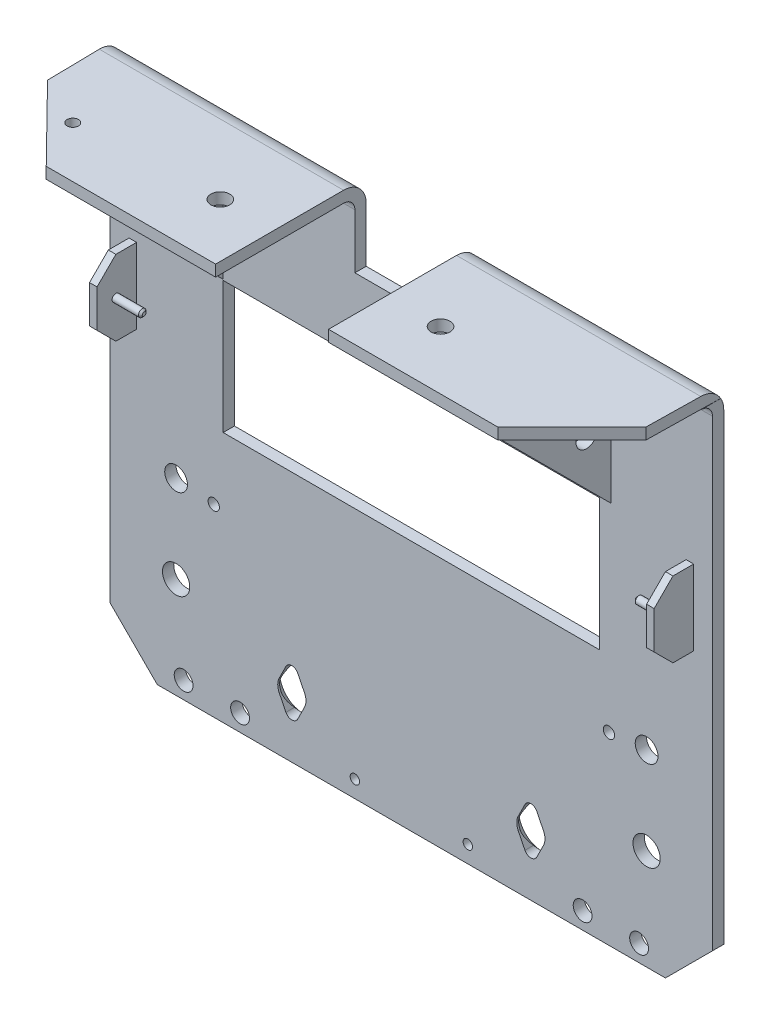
ISO-10303-21;
HEADER;
FILE_DESCRIPTION(('STEP AP214'),'2;1');
FILE_NAME('part.step','',(''),(''),'','','');
FILE_SCHEMA(('AUTOMOTIVE_DESIGN { 1 0 10303 214 1 1 1 1 }'));
ENDSEC;
DATA;
#1=APPLICATION_CONTEXT('core data for automotive mechanical design processes');
#2=APPLICATION_PROTOCOL_DEFINITION('international standard','automotive_design',2000,#1);
#3=PRODUCT_CONTEXT('',#1,'mechanical');
#4=PRODUCT('Part','Part','',(#3));
#5=PRODUCT_RELATED_PRODUCT_CATEGORY('part','',(#4));
#6=PRODUCT_DEFINITION_FORMATION('','',#4);
#7=PRODUCT_DEFINITION_CONTEXT('part definition',#1,'design');
#8=PRODUCT_DEFINITION('design','',#6,#7);
#9=PRODUCT_DEFINITION_SHAPE('','',#8);
#10=(LENGTH_UNIT() NAMED_UNIT(*) SI_UNIT(.MILLI.,.METRE.));
#11=(NAMED_UNIT(*) PLANE_ANGLE_UNIT() SI_UNIT($,.RADIAN.));
#12=(NAMED_UNIT(*) SI_UNIT($,.STERADIAN.) SOLID_ANGLE_UNIT());
#13=UNCERTAINTY_MEASURE_WITH_UNIT(LENGTH_MEASURE(1.E-05),#10,'distance_accuracy_value','');
#14=(GEOMETRIC_REPRESENTATION_CONTEXT(3) GLOBAL_UNCERTAINTY_ASSIGNED_CONTEXT((#13)) GLOBAL_UNIT_ASSIGNED_CONTEXT((#10,
#11,#12)) REPRESENTATION_CONTEXT('',''));
#15=CARTESIAN_POINT('',(0.,0.,0.));
#16=DIRECTION('',(0.,0.,1.));
#17=DIRECTION('',(1.,0.,0.));
#18=AXIS2_PLACEMENT_3D('',#15,#16,#17);
#19=CARTESIAN_POINT('',(132.,-105.,17.));
#20=DIRECTION('',(1.,0.,0.));
#21=DIRECTION('',(0.,0.,1.));
#22=AXIS2_PLACEMENT_3D('',#19,#20,#21);
#23=CONICAL_SURFACE('',#22,2.,0.785398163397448);
#24=CARTESIAN_POINT('',(131.,-105.,17.));
#25=DIRECTION('',(-1.,0.,0.));
#26=DIRECTION('',(0.,0.,1.));
#27=AXIS2_PLACEMENT_3D('',#24,#25,#26);
#28=CIRCLE('',#27,1.);
#29=CARTESIAN_POINT('',(131.,-105.,18.));
#30=VERTEX_POINT('',#29);
#31=EDGE_CURVE('E23',#30,#30,#28,.F.);
#32=ORIENTED_EDGE('',*,*,#31,.T.);
#33=EDGE_LOOP('',(#32));
#34=FACE_BOUND('',#33,.T.);
#35=CARTESIAN_POINT('',(132.,-105.,17.));
#36=DIRECTION('',(-1.,0.,0.));
#37=DIRECTION('',(0.,0.,1.));
#38=AXIS2_PLACEMENT_3D('',#35,#36,#37);
#39=CIRCLE('',#38,2.);
#40=CARTESIAN_POINT('',(132.,-105.,19.));
#41=VERTEX_POINT('',#40);
#42=EDGE_CURVE('E11',#41,#41,#39,.T.);
#43=ORIENTED_EDGE('',*,*,#42,.T.);
#44=EDGE_LOOP('',(#43));
#45=FACE_BOUND('',#44,.T.);
#46=ADVANCED_FACE('F16',(#34,#45),#23,.T.);
#47=CARTESIAN_POINT('',(150.,-95.,27.));
#48=DIRECTION('',(0.,0.707106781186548,0.707106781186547));
#49=DIRECTION('',(0.,-0.707106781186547,0.707106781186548));
#50=AXIS2_PLACEMENT_3D('',#47,#48,#49);
#51=PLANE('',#50);
#52=DIRECTION('',(0.,-0.707106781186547,0.707106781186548));
#53=VECTOR('',#52,1.);
#54=CARTESIAN_POINT('',(146.,-95.,27.));
#55=LINE('',#54,#53);
#56=CARTESIAN_POINT('',(146.,-85.,17.));
#57=VERTEX_POINT('',#56);
#58=CARTESIAN_POINT('',(146.,-95.,27.));
#59=VERTEX_POINT('',#58);
#60=EDGE_CURVE('E872',#57,#59,#55,.T.);
#61=ORIENTED_EDGE('',*,*,#60,.T.);
#62=DIRECTION('',(1.,0.,0.));
#63=VECTOR('',#62,1.);
#64=CARTESIAN_POINT('',(150.,-95.,27.));
#65=LINE('',#64,#63);
#66=CARTESIAN_POINT('',(150.,-95.,27.));
#67=VERTEX_POINT('',#66);
#68=EDGE_CURVE('E874',#59,#67,#65,.T.);
#69=ORIENTED_EDGE('',*,*,#68,.T.);
#70=DIRECTION('',(0.,0.707106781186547,-0.707106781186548));
#71=VECTOR('',#70,1.);
#72=CARTESIAN_POINT('',(150.,-95.,27.));
#73=LINE('',#72,#71);
#74=CARTESIAN_POINT('',(150.,-85.,17.));
#75=VERTEX_POINT('',#74);
#76=EDGE_CURVE('E929',#67,#75,#73,.T.);
#77=ORIENTED_EDGE('',*,*,#76,.T.);
#78=DIRECTION('',(-1.,0.,0.));
#79=VECTOR('',#78,1.);
#80=CARTESIAN_POINT('',(146.,-85.,17.));
#81=LINE('',#80,#79);
#82=EDGE_CURVE('E877',#75,#57,#81,.T.);
#83=ORIENTED_EDGE('',*,*,#82,.T.);
#84=EDGE_LOOP('',(#61,#69,#77,#83));
#85=FACE_BOUND('',#84,.T.);
#86=ADVANCED_FACE('F860',(#85),#51,.T.);
#87=CARTESIAN_POINT('',(150.,-115.,27.));
#88=DIRECTION('',(0.,-0.707106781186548,0.707106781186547));
#89=DIRECTION('',(0.,-0.707106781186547,-0.707106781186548));
#90=AXIS2_PLACEMENT_3D('',#87,#88,#89);
#91=PLANE('',#90);
#92=DIRECTION('',(0.,0.707106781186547,0.707106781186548));
#93=VECTOR('',#92,1.);
#94=CARTESIAN_POINT('',(150.,-115.,27.));
#95=LINE('',#94,#93);
#96=CARTESIAN_POINT('',(150.,-125.,17.));
#97=VERTEX_POINT('',#96);
#98=CARTESIAN_POINT('',(150.,-115.,27.));
#99=VERTEX_POINT('',#98);
#100=EDGE_CURVE('E37',#97,#99,#95,.T.);
#101=ORIENTED_EDGE('',*,*,#100,.T.);
#102=DIRECTION('',(-1.,0.,0.));
#103=VECTOR('',#102,1.);
#104=CARTESIAN_POINT('',(146.,-115.,27.));
#105=LINE('',#104,#103);
#106=CARTESIAN_POINT('',(146.,-115.,27.));
#107=VERTEX_POINT('',#106);
#108=EDGE_CURVE('E901',#99,#107,#105,.T.);
#109=ORIENTED_EDGE('',*,*,#108,.T.);
#110=DIRECTION('',(0.,-0.707106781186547,-0.707106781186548));
#111=VECTOR('',#110,1.);
#112=CARTESIAN_POINT('',(146.,-115.,27.));
#113=LINE('',#112,#111);
#114=CARTESIAN_POINT('',(146.,-125.,17.));
#115=VERTEX_POINT('',#114);
#116=EDGE_CURVE('E882',#107,#115,#113,.T.);
#117=ORIENTED_EDGE('',*,*,#116,.T.);
#118=DIRECTION('',(1.,0.,0.));
#119=VECTOR('',#118,1.);
#120=CARTESIAN_POINT('',(150.,-125.,17.));
#121=LINE('',#120,#119);
#122=EDGE_CURVE('E922',#115,#97,#121,.T.);
#123=ORIENTED_EDGE('',*,*,#122,.T.);
#124=EDGE_LOOP('',(#101,#109,#117,#123));
#125=FACE_BOUND('',#124,.T.);
#126=ADVANCED_FACE('F857',(#125),#91,.T.);
#127=CARTESIAN_POINT('',(131.,-105.,17.));
#128=DIRECTION('',(1.,0.,0.));
#129=DIRECTION('',(0.,0.,1.));
#130=AXIS2_PLACEMENT_3D('',#127,#128,#129);
#131=CYLINDRICAL_SURFACE('',#130,2.);
#132=ORIENTED_EDGE('',*,*,#42,.F.);
#133=EDGE_LOOP('',(#132));
#134=FACE_BOUND('',#133,.T.);
#135=CARTESIAN_POINT('',(146.,-105.,17.));
#136=DIRECTION('',(-1.,0.,0.));
#137=DIRECTION('',(0.,1.,0.));
#138=AXIS2_PLACEMENT_3D('',#135,#136,#137);
#139=CIRCLE('',#138,2.);
#140=CARTESIAN_POINT('',(146.,-103.,17.));
#141=VERTEX_POINT('',#140);
#142=EDGE_CURVE('E883',#141,#141,#139,.T.);
#143=ORIENTED_EDGE('',*,*,#142,.T.);
#144=EDGE_LOOP('',(#143));
#145=FACE_BOUND('',#144,.T.);
#146=ADVANCED_FACE('F853',(#134,#145),#131,.T.);
#147=CARTESIAN_POINT('',(131.,-105.,17.));
#148=DIRECTION('',(1.,0.,0.));
#149=DIRECTION('',(0.,0.,1.));
#150=AXIS2_PLACEMENT_3D('',#147,#148,#149);
#151=PLANE('',#150);
#152=ORIENTED_EDGE('',*,*,#31,.F.);
#153=EDGE_LOOP('',(#152));
#154=FACE_BOUND('',#153,.T.);
#155=ADVANCED_FACE('F850',(#154),#151,.F.);
#156=CARTESIAN_POINT('',(150.,-85.,27.));
#157=DIRECTION('',(-1.,0.,0.));
#158=DIRECTION('',(0.,0.,-1.));
#159=AXIS2_PLACEMENT_3D('',#156,#157,#158);
#160=PLANE('',#159);
#161=DIRECTION('',(0.,-1.,0.));
#162=VECTOR('',#161,1.);
#163=CARTESIAN_POINT('',(150.,-85.,27.));
#164=LINE('',#163,#162);
#165=EDGE_CURVE('E888',#67,#99,#164,.T.);
#166=ORIENTED_EDGE('',*,*,#165,.T.);
#167=ORIENTED_EDGE('',*,*,#100,.F.);
#168=DIRECTION('',(0.,0.,-1.));
#169=VECTOR('',#168,1.);
#170=CARTESIAN_POINT('',(150.,-125.,27.));
#171=LINE('',#170,#169);
#172=CARTESIAN_POINT('',(150.,-125.,6.));
#173=VERTEX_POINT('',#172);
#174=EDGE_CURVE('E924',#97,#173,#171,.T.);
#175=ORIENTED_EDGE('',*,*,#174,.T.);
#176=DIRECTION('',(0.,-1.,0.));
#177=VECTOR('',#176,1.);
#178=CARTESIAN_POINT('',(150.,-85.,6.));
#179=LINE('',#178,#177);
#180=CARTESIAN_POINT('',(150.,-85.,6.));
#181=VERTEX_POINT('',#180);
#182=EDGE_CURVE('E30',#181,#173,#179,.T.);
#183=ORIENTED_EDGE('',*,*,#182,.F.);
#184=DIRECTION('',(0.,0.,-1.));
#185=VECTOR('',#184,1.);
#186=CARTESIAN_POINT('',(150.,-85.,27.));
#187=LINE('',#186,#185);
#188=EDGE_CURVE('E903',#75,#181,#187,.T.);
#189=ORIENTED_EDGE('',*,*,#188,.F.);
#190=ORIENTED_EDGE('',*,*,#76,.F.);
#191=EDGE_LOOP('',(#166,#167,#175,#183,#189,#190));
#192=FACE_BOUND('',#191,.T.);
#193=ADVANCED_FACE('F846',(#192),#160,.F.);
#194=CARTESIAN_POINT('',(150.,-125.,27.));
#195=DIRECTION('',(0.,1.,0.));
#196=DIRECTION('',(0.,0.,1.));
#197=AXIS2_PLACEMENT_3D('',#194,#195,#196);
#198=PLANE('',#197);
#199=DIRECTION('',(0.,0.,-1.));
#200=VECTOR('',#199,1.);
#201=CARTESIAN_POINT('',(146.,-125.,27.));
#202=LINE('',#201,#200);
#203=CARTESIAN_POINT('',(146.,-125.,6.));
#204=VERTEX_POINT('',#203);
#205=EDGE_CURVE('E916',#115,#204,#202,.T.);
#206=ORIENTED_EDGE('',*,*,#205,.T.);
#207=DIRECTION('',(-1.,0.,0.));
#208=VECTOR('',#207,1.);
#209=CARTESIAN_POINT('',(150.,-125.,6.));
#210=LINE('',#209,#208);
#211=EDGE_CURVE('E926',#173,#204,#210,.T.);
#212=ORIENTED_EDGE('',*,*,#211,.F.);
#213=ORIENTED_EDGE('',*,*,#174,.F.);
#214=ORIENTED_EDGE('',*,*,#122,.F.);
#215=EDGE_LOOP('',(#206,#212,#213,#214));
#216=FACE_BOUND('',#215,.T.);
#217=ADVANCED_FACE('F842',(#216),#198,.F.);
#218=CARTESIAN_POINT('',(146.,-125.,27.));
#219=DIRECTION('',(1.,0.,0.));
#220=DIRECTION('',(0.,0.,1.));
#221=AXIS2_PLACEMENT_3D('',#218,#219,#220);
#222=PLANE('',#221);
#223=ORIENTED_EDGE('',*,*,#142,.F.);
#224=EDGE_LOOP('',(#223));
#225=FACE_BOUND('',#224,.T.);
#226=DIRECTION('',(0.,0.,-1.));
#227=VECTOR('',#226,1.);
#228=CARTESIAN_POINT('',(146.,-85.,27.));
#229=LINE('',#228,#227);
#230=CARTESIAN_POINT('',(146.,-85.,6.));
#231=VERTEX_POINT('',#230);
#232=EDGE_CURVE('E907',#57,#231,#229,.T.);
#233=ORIENTED_EDGE('',*,*,#232,.T.);
#234=DIRECTION('',(0.,1.,0.));
#235=VECTOR('',#234,1.);
#236=CARTESIAN_POINT('',(146.,-125.,6.));
#237=LINE('',#236,#235);
#238=EDGE_CURVE('E919',#204,#231,#237,.T.);
#239=ORIENTED_EDGE('',*,*,#238,.F.);
#240=ORIENTED_EDGE('',*,*,#205,.F.);
#241=ORIENTED_EDGE('',*,*,#116,.F.);
#242=DIRECTION('',(0.,1.,0.));
#243=VECTOR('',#242,1.);
#244=CARTESIAN_POINT('',(146.,-125.,27.));
#245=LINE('',#244,#243);
#246=EDGE_CURVE('E887',#107,#59,#245,.T.);
#247=ORIENTED_EDGE('',*,*,#246,.T.);
#248=ORIENTED_EDGE('',*,*,#60,.F.);
#249=EDGE_LOOP('',(#233,#239,#240,#241,#247,#248));
#250=FACE_BOUND('',#249,.T.);
#251=ADVANCED_FACE('F838',(#225,#250),#222,.F.);
#252=CARTESIAN_POINT('',(146.,-85.,27.));
#253=DIRECTION('',(0.,-1.,0.));
#254=DIRECTION('',(0.,0.,-1.));
#255=AXIS2_PLACEMENT_3D('',#252,#253,#254);
#256=PLANE('',#255);
#257=ORIENTED_EDGE('',*,*,#188,.T.);
#258=DIRECTION('',(1.,0.,0.));
#259=VECTOR('',#258,1.);
#260=CARTESIAN_POINT('',(146.,-85.,6.));
#261=LINE('',#260,#259);
#262=EDGE_CURVE('E909',#231,#181,#261,.T.);
#263=ORIENTED_EDGE('',*,*,#262,.F.);
#264=ORIENTED_EDGE('',*,*,#232,.F.);
#265=ORIENTED_EDGE('',*,*,#82,.F.);
#266=EDGE_LOOP('',(#257,#263,#264,#265));
#267=FACE_BOUND('',#266,.T.);
#268=ADVANCED_FACE('F834',(#267),#256,.F.);
#269=CARTESIAN_POINT('',(150.,-125.,27.));
#270=DIRECTION('',(0.,0.,1.));
#271=DIRECTION('',(0.,-1.,0.));
#272=AXIS2_PLACEMENT_3D('',#269,#270,#271);
#273=PLANE('',#272);
#274=ORIENTED_EDGE('',*,*,#246,.F.);
#275=ORIENTED_EDGE('',*,*,#108,.F.);
#276=ORIENTED_EDGE('',*,*,#165,.F.);
#277=ORIENTED_EDGE('',*,*,#68,.F.);
#278=EDGE_LOOP('',(#274,#275,#276,#277));
#279=FACE_BOUND('',#278,.T.);
#280=ADVANCED_FACE('F775',(#279),#273,.T.);
#281=CARTESIAN_POINT('',(160.,-12.,6.));
#282=DIRECTION('',(0.,0.,-1.));
#283=DIRECTION('',(0.,1.,0.));
#284=AXIS2_PLACEMENT_3D('',#281,#282,#283);
#285=PLANE('',#284);
#286=ORIENTED_EDGE('',*,*,#182,.T.);
#287=ORIENTED_EDGE('',*,*,#211,.T.);
#288=ORIENTED_EDGE('',*,*,#238,.T.);
#289=ORIENTED_EDGE('',*,*,#262,.T.);
#290=EDGE_LOOP('',(#286,#287,#288,#289));
#291=FACE_BOUND('',#290,.T.);
#292=CARTESIAN_POINT('',(105.,-185.,6.));
#293=DIRECTION('',(0.,0.,1.));
#294=DIRECTION('',(0.,-1.,0.));
#295=AXIS2_PLACEMENT_3D('',#292,#293,#294);
#296=CIRCLE('',#295,3.);
#297=CARTESIAN_POINT('',(105.,-188.,6.));
#298=VERTEX_POINT('',#297);
#299=EDGE_CURVE('E948',#298,#298,#296,.T.);
#300=ORIENTED_EDGE('',*,*,#299,.F.);
#301=EDGE_LOOP('',(#300));
#302=FACE_BOUND('',#301,.T.);
#303=CARTESIAN_POINT('',(-63.5,-251.,6.));
#304=DIRECTION('',(0.,0.,1.));
#305=DIRECTION('',(0.,-1.,0.));
#306=AXIS2_PLACEMENT_3D('',#303,#304,#305);
#307=CIRCLE('',#306,7.5);
#308=CARTESIAN_POINT('',(-56.7814518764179,-254.333333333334,6.));
#309=VERTEX_POINT('',#308);
#310=CARTESIAN_POINT('',(-56.7814518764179,-247.666666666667,6.00000000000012));
#311=VERTEX_POINT('',#310);
#312=EDGE_CURVE('E954',#309,#311,#307,.T.);
#313=ORIENTED_EDGE('',*,*,#312,.F.);
#314=DIRECTION('',(0.444444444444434,0.895806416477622,0.));
#315=VECTOR('',#314,1.);
#316=CARTESIAN_POINT('',(-56.7814518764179,-254.333333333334,6.));
#317=LINE('',#316,#315);
#318=CARTESIAN_POINT('',(-60.3646775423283,-261.555555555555,6.));
#319=VERTEX_POINT('',#318);
#320=EDGE_CURVE('E1134',#319,#309,#317,.T.);
#321=ORIENTED_EDGE('',*,*,#320,.F.);
#322=CARTESIAN_POINT('',(-63.5,-260.,6.));
#323=DIRECTION('',(0.,0.,1.));
#324=DIRECTION('',(0.,-1.,0.));
#325=AXIS2_PLACEMENT_3D('',#322,#323,#324);
#326=CIRCLE('',#325,3.50000000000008);
#327=CARTESIAN_POINT('',(-66.6353224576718,-261.555555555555,6.00000000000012));
#328=VERTEX_POINT('',#327);
#329=EDGE_CURVE('E1092',#328,#319,#326,.T.);
#330=ORIENTED_EDGE('',*,*,#329,.F.);
#331=DIRECTION('',(0.444444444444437,-0.89580641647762,0.));
#332=VECTOR('',#331,1.);
#333=CARTESIAN_POINT('',(-70.2185481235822,-254.333333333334,6.));
#334=LINE('',#333,#332);
#335=CARTESIAN_POINT('',(-70.2185481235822,-254.333333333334,6.00000000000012));
#336=VERTEX_POINT('',#335);
#337=EDGE_CURVE('E1094',#336,#328,#334,.T.);
#338=ORIENTED_EDGE('',*,*,#337,.F.);
#339=CARTESIAN_POINT('',(-63.5,-251.,6.));
#340=DIRECTION('',(0.,0.,1.));
#341=DIRECTION('',(0.,-1.,0.));
#342=AXIS2_PLACEMENT_3D('',#339,#340,#341);
#343=CIRCLE('',#342,7.5);
#344=CARTESIAN_POINT('',(-70.2185481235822,-247.666666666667,6.00000000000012));
#345=VERTEX_POINT('',#344);
#346=EDGE_CURVE('E1097',#345,#336,#343,.T.);
#347=ORIENTED_EDGE('',*,*,#346,.F.);
#348=DIRECTION('',(-0.444444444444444,-0.895806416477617,0.));
#349=VECTOR('',#348,1.);
#350=CARTESIAN_POINT('',(-70.2185481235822,-247.666666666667,6.));
#351=LINE('',#350,#349);
#352=CARTESIAN_POINT('',(-66.6353224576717,-240.444444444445,6.00000000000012));
#353=VERTEX_POINT('',#352);
#354=EDGE_CURVE('E1100',#353,#345,#351,.T.);
#355=ORIENTED_EDGE('',*,*,#354,.F.);
#356=CARTESIAN_POINT('',(-63.5,-242.,6.));
#357=DIRECTION('',(0.,0.,1.));
#358=DIRECTION('',(0.,-1.,0.));
#359=AXIS2_PLACEMENT_3D('',#356,#357,#358);
#360=CIRCLE('',#359,3.50000000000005);
#361=CARTESIAN_POINT('',(-60.3646775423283,-240.444444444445,6.00000000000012));
#362=VERTEX_POINT('',#361);
#363=EDGE_CURVE('E1103',#362,#353,#360,.T.);
#364=ORIENTED_EDGE('',*,*,#363,.F.);
#365=DIRECTION('',(-0.444444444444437,0.895806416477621,0.));
#366=VECTOR('',#365,1.);
#367=CARTESIAN_POINT('',(-56.7814518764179,-247.666666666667,6.));
#368=LINE('',#367,#366);
#369=EDGE_CURVE('E1106',#311,#362,#368,.T.);
#370=ORIENTED_EDGE('',*,*,#369,.F.);
#371=EDGE_LOOP('',(#313,#321,#330,#338,#347,#355,#364,#370));
#372=FACE_BOUND('',#371,.T.);
#373=CARTESIAN_POINT('',(91.,-274.,6.));
#374=DIRECTION('',(0.,0.,1.));
#375=DIRECTION('',(0.,-1.,0.));
#376=AXIS2_PLACEMENT_3D('',#373,#374,#375);
#377=CIRCLE('',#376,5.);
#378=CARTESIAN_POINT('',(91.,-279.,6.));
#379=VERTEX_POINT('',#378);
#380=EDGE_CURVE('E958',#379,#379,#377,.T.);
#381=ORIENTED_EDGE('',*,*,#380,.F.);
#382=EDGE_LOOP('',(#381));
#383=FACE_BOUND('',#382,.T.);
#384=CARTESIAN_POINT('',(-121.,-274.,6.));
#385=DIRECTION('',(0.,0.,1.));
#386=DIRECTION('',(0.,-1.,0.));
#387=AXIS2_PLACEMENT_3D('',#384,#385,#386);
#388=CIRCLE('',#387,5.);
#389=CARTESIAN_POINT('',(-121.,-279.,6.));
#390=VERTEX_POINT('',#389);
#391=EDGE_CURVE('E962',#390,#390,#388,.T.);
#392=ORIENTED_EDGE('',*,*,#391,.F.);
#393=EDGE_LOOP('',(#392));
#394=FACE_BOUND('',#393,.T.);
#395=CARTESIAN_POINT('',(-125.,-229.5,6.));
#396=DIRECTION('',(0.,0.,1.));
#397=DIRECTION('',(0.,-1.,0.));
#398=AXIS2_PLACEMENT_3D('',#395,#396,#397);
#399=CIRCLE('',#398,7.25);
#400=CARTESIAN_POINT('',(-125.,-236.75,6.));
#401=VERTEX_POINT('',#400);
#402=EDGE_CURVE('E966',#401,#401,#399,.T.);
#403=ORIENTED_EDGE('',*,*,#402,.F.);
#404=EDGE_LOOP('',(#403));
#405=FACE_BOUND('',#404,.T.);
#406=CARTESIAN_POINT('',(125.,-183.,6.));
#407=DIRECTION('',(0.,0.,1.));
#408=DIRECTION('',(0.,-1.,0.));
#409=AXIS2_PLACEMENT_3D('',#406,#407,#408);
#410=CIRCLE('',#409,6.05);
#411=CARTESIAN_POINT('',(125.,-189.05,6.));
#412=VERTEX_POINT('',#411);
#413=EDGE_CURVE('E970',#412,#412,#410,.T.);
#414=ORIENTED_EDGE('',*,*,#413,.F.);
#415=EDGE_LOOP('',(#414));
#416=FACE_BOUND('',#415,.T.);
#417=CARTESIAN_POINT('',(-125.,-21.,6.));
#418=DIRECTION('',(0.,0.,1.));
#419=DIRECTION('',(0.,-1.,0.));
#420=AXIS2_PLACEMENT_3D('',#417,#418,#419);
#421=CIRCLE('',#420,7.25);
#422=CARTESIAN_POINT('',(-125.,-28.25,6.));
#423=VERTEX_POINT('',#422);
#424=EDGE_CURVE('E974',#423,#423,#421,.T.);
#425=ORIENTED_EDGE('',*,*,#424,.F.);
#426=EDGE_LOOP('',(#425));
#427=FACE_BOUND('',#426,.T.);
#428=DIRECTION('',(0.,1.,0.));
#429=VECTOR('',#428,1.);
#430=CARTESIAN_POINT('',(106.,-22.4314575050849,6.));
#431=LINE('',#430,#429);
#432=CARTESIAN_POINT('',(106.,-79.,6.));
#433=VERTEX_POINT('',#432);
#434=CARTESIAN_POINT('',(106.,-22.4314575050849,6.));
#435=VERTEX_POINT('',#434);
#436=EDGE_CURVE('E977',#433,#435,#431,.T.);
#437=ORIENTED_EDGE('',*,*,#436,.F.);
#438=DIRECTION('',(-1.,0.,0.));
#439=VECTOR('',#438,1.);
#440=CARTESIAN_POINT('',(106.,-79.,6.));
#441=LINE('',#440,#439);
#442=CARTESIAN_POINT('',(100.,-79.,6.));
#443=VERTEX_POINT('',#442);
#444=EDGE_CURVE('E1381',#433,#443,#441,.T.);
#445=ORIENTED_EDGE('',*,*,#444,.T.);
#446=DIRECTION('',(0.,1.,0.));
#447=VECTOR('',#446,1.);
#448=CARTESIAN_POINT('',(100.,-22.4314575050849,6.));
#449=LINE('',#448,#447);
#450=CARTESIAN_POINT('',(100.,-22.4314575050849,6.));
#451=VERTEX_POINT('',#450);
#452=EDGE_CURVE('E1358',#443,#451,#449,.T.);
#453=ORIENTED_EDGE('',*,*,#452,.T.);
#454=DIRECTION('',(-1.,0.,0.));
#455=VECTOR('',#454,1.);
#456=CARTESIAN_POINT('',(106.,-22.4314575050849,6.));
#457=LINE('',#456,#455);
#458=EDGE_CURVE('E1378',#435,#451,#457,.T.);
#459=ORIENTED_EDGE('',*,*,#458,.F.);
#460=EDGE_LOOP('',(#437,#445,#453,#459));
#461=FACE_BOUND('',#460,.T.);
#462=DIRECTION('',(0.,1.,0.));
#463=VECTOR('',#462,1.);
#464=CARTESIAN_POINT('',(-106.,-22.4314575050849,6.));
#465=LINE('',#464,#463);
#466=CARTESIAN_POINT('',(-106.,-79.,6.));
#467=VERTEX_POINT('',#466);
#468=CARTESIAN_POINT('',(-106.,-22.4314575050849,6.));
#469=VERTEX_POINT('',#468);
#470=EDGE_CURVE('E982',#467,#469,#465,.T.);
#471=ORIENTED_EDGE('',*,*,#470,.T.);
#472=DIRECTION('',(1.,0.,0.));
#473=VECTOR('',#472,1.);
#474=CARTESIAN_POINT('',(-106.,-22.4314575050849,6.));
#475=LINE('',#474,#473);
#476=CARTESIAN_POINT('',(-100.,-22.4314575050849,6.));
#477=VERTEX_POINT('',#476);
#478=EDGE_CURVE('E1483',#469,#477,#475,.T.);
#479=ORIENTED_EDGE('',*,*,#478,.T.);
#480=DIRECTION('',(0.,1.,0.));
#481=VECTOR('',#480,1.);
#482=CARTESIAN_POINT('',(-100.,-22.4314575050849,6.));
#483=LINE('',#482,#481);
#484=CARTESIAN_POINT('',(-100.,-79.,6.));
#485=VERTEX_POINT('',#484);
#486=EDGE_CURVE('E1471',#485,#477,#483,.T.);
#487=ORIENTED_EDGE('',*,*,#486,.F.);
#488=DIRECTION('',(1.,0.,0.));
#489=VECTOR('',#488,1.);
#490=CARTESIAN_POINT('',(-106.,-79.,6.));
#491=LINE('',#490,#489);
#492=EDGE_CURVE('E1477',#467,#485,#491,.T.);
#493=ORIENTED_EDGE('',*,*,#492,.F.);
#494=EDGE_LOOP('',(#471,#479,#487,#493));
#495=FACE_BOUND('',#494,.T.);
#496=DIRECTION('',(1.,0.,0.));
#497=VECTOR('',#496,1.);
#498=CARTESIAN_POINT('',(100.,-79.5,6.));
#499=LINE('',#498,#497);
#500=CARTESIAN_POINT('',(-100.,-79.5,6.));
#501=VERTEX_POINT('',#500);
#502=CARTESIAN_POINT('',(100.,-79.5,6.));
#503=VERTEX_POINT('',#502);
#504=EDGE_CURVE('E988',#501,#503,#499,.T.);
#505=ORIENTED_EDGE('',*,*,#504,.T.);
#506=DIRECTION('',(0.,-1.,0.));
#507=VECTOR('',#506,1.);
#508=CARTESIAN_POINT('',(100.,-149.5,6.));
#509=LINE('',#508,#507);
#510=CARTESIAN_POINT('',(100.,-149.5,6.));
#511=VERTEX_POINT('',#510);
#512=EDGE_CURVE('E1201',#503,#511,#509,.T.);
#513=ORIENTED_EDGE('',*,*,#512,.T.);
#514=DIRECTION('',(-1.,0.,0.));
#515=VECTOR('',#514,1.);
#516=CARTESIAN_POINT('',(100.,-149.5,6.));
#517=LINE('',#516,#515);
#518=CARTESIAN_POINT('',(-100.,-149.5,6.));
#519=VERTEX_POINT('',#518);
#520=EDGE_CURVE('E1198',#511,#519,#517,.T.);
#521=ORIENTED_EDGE('',*,*,#520,.T.);
#522=DIRECTION('',(0.,1.,0.));
#523=VECTOR('',#522,1.);
#524=CARTESIAN_POINT('',(-100.,-149.5,6.));
#525=LINE('',#524,#523);
#526=EDGE_CURVE('E1196',#519,#501,#525,.T.);
#527=ORIENTED_EDGE('',*,*,#526,.T.);
#528=EDGE_LOOP('',(#505,#513,#521,#527));
#529=FACE_BOUND('',#528,.T.);
#530=DIRECTION('',(-0.707106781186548,-0.707106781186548,0.));
#531=VECTOR('',#530,1.);
#532=CARTESIAN_POINT('',(160.,-258.,6.));
#533=LINE('',#532,#531);
#534=CARTESIAN_POINT('',(160.,-258.,6.));
#535=VERTEX_POINT('',#534);
#536=CARTESIAN_POINT('',(135.,-283.,6.00000000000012));
#537=VERTEX_POINT('',#536);
#538=EDGE_CURVE('E993',#535,#537,#533,.T.);
#539=ORIENTED_EDGE('',*,*,#538,.F.);
#540=DIRECTION('',(0.,-1.,0.));
#541=VECTOR('',#540,1.);
#542=CARTESIAN_POINT('',(160.,-12.,6.));
#543=LINE('',#542,#541);
#544=CARTESIAN_POINT('',(160.,-12.,6.));
#545=VERTEX_POINT('',#544);
#546=EDGE_CURVE('E1406',#545,#535,#543,.T.);
#547=ORIENTED_EDGE('',*,*,#546,.F.);
#548=DIRECTION('',(-1.,0.,0.));
#549=VECTOR('',#548,1.);
#550=CARTESIAN_POINT('',(160.,-12.,6.));
#551=LINE('',#550,#549);
#552=CARTESIAN_POINT('',(30.,-12.,6.));
#553=VERTEX_POINT('',#552);
#554=EDGE_CURVE('E1411',#545,#553,#551,.T.);
#555=ORIENTED_EDGE('',*,*,#554,.T.);
#556=DIRECTION('',(0.,-1.,0.));
#557=VECTOR('',#556,1.);
#558=CARTESIAN_POINT('',(30.,-12.,6.));
#559=LINE('',#558,#557);
#560=CARTESIAN_POINT('',(30.,-41.,6.));
#561=VERTEX_POINT('',#560);
#562=EDGE_CURVE('E1245',#553,#561,#559,.T.);
#563=ORIENTED_EDGE('',*,*,#562,.T.);
#564=DIRECTION('',(-1.,0.,0.));
#565=VECTOR('',#564,1.);
#566=CARTESIAN_POINT('',(160.,-41.,6.));
#567=LINE('',#566,#565);
#568=CARTESIAN_POINT('',(-30.,-41.,6.));
#569=VERTEX_POINT('',#568);
#570=EDGE_CURVE('E1239',#561,#569,#567,.T.);
#571=ORIENTED_EDGE('',*,*,#570,.T.);
#572=DIRECTION('',(0.,1.,0.));
#573=VECTOR('',#572,1.);
#574=CARTESIAN_POINT('',(-30.,-12.,6.));
#575=LINE('',#574,#573);
#576=CARTESIAN_POINT('',(-30.,-12.,6.));
#577=VERTEX_POINT('',#576);
#578=EDGE_CURVE('E1250',#569,#577,#575,.T.);
#579=ORIENTED_EDGE('',*,*,#578,.T.);
#580=CARTESIAN_POINT('',(-160.,-12.,6.));
#581=VERTEX_POINT('',#580);
#582=EDGE_CURVE('E1410',#577,#581,#551,.T.);
#583=ORIENTED_EDGE('',*,*,#582,.T.);
#584=DIRECTION('',(0.,-1.,0.));
#585=VECTOR('',#584,1.);
#586=CARTESIAN_POINT('',(-160.,-12.,6.));
#587=LINE('',#586,#585);
#588=CARTESIAN_POINT('',(-160.,-258.,6.));
#589=VERTEX_POINT('',#588);
#590=EDGE_CURVE('E1395',#581,#589,#587,.T.);
#591=ORIENTED_EDGE('',*,*,#590,.T.);
#592=DIRECTION('',(0.707106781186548,-0.707106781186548,0.));
#593=VECTOR('',#592,1.);
#594=CARTESIAN_POINT('',(-160.,-258.,6.));
#595=LINE('',#594,#593);
#596=CARTESIAN_POINT('',(-135.,-283.,6.));
#597=VERTEX_POINT('',#596);
#598=EDGE_CURVE('E1185',#589,#597,#595,.T.);
#599=ORIENTED_EDGE('',*,*,#598,.T.);
#600=DIRECTION('',(-1.,0.,0.));
#601=VECTOR('',#600,1.);
#602=CARTESIAN_POINT('',(160.,-283.,6.));
#603=LINE('',#602,#601);
#604=EDGE_CURVE('E1408',#537,#597,#603,.T.);
#605=ORIENTED_EDGE('',*,*,#604,.F.);
#606=EDGE_LOOP('',(#539,#547,#555,#563,#571,#579,#583,#591,#599,#605));
#607=FACE_BOUND('',#606,.T.);
#608=CARTESIAN_POINT('',(125.,-21.,6.));
#609=DIRECTION('',(0.,0.,1.));
#610=DIRECTION('',(0.,-1.,0.));
#611=AXIS2_PLACEMENT_3D('',#608,#609,#610);
#612=CIRCLE('',#611,7.25);
#613=CARTESIAN_POINT('',(125.,-28.25,6.));
#614=VERTEX_POINT('',#613);
#615=EDGE_CURVE('E998',#614,#614,#612,.T.);
#616=ORIENTED_EDGE('',*,*,#615,.F.);
#617=EDGE_LOOP('',(#616));
#618=FACE_BOUND('',#617,.T.);
#619=CARTESIAN_POINT('',(125.,-229.5,6.));
#620=DIRECTION('',(0.,0.,1.));
#621=DIRECTION('',(0.,-1.,0.));
#622=AXIS2_PLACEMENT_3D('',#619,#620,#621);
#623=CIRCLE('',#622,7.25);
#624=CARTESIAN_POINT('',(125.,-236.75,6.));
#625=VERTEX_POINT('',#624);
#626=EDGE_CURVE('E1002',#625,#625,#623,.T.);
#627=ORIENTED_EDGE('',*,*,#626,.F.);
#628=EDGE_LOOP('',(#627));
#629=FACE_BOUND('',#628,.T.);
#630=CARTESIAN_POINT('',(-125.,-183.,6.));
#631=DIRECTION('',(0.,0.,1.));
#632=DIRECTION('',(0.,-1.,0.));
#633=AXIS2_PLACEMENT_3D('',#630,#631,#632);
#634=CIRCLE('',#633,6.05);
#635=CARTESIAN_POINT('',(-125.,-189.05,6.));
#636=VERTEX_POINT('',#635);
#637=EDGE_CURVE('E1006',#636,#636,#634,.T.);
#638=ORIENTED_EDGE('',*,*,#637,.F.);
#639=EDGE_LOOP('',(#638));
#640=FACE_BOUND('',#639,.T.);
#641=CARTESIAN_POINT('',(-91.,-274.,6.));
#642=DIRECTION('',(0.,0.,1.));
#643=DIRECTION('',(0.,-1.,0.));
#644=AXIS2_PLACEMENT_3D('',#641,#642,#643);
#645=CIRCLE('',#644,5.);
#646=CARTESIAN_POINT('',(-91.,-279.,6.));
#647=VERTEX_POINT('',#646);
#648=EDGE_CURVE('E1010',#647,#647,#645,.T.);
#649=ORIENTED_EDGE('',*,*,#648,.F.);
#650=EDGE_LOOP('',(#649));
#651=FACE_BOUND('',#650,.T.);
#652=CARTESIAN_POINT('',(121.,-274.,6.));
#653=DIRECTION('',(0.,0.,1.));
#654=DIRECTION('',(0.,-1.,0.));
#655=AXIS2_PLACEMENT_3D('',#652,#653,#654);
#656=CIRCLE('',#655,5.);
#657=CARTESIAN_POINT('',(121.,-279.,6.));
#658=VERTEX_POINT('',#657);
#659=EDGE_CURVE('E1014',#658,#658,#656,.T.);
#660=ORIENTED_EDGE('',*,*,#659,.F.);
#661=EDGE_LOOP('',(#660));
#662=FACE_BOUND('',#661,.T.);
#663=CARTESIAN_POINT('',(63.5,-242.,6.));
#664=DIRECTION('',(0.,0.,1.));
#665=DIRECTION('',(0.,-1.,0.));
#666=AXIS2_PLACEMENT_3D('',#663,#664,#665);
#667=CIRCLE('',#666,3.50000000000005);
#668=CARTESIAN_POINT('',(60.3646775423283,-240.444444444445,6.));
#669=VERTEX_POINT('',#668);
#670=CARTESIAN_POINT('',(66.6353224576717,-240.444444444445,6.));
#671=VERTEX_POINT('',#670);
#672=EDGE_CURVE('E1019',#669,#671,#667,.F.);
#673=ORIENTED_EDGE('',*,*,#672,.T.);
#674=DIRECTION('',(0.444444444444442,-0.895806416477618,0.));
#675=VECTOR('',#674,1.);
#676=CARTESIAN_POINT('',(70.2185481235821,-247.666666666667,6.));
#677=LINE('',#676,#675);
#678=CARTESIAN_POINT('',(70.2185481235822,-247.666666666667,6.));
#679=VERTEX_POINT('',#678);
#680=EDGE_CURVE('E1065',#671,#679,#677,.T.);
#681=ORIENTED_EDGE('',*,*,#680,.T.);
#682=CARTESIAN_POINT('',(63.5,-251.,6.));
#683=DIRECTION('',(0.,0.,1.));
#684=DIRECTION('',(0.,-1.,0.));
#685=AXIS2_PLACEMENT_3D('',#682,#683,#684);
#686=CIRCLE('',#685,7.5);
#687=CARTESIAN_POINT('',(70.2185481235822,-254.333333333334,6.));
#688=VERTEX_POINT('',#687);
#689=EDGE_CURVE('E1062',#679,#688,#686,.F.);
#690=ORIENTED_EDGE('',*,*,#689,.T.);
#691=DIRECTION('',(-0.44444444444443,-0.895806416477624,0.));
#692=VECTOR('',#691,1.);
#693=CARTESIAN_POINT('',(70.2185481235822,-254.333333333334,6.));
#694=LINE('',#693,#692);
#695=CARTESIAN_POINT('',(66.6353224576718,-261.555555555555,6.));
#696=VERTEX_POINT('',#695);
#697=EDGE_CURVE('E1059',#688,#696,#694,.T.);
#698=ORIENTED_EDGE('',*,*,#697,.T.);
#699=CARTESIAN_POINT('',(63.5,-260.,6.));
#700=DIRECTION('',(0.,0.,1.));
#701=DIRECTION('',(0.,-1.,0.));
#702=AXIS2_PLACEMENT_3D('',#699,#700,#701);
#703=CIRCLE('',#702,3.5000000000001);
#704=CARTESIAN_POINT('',(60.3646775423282,-261.555555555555,6.));
#705=VERTEX_POINT('',#704);
#706=EDGE_CURVE('E1056',#696,#705,#703,.F.);
#707=ORIENTED_EDGE('',*,*,#706,.T.);
#708=DIRECTION('',(-0.444444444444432,0.895806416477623,0.));
#709=VECTOR('',#708,1.);
#710=CARTESIAN_POINT('',(56.7814518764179,-254.333333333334,6.));
#711=LINE('',#710,#709);
#712=CARTESIAN_POINT('',(56.7814518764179,-254.333333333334,6.));
#713=VERTEX_POINT('',#712);
#714=EDGE_CURVE('E1053',#705,#713,#711,.T.);
#715=ORIENTED_EDGE('',*,*,#714,.T.);
#716=CARTESIAN_POINT('',(63.5,-251.,6.));
#717=DIRECTION('',(0.,0.,1.));
#718=DIRECTION('',(0.,-1.,0.));
#719=AXIS2_PLACEMENT_3D('',#716,#717,#718);
#720=CIRCLE('',#719,7.5);
#721=CARTESIAN_POINT('',(56.7814518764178,-247.666666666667,6.));
#722=VERTEX_POINT('',#721);
#723=EDGE_CURVE('E1050',#713,#722,#720,.F.);
#724=ORIENTED_EDGE('',*,*,#723,.T.);
#725=DIRECTION('',(0.444444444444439,0.895806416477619,0.));
#726=VECTOR('',#725,1.);
#727=CARTESIAN_POINT('',(56.7814518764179,-247.666666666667,6.));
#728=LINE('',#727,#726);
#729=EDGE_CURVE('E1048',#722,#669,#728,.T.);
#730=ORIENTED_EDGE('',*,*,#729,.T.);
#731=EDGE_LOOP('',(#673,#681,#690,#698,#707,#715,#724,#730));
#732=FACE_BOUND('',#731,.T.);
#733=CARTESIAN_POINT('',(-105.,-185.,6.));
#734=DIRECTION('',(0.,0.,1.));
#735=DIRECTION('',(0.,-1.,0.));
#736=AXIS2_PLACEMENT_3D('',#733,#734,#735);
#737=CIRCLE('',#736,3.);
#738=CARTESIAN_POINT('',(-105.,-188.,6.));
#739=VERTEX_POINT('',#738);
#740=EDGE_CURVE('E1023',#739,#739,#737,.T.);
#741=ORIENTED_EDGE('',*,*,#740,.F.);
#742=EDGE_LOOP('',(#741));
#743=FACE_BOUND('',#742,.T.);
#744=CARTESIAN_POINT('',(-30.,-274.,6.));
#745=DIRECTION('',(0.,0.,-1.));
#746=DIRECTION('',(0.,1.,0.));
#747=AXIS2_PLACEMENT_3D('',#744,#745,#746);
#748=CIRCLE('',#747,2.5);
#749=CARTESIAN_POINT('',(-30.,-271.5,6.));
#750=VERTEX_POINT('',#749);
#751=EDGE_CURVE('E1027',#750,#750,#748,.T.);
#752=ORIENTED_EDGE('',*,*,#751,.T.);
#753=EDGE_LOOP('',(#752));
#754=FACE_BOUND('',#753,.T.);
#755=CARTESIAN_POINT('',(30.,-274.,6.));
#756=DIRECTION('',(0.,0.,-1.));
#757=DIRECTION('',(0.,1.,0.));
#758=AXIS2_PLACEMENT_3D('',#755,#756,#757);
#759=CIRCLE('',#758,2.5);
#760=CARTESIAN_POINT('',(30.,-271.5,6.));
#761=VERTEX_POINT('',#760);
#762=EDGE_CURVE('E1030',#761,#761,#759,.T.);
#763=ORIENTED_EDGE('',*,*,#762,.T.);
#764=EDGE_LOOP('',(#763));
#765=FACE_BOUND('',#764,.T.);
#766=DIRECTION('',(0.,-1.,0.));
#767=VECTOR('',#766,1.);
#768=CARTESIAN_POINT('',(-150.,-85.,6.));
#769=LINE('',#768,#767);
#770=CARTESIAN_POINT('',(-150.,-85.,6.));
#771=VERTEX_POINT('',#770);
#772=CARTESIAN_POINT('',(-150.,-125.,6.));
#773=VERTEX_POINT('',#772);
#774=EDGE_CURVE('E427',#771,#773,#769,.T.);
#775=ORIENTED_EDGE('',*,*,#774,.F.);
#776=DIRECTION('',(-1.,0.,0.));
#777=VECTOR('',#776,1.);
#778=CARTESIAN_POINT('',(-146.,-85.,6.));
#779=LINE('',#778,#777);
#780=CARTESIAN_POINT('',(-146.,-85.,6.));
#781=VERTEX_POINT('',#780);
#782=EDGE_CURVE('E440',#781,#771,#779,.T.);
#783=ORIENTED_EDGE('',*,*,#782,.F.);
#784=DIRECTION('',(0.,1.,0.));
#785=VECTOR('',#784,1.);
#786=CARTESIAN_POINT('',(-146.,-125.,6.));
#787=LINE('',#786,#785);
#788=CARTESIAN_POINT('',(-146.,-125.,6.));
#789=VERTEX_POINT('',#788);
#790=EDGE_CURVE('E451',#789,#781,#787,.T.);
#791=ORIENTED_EDGE('',*,*,#790,.F.);
#792=DIRECTION('',(1.,0.,0.));
#793=VECTOR('',#792,1.);
#794=CARTESIAN_POINT('',(-150.,-125.,6.));
#795=LINE('',#794,#793);
#796=EDGE_CURVE('E443',#773,#789,#795,.T.);
#797=ORIENTED_EDGE('',*,*,#796,.F.);
#798=EDGE_LOOP('',(#775,#783,#791,#797));
#799=FACE_BOUND('',#798,.T.);
#800=ADVANCED_FACE('F438',(#291,#302,#372,#383,#394,#405,#416,#427,#461,#495,#529,#607,#618,
#629,#640,#651,#662,#732,#743,#754,#765,#799),#285,.F.);
#801=CARTESIAN_POINT('',(160.,-283.,0.));
#802=DIRECTION('',(0.,0.,1.));
#803=DIRECTION('',(1.,0.,0.));
#804=AXIS2_PLACEMENT_3D('',#801,#802,#803);
#805=PLANE('',#804);
#806=CARTESIAN_POINT('',(30.,-274.,0.));
#807=DIRECTION('',(0.,0.,1.));
#808=DIRECTION('',(1.,0.,0.));
#809=AXIS2_PLACEMENT_3D('',#806,#807,#808);
#810=CIRCLE('',#809,2.5);
#811=CARTESIAN_POINT('',(32.5,-274.,0.));
#812=VERTEX_POINT('',#811);
#813=EDGE_CURVE('E1033',#812,#812,#810,.T.);
#814=ORIENTED_EDGE('',*,*,#813,.T.);
#815=EDGE_LOOP('',(#814));
#816=FACE_BOUND('',#815,.T.);
#817=CARTESIAN_POINT('',(-30.,-274.,0.));
#818=DIRECTION('',(0.,0.,1.));
#819=DIRECTION('',(1.,0.,0.));
#820=AXIS2_PLACEMENT_3D('',#817,#818,#819);
#821=CIRCLE('',#820,2.5);
#822=CARTESIAN_POINT('',(-27.5,-274.,0.));
#823=VERTEX_POINT('',#822);
#824=EDGE_CURVE('E1032',#823,#823,#821,.T.);
#825=ORIENTED_EDGE('',*,*,#824,.T.);
#826=EDGE_LOOP('',(#825));
#827=FACE_BOUND('',#826,.T.);
#828=CARTESIAN_POINT('',(-105.,-185.,0.));
#829=DIRECTION('',(0.,0.,-1.));
#830=DIRECTION('',(-1.,0.,0.));
#831=AXIS2_PLACEMENT_3D('',#828,#829,#830);
#832=CIRCLE('',#831,3.);
#833=CARTESIAN_POINT('',(-108.,-185.,0.));
#834=VERTEX_POINT('',#833);
#835=EDGE_CURVE('E1044',#834,#834,#832,.T.);
#836=ORIENTED_EDGE('',*,*,#835,.F.);
#837=EDGE_LOOP('',(#836));
#838=FACE_BOUND('',#837,.T.);
#839=CARTESIAN_POINT('',(63.5,-251.,0.));
#840=DIRECTION('',(0.,0.,1.));
#841=DIRECTION('',(0.,-1.,0.));
#842=AXIS2_PLACEMENT_3D('',#839,#840,#841);
#843=CIRCLE('',#842,12.5);
#844=CARTESIAN_POINT('',(63.5,-263.5,0.));
#845=VERTEX_POINT('',#844);
#846=CARTESIAN_POINT('',(63.5,-238.5,0.));
#847=VERTEX_POINT('',#846);
#848=EDGE_CURVE('E470',#845,#847,#843,.T.);
#849=ORIENTED_EDGE('',*,*,#848,.T.);
#850=EDGE_CURVE('E469',#847,#845,#843,.T.);
#851=ORIENTED_EDGE('',*,*,#850,.T.);
#852=EDGE_LOOP('',(#849,#851));
#853=FACE_BOUND('',#852,.T.);
#854=CARTESIAN_POINT('',(121.,-274.,0.));
#855=DIRECTION('',(0.,0.,-1.));
#856=DIRECTION('',(-1.,0.,0.));
#857=AXIS2_PLACEMENT_3D('',#854,#855,#856);
#858=CIRCLE('',#857,5.);
#859=CARTESIAN_POINT('',(116.,-274.,0.));
#860=VERTEX_POINT('',#859);
#861=EDGE_CURVE('E1137',#860,#860,#858,.T.);
#862=ORIENTED_EDGE('',*,*,#861,.F.);
#863=EDGE_LOOP('',(#862));
#864=FACE_BOUND('',#863,.T.);
#865=CARTESIAN_POINT('',(-91.,-274.,0.));
#866=DIRECTION('',(0.,0.,-1.));
#867=DIRECTION('',(-1.,0.,0.));
#868=AXIS2_PLACEMENT_3D('',#865,#866,#867);
#869=CIRCLE('',#868,5.);
#870=CARTESIAN_POINT('',(-96.,-274.,0.));
#871=VERTEX_POINT('',#870);
#872=EDGE_CURVE('E1145',#871,#871,#869,.T.);
#873=ORIENTED_EDGE('',*,*,#872,.F.);
#874=EDGE_LOOP('',(#873));
#875=FACE_BOUND('',#874,.T.);
#876=CARTESIAN_POINT('',(-125.,-183.,0.));
#877=DIRECTION('',(0.,0.,-1.));
#878=DIRECTION('',(-1.,0.,0.));
#879=AXIS2_PLACEMENT_3D('',#876,#877,#878);
#880=CIRCLE('',#879,6.05);
#881=CARTESIAN_POINT('',(-131.05,-183.,0.));
#882=VERTEX_POINT('',#881);
#883=EDGE_CURVE('E1153',#882,#882,#880,.T.);
#884=ORIENTED_EDGE('',*,*,#883,.F.);
#885=EDGE_LOOP('',(#884));
#886=FACE_BOUND('',#885,.T.);
#887=CARTESIAN_POINT('',(125.,-229.5,0.));
#888=DIRECTION('',(0.,0.,-1.));
#889=DIRECTION('',(-1.,0.,0.));
#890=AXIS2_PLACEMENT_3D('',#887,#888,#889);
#891=CIRCLE('',#890,7.25);
#892=CARTESIAN_POINT('',(117.75,-229.5,0.));
#893=VERTEX_POINT('',#892);
#894=EDGE_CURVE('E1161',#893,#893,#891,.T.);
#895=ORIENTED_EDGE('',*,*,#894,.F.);
#896=EDGE_LOOP('',(#895));
#897=FACE_BOUND('',#896,.T.);
#898=CARTESIAN_POINT('',(125.,-21.,0.));
#899=DIRECTION('',(0.,0.,-1.));
#900=DIRECTION('',(-1.,0.,0.));
#901=AXIS2_PLACEMENT_3D('',#898,#899,#900);
#902=CIRCLE('',#901,7.25);
#903=CARTESIAN_POINT('',(117.75,-21.,0.));
#904=VERTEX_POINT('',#903);
#905=EDGE_CURVE('E1169',#904,#904,#902,.T.);
#906=ORIENTED_EDGE('',*,*,#905,.F.);
#907=EDGE_LOOP('',(#906));
#908=FACE_BOUND('',#907,.T.);
#909=DIRECTION('',(0.707106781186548,0.707106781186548,0.));
#910=VECTOR('',#909,1.);
#911=CARTESIAN_POINT('',(160.,-258.,0.));
#912=LINE('',#911,#910);
#913=CARTESIAN_POINT('',(135.,-283.,1.11022302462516E-13));
#914=VERTEX_POINT('',#913);
#915=CARTESIAN_POINT('',(160.,-258.,0.));
#916=VERTEX_POINT('',#915);
#917=EDGE_CURVE('E1178',#914,#916,#912,.T.);
#918=ORIENTED_EDGE('',*,*,#917,.F.);
#919=DIRECTION('',(-1.,0.,0.));
#920=VECTOR('',#919,1.);
#921=CARTESIAN_POINT('',(160.,-283.,0.));
#922=LINE('',#921,#920);
#923=CARTESIAN_POINT('',(-135.,-283.,0.));
#924=VERTEX_POINT('',#923);
#925=EDGE_CURVE('E1434',#914,#924,#922,.T.);
#926=ORIENTED_EDGE('',*,*,#925,.T.);
#927=DIRECTION('',(-0.707106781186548,0.707106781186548,0.));
#928=VECTOR('',#927,1.);
#929=CARTESIAN_POINT('',(-160.,-258.,0.));
#930=LINE('',#929,#928);
#931=CARTESIAN_POINT('',(-160.,-258.,0.));
#932=VERTEX_POINT('',#931);
#933=EDGE_CURVE('E1188',#924,#932,#930,.T.);
#934=ORIENTED_EDGE('',*,*,#933,.T.);
#935=DIRECTION('',(0.,1.,0.));
#936=VECTOR('',#935,1.);
#937=CARTESIAN_POINT('',(-160.,-283.,0.));
#938=LINE('',#937,#936);
#939=CARTESIAN_POINT('',(-160.,-12.,0.));
#940=VERTEX_POINT('',#939);
#941=EDGE_CURVE('E1377',#932,#940,#938,.T.);
#942=ORIENTED_EDGE('',*,*,#941,.T.);
#943=DIRECTION('',(-1.,0.,0.));
#944=VECTOR('',#943,1.);
#945=CARTESIAN_POINT('',(160.,-12.,0.));
#946=LINE('',#945,#944);
#947=CARTESIAN_POINT('',(-30.,-12.,0.));
#948=VERTEX_POINT('',#947);
#949=EDGE_CURVE('E1435',#948,#940,#946,.T.);
#950=ORIENTED_EDGE('',*,*,#949,.F.);
#951=DIRECTION('',(0.,-1.,0.));
#952=VECTOR('',#951,1.);
#953=CARTESIAN_POINT('',(-30.,-41.,0.));
#954=LINE('',#953,#952);
#955=CARTESIAN_POINT('',(-30.,-41.,0.));
#956=VERTEX_POINT('',#955);
#957=EDGE_CURVE('E1228',#948,#956,#954,.T.);
#958=ORIENTED_EDGE('',*,*,#957,.T.);
#959=DIRECTION('',(1.,0.,0.));
#960=VECTOR('',#959,1.);
#961=CARTESIAN_POINT('',(30.,-41.,0.));
#962=LINE('',#961,#960);
#963=CARTESIAN_POINT('',(30.,-41.,0.));
#964=VERTEX_POINT('',#963);
#965=EDGE_CURVE('E1236',#956,#964,#962,.T.);
#966=ORIENTED_EDGE('',*,*,#965,.T.);
#967=DIRECTION('',(0.,1.,0.));
#968=VECTOR('',#967,1.);
#969=CARTESIAN_POINT('',(30.,5.53185740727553,0.));
#970=LINE('',#969,#968);
#971=CARTESIAN_POINT('',(30.,-12.,0.));
#972=VERTEX_POINT('',#971);
#973=EDGE_CURVE('E1225',#964,#972,#970,.T.);
#974=ORIENTED_EDGE('',*,*,#973,.T.);
#975=CARTESIAN_POINT('',(160.,-12.,0.));
#976=VERTEX_POINT('',#975);
#977=EDGE_CURVE('E1431',#976,#972,#946,.T.);
#978=ORIENTED_EDGE('',*,*,#977,.F.);
#979=DIRECTION('',(0.,1.,0.));
#980=VECTOR('',#979,1.);
#981=CARTESIAN_POINT('',(160.,-283.,0.));
#982=LINE('',#981,#980);
#983=EDGE_CURVE('E1399',#916,#976,#982,.T.);
#984=ORIENTED_EDGE('',*,*,#983,.F.);
#985=EDGE_LOOP('',(#918,#926,#934,#942,#950,#958,#966,#974,#978,#984));
#986=FACE_BOUND('',#985,.T.);
#987=DIRECTION('',(1.,0.,0.));
#988=VECTOR('',#987,1.);
#989=CARTESIAN_POINT('',(100.,-149.5,0.));
#990=LINE('',#989,#988);
#991=CARTESIAN_POINT('',(-100.,-149.5,0.));
#992=VERTEX_POINT('',#991);
#993=CARTESIAN_POINT('',(100.,-149.5,0.));
#994=VERTEX_POINT('',#993);
#995=EDGE_CURVE('E1206',#992,#994,#990,.T.);
#996=ORIENTED_EDGE('',*,*,#995,.T.);
#997=DIRECTION('',(0.,1.,0.));
#998=VECTOR('',#997,1.);
#999=CARTESIAN_POINT('',(100.,-149.5,0.));
#1000=LINE('',#999,#998);
#1001=CARTESIAN_POINT('',(100.,-79.5,0.));
#1002=VERTEX_POINT('',#1001);
#1003=EDGE_CURVE('E1209',#994,#1002,#1000,.T.);
#1004=ORIENTED_EDGE('',*,*,#1003,.T.);
#1005=DIRECTION('',(-1.,0.,0.));
#1006=VECTOR('',#1005,1.);
#1007=CARTESIAN_POINT('',(100.,-79.5,0.));
#1008=LINE('',#1007,#1006);
#1009=CARTESIAN_POINT('',(-100.,-79.5,0.));
#1010=VERTEX_POINT('',#1009);
#1011=EDGE_CURVE('E1221',#1002,#1010,#1008,.T.);
#1012=ORIENTED_EDGE('',*,*,#1011,.T.);
#1013=DIRECTION('',(0.,-1.,0.));
#1014=VECTOR('',#1013,1.);
#1015=CARTESIAN_POINT('',(-100.,-149.5,0.));
#1016=LINE('',#1015,#1014);
#1017=EDGE_CURVE('E1203',#1010,#992,#1016,.T.);
#1018=ORIENTED_EDGE('',*,*,#1017,.T.);
#1019=EDGE_LOOP('',(#996,#1004,#1012,#1018));
#1020=FACE_BOUND('',#1019,.T.);
#1021=CARTESIAN_POINT('',(-125.,-21.,0.));
#1022=DIRECTION('',(0.,0.,-1.));
#1023=DIRECTION('',(-1.,0.,0.));
#1024=AXIS2_PLACEMENT_3D('',#1021,#1022,#1023);
#1025=CIRCLE('',#1024,7.25);
#1026=CARTESIAN_POINT('',(-132.25,-21.,0.));
#1027=VERTEX_POINT('',#1026);
#1028=EDGE_CURVE('E1173',#1027,#1027,#1025,.T.);
#1029=ORIENTED_EDGE('',*,*,#1028,.F.);
#1030=EDGE_LOOP('',(#1029));
#1031=FACE_BOUND('',#1030,.T.);
#1032=CARTESIAN_POINT('',(125.,-183.,0.));
#1033=DIRECTION('',(0.,0.,-1.));
#1034=DIRECTION('',(-1.,0.,0.));
#1035=AXIS2_PLACEMENT_3D('',#1032,#1033,#1034);
#1036=CIRCLE('',#1035,6.05);
#1037=CARTESIAN_POINT('',(118.95,-183.,0.));
#1038=VERTEX_POINT('',#1037);
#1039=EDGE_CURVE('E1165',#1038,#1038,#1036,.T.);
#1040=ORIENTED_EDGE('',*,*,#1039,.F.);
#1041=EDGE_LOOP('',(#1040));
#1042=FACE_BOUND('',#1041,.T.);
#1043=CARTESIAN_POINT('',(-125.,-229.5,0.));
#1044=DIRECTION('',(0.,0.,-1.));
#1045=DIRECTION('',(-1.,0.,0.));
#1046=AXIS2_PLACEMENT_3D('',#1043,#1044,#1045);
#1047=CIRCLE('',#1046,7.25);
#1048=CARTESIAN_POINT('',(-132.25,-229.5,0.));
#1049=VERTEX_POINT('',#1048);
#1050=EDGE_CURVE('E1157',#1049,#1049,#1047,.T.);
#1051=ORIENTED_EDGE('',*,*,#1050,.F.);
#1052=EDGE_LOOP('',(#1051));
#1053=FACE_BOUND('',#1052,.T.);
#1054=CARTESIAN_POINT('',(-121.,-274.,0.));
#1055=DIRECTION('',(0.,0.,-1.));
#1056=DIRECTION('',(-1.,0.,0.));
#1057=AXIS2_PLACEMENT_3D('',#1054,#1055,#1056);
#1058=CIRCLE('',#1057,5.);
#1059=CARTESIAN_POINT('',(-126.,-274.,0.));
#1060=VERTEX_POINT('',#1059);
#1061=EDGE_CURVE('E1149',#1060,#1060,#1058,.T.);
#1062=ORIENTED_EDGE('',*,*,#1061,.F.);
#1063=EDGE_LOOP('',(#1062));
#1064=FACE_BOUND('',#1063,.T.);
#1065=CARTESIAN_POINT('',(91.,-274.,0.));
#1066=DIRECTION('',(0.,0.,-1.));
#1067=DIRECTION('',(-1.,0.,0.));
#1068=AXIS2_PLACEMENT_3D('',#1065,#1066,#1067);
#1069=CIRCLE('',#1068,5.);
#1070=CARTESIAN_POINT('',(86.,-274.,0.));
#1071=VERTEX_POINT('',#1070);
#1072=EDGE_CURVE('E1141',#1071,#1071,#1069,.T.);
#1073=ORIENTED_EDGE('',*,*,#1072,.F.);
#1074=EDGE_LOOP('',(#1073));
#1075=FACE_BOUND('',#1074,.T.);
#1076=CARTESIAN_POINT('',(-63.5,-251.,0.));
#1077=DIRECTION('',(0.,0.,1.));
#1078=DIRECTION('',(0.,-1.,0.));
#1079=AXIS2_PLACEMENT_3D('',#1076,#1077,#1078);
#1080=CIRCLE('',#1079,12.5);
#1081=CARTESIAN_POINT('',(-63.5,-263.5,0.));
#1082=VERTEX_POINT('',#1081);
#1083=CARTESIAN_POINT('',(-63.5,-238.5,0.));
#1084=VERTEX_POINT('',#1083);
#1085=EDGE_CURVE('E558',#1082,#1084,#1080,.T.);
#1086=ORIENTED_EDGE('',*,*,#1085,.T.);
#1087=EDGE_CURVE('E557',#1084,#1082,#1080,.T.);
#1088=ORIENTED_EDGE('',*,*,#1087,.T.);
#1089=EDGE_LOOP('',(#1086,#1088));
#1090=FACE_BOUND('',#1089,.T.);
#1091=CARTESIAN_POINT('',(105.,-185.,0.));
#1092=DIRECTION('',(0.,0.,-1.));
#1093=DIRECTION('',(-1.,0.,0.));
#1094=AXIS2_PLACEMENT_3D('',#1091,#1092,#1093);
#1095=CIRCLE('',#1094,3.);
#1096=CARTESIAN_POINT('',(102.,-185.,0.));
#1097=VERTEX_POINT('',#1096);
#1098=EDGE_CURVE('E1040',#1097,#1097,#1095,.T.);
#1099=ORIENTED_EDGE('',*,*,#1098,.F.);
#1100=EDGE_LOOP('',(#1099));
#1101=FACE_BOUND('',#1100,.T.);
#1102=ADVANCED_FACE('F774',(#816,#827,#838,#853,#864,#875,#886,#897,#908,#986,#1020,#1031,#1042,
#1053,#1064,#1075,#1090,#1101),#805,.F.);
#1103=CARTESIAN_POINT('',(160.,-283.,6.));
#1104=DIRECTION('',(0.,1.,0.));
#1105=DIRECTION('',(0.,0.,1.));
#1106=AXIS2_PLACEMENT_3D('',#1103,#1104,#1105);
#1107=PLANE('',#1106);
#1108=DIRECTION('',(0.,0.,-1.));
#1109=VECTOR('',#1108,1.);
#1110=CARTESIAN_POINT('',(135.,-283.,310.772943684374));
#1111=LINE('',#1110,#1109);
#1112=EDGE_CURVE('E1183',#537,#914,#1111,.T.);
#1113=ORIENTED_EDGE('',*,*,#1112,.F.);
#1114=ORIENTED_EDGE('',*,*,#604,.T.);
#1115=DIRECTION('',(0.,0.,-1.));
#1116=VECTOR('',#1115,1.);
#1117=CARTESIAN_POINT('',(-135.,-283.,310.772943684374));
#1118=LINE('',#1117,#1116);
#1119=EDGE_CURVE('E1193',#597,#924,#1118,.T.);
#1120=ORIENTED_EDGE('',*,*,#1119,.T.);
#1121=ORIENTED_EDGE('',*,*,#925,.F.);
#1122=EDGE_LOOP('',(#1113,#1114,#1120,#1121));
#1123=FACE_BOUND('',#1122,.T.);
#1124=ADVANCED_FACE('F770',(#1123),#1107,.F.);
#1125=CARTESIAN_POINT('',(160.,-12.,12.));
#1126=DIRECTION('',(1.,0.,0.));
#1127=DIRECTION('',(0.,1.,0.));
#1128=AXIS2_PLACEMENT_3D('',#1125,#1126,#1127);
#1129=PLANE('',#1128);
#1130=ORIENTED_EDGE('',*,*,#546,.T.);
#1131=DIRECTION('',(0.,0.,-1.));
#1132=VECTOR('',#1131,1.);
#1133=CARTESIAN_POINT('',(160.,-258.,310.772943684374));
#1134=LINE('',#1133,#1132);
#1135=EDGE_CURVE('E1180',#535,#916,#1134,.T.);
#1136=ORIENTED_EDGE('',*,*,#1135,.T.);
#1137=ORIENTED_EDGE('',*,*,#983,.T.);
#1138=CARTESIAN_POINT('',(160.,-12.,12.));
#1139=DIRECTION('',(1.,0.,0.));
#1140=DIRECTION('',(0.,-1.,0.));
#1141=AXIS2_PLACEMENT_3D('',#1138,#1139,#1140);
#1142=CIRCLE('',#1141,12.);
#1143=CARTESIAN_POINT('',(160.,-6.,1.60769515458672));
#1144=VERTEX_POINT('',#1143);
#1145=EDGE_CURVE('E1401',#976,#1144,#1142,.T.);
#1146=ORIENTED_EDGE('',*,*,#1145,.T.);
#1147=DIRECTION('',(0.,0.,1.));
#1148=VECTOR('',#1147,1.);
#1149=CARTESIAN_POINT('',(160.,-6.,2.70616862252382E-13));
#1150=LINE('',#1149,#1148);
#1151=CARTESIAN_POINT('',(160.,-6.,12.));
#1152=VERTEX_POINT('',#1151);
#1153=EDGE_CURVE('E1287',#1144,#1152,#1150,.T.);
#1154=ORIENTED_EDGE('',*,*,#1153,.T.);
#1155=CARTESIAN_POINT('',(160.,-12.,12.));
#1156=DIRECTION('',(-1.,0.,0.));
#1157=DIRECTION('',(0.,1.,0.));
#1158=AXIS2_PLACEMENT_3D('',#1155,#1156,#1157);
#1159=CIRCLE('',#1158,6.);
#1160=EDGE_CURVE('E1404',#1152,#545,#1159,.T.);
#1161=ORIENTED_EDGE('',*,*,#1160,.T.);
#1162=EDGE_LOOP('',(#1130,#1136,#1137,#1146,#1154,#1161));
#1163=FACE_BOUND('',#1162,.T.);
#1164=ADVANCED_FACE('F766',(#1163),#1129,.T.);
#1165=CARTESIAN_POINT('',(160.,-12.,12.));
#1166=DIRECTION('',(-1.,0.,0.));
#1167=DIRECTION('',(0.,0.,1.));
#1168=AXIS2_PLACEMENT_3D('',#1165,#1166,#1167);
#1169=CYLINDRICAL_SURFACE('',#1168,6.);
#1170=ORIENTED_EDGE('',*,*,#582,.F.);
#1171=CARTESIAN_POINT('',(-30.,-12.,12.));
#1172=DIRECTION('',(-1.,0.,0.));
#1173=DIRECTION('',(0.,0.,1.));
#1174=AXIS2_PLACEMENT_3D('',#1171,#1172,#1173);
#1175=CIRCLE('',#1174,6.);
#1176=CARTESIAN_POINT('',(-30.,-6.,12.));
#1177=VERTEX_POINT('',#1176);
#1178=EDGE_CURVE('E1248',#577,#1177,#1175,.F.);
#1179=ORIENTED_EDGE('',*,*,#1178,.T.);
#1180=DIRECTION('',(-1.,0.,0.));
#1181=VECTOR('',#1180,1.);
#1182=CARTESIAN_POINT('',(160.,-6.,12.));
#1183=LINE('',#1182,#1181);
#1184=CARTESIAN_POINT('',(-159.790539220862,-6.,12.));
#1185=VERTEX_POINT('',#1184);
#1186=EDGE_CURVE('E1414',#1177,#1185,#1183,.T.);
#1187=ORIENTED_EDGE('',*,*,#1186,.T.);
#1188=DIRECTION('',(-1.,0.,0.));
#1189=VECTOR('',#1188,1.);
#1190=CARTESIAN_POINT('',(160.,-6.,12.));
#1191=LINE('',#1190,#1189);
#1192=CARTESIAN_POINT('',(-160.,-6.,12.));
#1193=VERTEX_POINT('',#1192);
#1194=EDGE_CURVE('E1322',#1193,#1185,#1191,.F.);
#1195=ORIENTED_EDGE('',*,*,#1194,.F.);
#1196=CARTESIAN_POINT('',(-160.,-12.,12.));
#1197=DIRECTION('',(-1.,0.,0.));
#1198=DIRECTION('',(0.,1.,0.));
#1199=AXIS2_PLACEMENT_3D('',#1196,#1197,#1198);
#1200=CIRCLE('',#1199,6.);
#1201=EDGE_CURVE('E1391',#1193,#581,#1200,.T.);
#1202=ORIENTED_EDGE('',*,*,#1201,.T.);
#1203=EDGE_LOOP('',(#1170,#1179,#1187,#1195,#1202));
#1204=FACE_BOUND('',#1203,.T.);
#1205=ADVANCED_FACE('F769',(#1204),#1169,.F.);
#1206=CARTESIAN_POINT('',(160.,-12.,12.));
#1207=DIRECTION('',(-1.,0.,0.));
#1208=DIRECTION('',(0.,0.,1.));
#1209=AXIS2_PLACEMENT_3D('',#1206,#1207,#1208);
#1210=CYLINDRICAL_SURFACE('',#1209,12.);
#1211=CARTESIAN_POINT('',(-30.,-12.,12.));
#1212=DIRECTION('',(1.,0.,0.));
#1213=DIRECTION('',(0.,0.,-1.));
#1214=AXIS2_PLACEMENT_3D('',#1211,#1212,#1213);
#1215=CIRCLE('',#1214,12.);
#1216=CARTESIAN_POINT('',(-30.,0.,12.));
#1217=VERTEX_POINT('',#1216);
#1218=EDGE_CURVE('E1332',#948,#1217,#1215,.T.);
#1219=ORIENTED_EDGE('',*,*,#1218,.F.);
#1220=ORIENTED_EDGE('',*,*,#949,.T.);
#1221=CARTESIAN_POINT('',(-160.,-12.,12.));
#1222=DIRECTION('',(1.,0.,0.));
#1223=DIRECTION('',(0.,-1.,0.));
#1224=AXIS2_PLACEMENT_3D('',#1221,#1222,#1223);
#1225=CIRCLE('',#1224,12.);
#1226=CARTESIAN_POINT('',(-160.,-6.,1.60769515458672));
#1227=VERTEX_POINT('',#1226);
#1228=EDGE_CURVE('E1387',#940,#1227,#1225,.T.);
#1229=ORIENTED_EDGE('',*,*,#1228,.T.);
#1230=DIRECTION('',(-1.,0.,0.));
#1231=VECTOR('',#1230,1.);
#1232=CARTESIAN_POINT('',(160.,-6.,1.60769515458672));
#1233=LINE('',#1232,#1231);
#1234=CARTESIAN_POINT('',(-159.971937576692,-6.,1.60769515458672));
#1235=VERTEX_POINT('',#1234);
#1236=EDGE_CURVE('E1327',#1227,#1235,#1233,.F.);
#1237=ORIENTED_EDGE('',*,*,#1236,.T.);
#1238=CARTESIAN_POINT('',(-159.790539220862,-12.,12.));
#1239=DIRECTION('',(-0.999847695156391,0.,0.0174524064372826));
#1240=DIRECTION('',(-0.0174524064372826,0.,-0.999847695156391));
#1241=AXIS2_PLACEMENT_3D('',#1238,#1239,#1240);
#1242=ELLIPSE('',#1241,12.0018279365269,12.);
#1243=CARTESIAN_POINT('',(-159.790539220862,0.,12.));
#1244=VERTEX_POINT('',#1243);
#1245=EDGE_CURVE('E1334',#1244,#1235,#1242,.T.);
#1246=ORIENTED_EDGE('',*,*,#1245,.F.);
#1247=DIRECTION('',(-1.,0.,0.));
#1248=VECTOR('',#1247,1.);
#1249=CARTESIAN_POINT('',(160.,0.,12.));
#1250=LINE('',#1249,#1248);
#1251=EDGE_CURVE('E1427',#1217,#1244,#1250,.T.);
#1252=ORIENTED_EDGE('',*,*,#1251,.F.);
#1253=EDGE_LOOP('',(#1219,#1220,#1229,#1237,#1246,#1252));
#1254=FACE_BOUND('',#1253,.T.);
#1255=ADVANCED_FACE('F783',(#1254),#1210,.T.);
#1256=CARTESIAN_POINT('',(160.,-6.,80.));
#1257=DIRECTION('',(0.,1.,0.));
#1258=DIRECTION('',(0.,0.,1.));
#1259=AXIS2_PLACEMENT_3D('',#1256,#1257,#1258);
#1260=PLANE('',#1259);
#1261=CARTESIAN_POINT('',(-58.5,-6.,49.));
#1262=DIRECTION('',(0.,-1.,0.));
#1263=DIRECTION('',(0.,0.,-1.));
#1264=AXIS2_PLACEMENT_3D('',#1261,#1262,#1263);
#1265=CIRCLE('',#1264,5.);
#1266=CARTESIAN_POINT('',(-58.5,-6.,44.));
#1267=VERTEX_POINT('',#1266);
#1268=EDGE_CURVE('E1257',#1267,#1267,#1265,.F.);
#1269=ORIENTED_EDGE('',*,*,#1268,.T.);
#1270=EDGE_LOOP('',(#1269));
#1271=FACE_BOUND('',#1270,.T.);
#1272=CARTESIAN_POINT('',(-133.,-6.,52.9));
#1273=DIRECTION('',(0.,-1.,0.));
#1274=DIRECTION('',(0.,0.,-1.));
#1275=AXIS2_PLACEMENT_3D('',#1272,#1273,#1274);
#1276=CIRCLE('',#1275,3.);
#1277=CARTESIAN_POINT('',(-133.,-6.,49.9));
#1278=VERTEX_POINT('',#1277);
#1279=EDGE_CURVE('E1263',#1278,#1278,#1276,.F.);
#1280=ORIENTED_EDGE('',*,*,#1279,.T.);
#1281=EDGE_LOOP('',(#1280));
#1282=FACE_BOUND('',#1281,.T.);
#1283=DIRECTION('',(0.,0.,1.));
#1284=VECTOR('',#1283,1.);
#1285=CARTESIAN_POINT('',(-106.,-6.,79.));
#1286=LINE('',#1285,#1284);
#1287=CARTESIAN_POINT('',(-106.,-6.,22.4314575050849));
#1288=VERTEX_POINT('',#1287);
#1289=CARTESIAN_POINT('',(-106.,-6.,79.));
#1290=VERTEX_POINT('',#1289);
#1291=EDGE_CURVE('E1455',#1288,#1290,#1286,.T.);
#1292=ORIENTED_EDGE('',*,*,#1291,.T.);
#1293=DIRECTION('',(1.,0.,0.));
#1294=VECTOR('',#1293,1.);
#1295=CARTESIAN_POINT('',(-106.,-6.,79.));
#1296=LINE('',#1295,#1294);
#1297=CARTESIAN_POINT('',(-100.,-6.,79.));
#1298=VERTEX_POINT('',#1297);
#1299=EDGE_CURVE('E1479',#1290,#1298,#1296,.T.);
#1300=ORIENTED_EDGE('',*,*,#1299,.T.);
#1301=DIRECTION('',(0.,0.,1.));
#1302=VECTOR('',#1301,1.);
#1303=CARTESIAN_POINT('',(-100.,-6.,79.));
#1304=LINE('',#1303,#1302);
#1305=CARTESIAN_POINT('',(-100.,-6.,22.4314575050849));
#1306=VERTEX_POINT('',#1305);
#1307=EDGE_CURVE('E1465',#1306,#1298,#1304,.T.);
#1308=ORIENTED_EDGE('',*,*,#1307,.F.);
#1309=DIRECTION('',(1.,0.,0.));
#1310=VECTOR('',#1309,1.);
#1311=CARTESIAN_POINT('',(-106.,-6.,22.4314575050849));
#1312=LINE('',#1311,#1310);
#1313=EDGE_CURVE('E1481',#1288,#1306,#1312,.T.);
#1314=ORIENTED_EDGE('',*,*,#1313,.F.);
#1315=EDGE_LOOP('',(#1292,#1300,#1308,#1314));
#1316=FACE_BOUND('',#1315,.T.);
#1317=DIRECTION('',(0.0174524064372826,0.,0.999847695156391));
#1318=VECTOR('',#1317,1.);
#1319=CARTESIAN_POINT('',(-159.301797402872,-6.,40.));
#1320=LINE('',#1319,#1318);
#1321=CARTESIAN_POINT('',(-159.301797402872,-6.,40.));
#1322=VERTEX_POINT('',#1321);
#1323=EDGE_CURVE('E1281',#1185,#1322,#1320,.T.);
#1324=ORIENTED_EDGE('',*,*,#1323,.F.);
#1325=ORIENTED_EDGE('',*,*,#1186,.F.);
#1326=DIRECTION('',(0.,0.,-1.));
#1327=VECTOR('',#1326,1.);
#1328=CARTESIAN_POINT('',(-30.,-6.,80.));
#1329=LINE('',#1328,#1327);
#1330=CARTESIAN_POINT('',(-30.,-6.,80.));
#1331=VERTEX_POINT('',#1330);
#1332=EDGE_CURVE('E1276',#1331,#1177,#1329,.T.);
#1333=ORIENTED_EDGE('',*,*,#1332,.F.);
#1334=DIRECTION('',(-1.,0.,0.));
#1335=VECTOR('',#1334,1.);
#1336=CARTESIAN_POINT('',(160.,-6.,80.));
#1337=LINE('',#1336,#1335);
#1338=CARTESIAN_POINT('',(-120.,-6.,80.));
#1339=VERTEX_POINT('',#1338);
#1340=EDGE_CURVE('E1418',#1331,#1339,#1337,.T.);
#1341=ORIENTED_EDGE('',*,*,#1340,.T.);
#1342=DIRECTION('',(0.700853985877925,0.,0.713304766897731));
#1343=VECTOR('',#1342,1.);
#1344=CARTESIAN_POINT('',(-120.,-6.,80.));
#1345=LINE('',#1344,#1343);
#1346=EDGE_CURVE('E1279',#1322,#1339,#1345,.T.);
#1347=ORIENTED_EDGE('',*,*,#1346,.F.);
#1348=EDGE_LOOP('',(#1324,#1325,#1333,#1341,#1347));
#1349=FACE_BOUND('',#1348,.T.);
#1350=ADVANCED_FACE('F779',(#1271,#1282,#1316,#1349),#1260,.F.);
#1351=CARTESIAN_POINT('',(58.5,-6.,49.));
#1352=DIRECTION('',(0.,-1.,0.));
#1353=DIRECTION('',(0.,0.,-1.));
#1354=AXIS2_PLACEMENT_3D('',#1351,#1352,#1353);
#1355=CIRCLE('',#1354,5.);
#1356=CARTESIAN_POINT('',(58.5,-6.,44.));
#1357=VERTEX_POINT('',#1356);
#1358=EDGE_CURVE('E1253',#1357,#1357,#1355,.F.);
#1359=ORIENTED_EDGE('',*,*,#1358,.T.);
#1360=EDGE_LOOP('',(#1359));
#1361=FACE_BOUND('',#1360,.T.);
#1362=DIRECTION('',(0.,0.,1.));
#1363=VECTOR('',#1362,1.);
#1364=CARTESIAN_POINT('',(106.,-6.,79.));
#1365=LINE('',#1364,#1363);
#1366=CARTESIAN_POINT('',(106.,-6.,22.4314575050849));
#1367=VERTEX_POINT('',#1366);
#1368=CARTESIAN_POINT('',(106.,-6.,79.));
#1369=VERTEX_POINT('',#1368);
#1370=EDGE_CURVE('E1363',#1367,#1369,#1365,.T.);
#1371=ORIENTED_EDGE('',*,*,#1370,.F.);
#1372=DIRECTION('',(-1.,0.,0.));
#1373=VECTOR('',#1372,1.);
#1374=CARTESIAN_POINT('',(106.,-6.,22.4314575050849));
#1375=LINE('',#1374,#1373);
#1376=CARTESIAN_POINT('',(100.,-6.,22.4314575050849));
#1377=VERTEX_POINT('',#1376);
#1378=EDGE_CURVE('E1375',#1367,#1377,#1375,.T.);
#1379=ORIENTED_EDGE('',*,*,#1378,.T.);
#1380=DIRECTION('',(0.,0.,1.));
#1381=VECTOR('',#1380,1.);
#1382=CARTESIAN_POINT('',(100.,-6.,79.));
#1383=LINE('',#1382,#1381);
#1384=CARTESIAN_POINT('',(100.,-6.,79.));
#1385=VERTEX_POINT('',#1384);
#1386=EDGE_CURVE('E1354',#1377,#1385,#1383,.T.);
#1387=ORIENTED_EDGE('',*,*,#1386,.T.);
#1388=DIRECTION('',(-1.,0.,0.));
#1389=VECTOR('',#1388,1.);
#1390=CARTESIAN_POINT('',(106.,-6.,79.));
#1391=LINE('',#1390,#1389);
#1392=EDGE_CURVE('E1372',#1369,#1385,#1391,.T.);
#1393=ORIENTED_EDGE('',*,*,#1392,.F.);
#1394=EDGE_LOOP('',(#1371,#1379,#1387,#1393));
#1395=FACE_BOUND('',#1394,.T.);
#1396=DIRECTION('',(0.,0.,1.));
#1397=VECTOR('',#1396,1.);
#1398=CARTESIAN_POINT('',(30.,-6.,80.));
#1399=LINE('',#1398,#1397);
#1400=CARTESIAN_POINT('',(30.,-6.,12.));
#1401=VERTEX_POINT('',#1400);
#1402=CARTESIAN_POINT('',(30.,-6.,80.));
#1403=VERTEX_POINT('',#1402);
#1404=EDGE_CURVE('E1274',#1401,#1403,#1399,.T.);
#1405=ORIENTED_EDGE('',*,*,#1404,.F.);
#1406=CARTESIAN_POINT('',(159.790539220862,-6.,12.));
#1407=VERTEX_POINT('',#1406);
#1408=EDGE_CURVE('E1419',#1407,#1401,#1183,.T.);
#1409=ORIENTED_EDGE('',*,*,#1408,.F.);
#1410=DIRECTION('',(0.0174524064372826,0.,-0.999847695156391));
#1411=VECTOR('',#1410,1.);
#1412=CARTESIAN_POINT('',(159.289393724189,-6.,40.7106062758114));
#1413=LINE('',#1412,#1411);
#1414=CARTESIAN_POINT('',(159.289393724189,-6.,40.7106062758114));
#1415=VERTEX_POINT('',#1414);
#1416=EDGE_CURVE('E1319',#1415,#1407,#1413,.T.);
#1417=ORIENTED_EDGE('',*,*,#1416,.F.);
#1418=DIRECTION('',(0.707106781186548,0.,-0.707106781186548));
#1419=VECTOR('',#1418,1.);
#1420=CARTESIAN_POINT('',(159.289393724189,-6.,40.7106062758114));
#1421=LINE('',#1420,#1419);
#1422=CARTESIAN_POINT('',(120.,-6.,80.));
#1423=VERTEX_POINT('',#1422);
#1424=EDGE_CURVE('E1269',#1423,#1415,#1421,.T.);
#1425=ORIENTED_EDGE('',*,*,#1424,.F.);
#1426=EDGE_CURVE('E1422',#1423,#1403,#1337,.T.);
#1427=ORIENTED_EDGE('',*,*,#1426,.T.);
#1428=EDGE_LOOP('',(#1405,#1409,#1417,#1425,#1427));
#1429=FACE_BOUND('',#1428,.T.);
#1430=ADVANCED_FACE('F782',(#1361,#1395,#1429),#1260,.F.);
#1431=ORIENTED_EDGE('',*,*,#977,.T.);
#1432=CARTESIAN_POINT('',(30.,-12.,12.));
#1433=DIRECTION('',(-1.,0.,0.));
#1434=DIRECTION('',(0.,0.,1.));
#1435=AXIS2_PLACEMENT_3D('',#1432,#1433,#1434);
#1436=CIRCLE('',#1435,12.);
#1437=CARTESIAN_POINT('',(30.,0.,12.));
#1438=VERTEX_POINT('',#1437);
#1439=EDGE_CURVE('E1330',#1438,#972,#1436,.T.);
#1440=ORIENTED_EDGE('',*,*,#1439,.F.);
#1441=CARTESIAN_POINT('',(159.790539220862,0.,12.));
#1442=VERTEX_POINT('',#1441);
#1443=EDGE_CURVE('E1430',#1442,#1438,#1250,.T.);
#1444=ORIENTED_EDGE('',*,*,#1443,.F.);
#1445=CARTESIAN_POINT('',(159.790539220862,-12.,12.));
#1446=DIRECTION('',(0.999847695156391,0.,0.0174524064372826));
#1447=DIRECTION('',(-0.0174524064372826,0.,0.999847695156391));
#1448=AXIS2_PLACEMENT_3D('',#1445,#1446,#1447);
#1449=ELLIPSE('',#1448,12.0018279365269,12.);
#1450=CARTESIAN_POINT('',(159.971937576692,-6.,1.60769515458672));
#1451=VERTEX_POINT('',#1450);
#1452=EDGE_CURVE('E1328',#1451,#1442,#1449,.T.);
#1453=ORIENTED_EDGE('',*,*,#1452,.F.);
#1454=EDGE_CURVE('E1324',#1451,#1144,#1233,.F.);
#1455=ORIENTED_EDGE('',*,*,#1454,.T.);
#1456=ORIENTED_EDGE('',*,*,#1145,.F.);
#1457=EDGE_LOOP('',(#1431,#1440,#1444,#1453,#1455,#1456));
#1458=FACE_BOUND('',#1457,.T.);
#1459=ADVANCED_FACE('F794',(#1458),#1210,.T.);
#1460=CARTESIAN_POINT('',(160.,0.,12.));
#1461=DIRECTION('',(0.,-1.,0.));
#1462=DIRECTION('',(0.,0.,-1.));
#1463=AXIS2_PLACEMENT_3D('',#1460,#1461,#1462);
#1464=PLANE('',#1463);
#1465=CARTESIAN_POINT('',(-58.5,0.,49.));
#1466=DIRECTION('',(0.,1.,0.));
#1467=DIRECTION('',(0.,0.,1.));
#1468=AXIS2_PLACEMENT_3D('',#1465,#1466,#1467);
#1469=CIRCLE('',#1468,5.);
#1470=CARTESIAN_POINT('',(-58.5,0.,54.));
#1471=VERTEX_POINT('',#1470);
#1472=EDGE_CURVE('E1260',#1471,#1471,#1469,.F.);
#1473=ORIENTED_EDGE('',*,*,#1472,.T.);
#1474=EDGE_LOOP('',(#1473));
#1475=FACE_BOUND('',#1474,.T.);
#1476=CARTESIAN_POINT('',(-133.,0.,52.9));
#1477=DIRECTION('',(0.,1.,0.));
#1478=DIRECTION('',(0.,0.,1.));
#1479=AXIS2_PLACEMENT_3D('',#1476,#1477,#1478);
#1480=CIRCLE('',#1479,3.);
#1481=CARTESIAN_POINT('',(-133.,0.,55.9));
#1482=VERTEX_POINT('',#1481);
#1483=EDGE_CURVE('E1266',#1482,#1482,#1480,.F.);
#1484=ORIENTED_EDGE('',*,*,#1483,.T.);
#1485=EDGE_LOOP('',(#1484));
#1486=FACE_BOUND('',#1485,.T.);
#1487=DIRECTION('',(-0.0174524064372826,0.,-0.999847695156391));
#1488=VECTOR('',#1487,1.);
#1489=CARTESIAN_POINT('',(-159.301797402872,0.,40.));
#1490=LINE('',#1489,#1488);
#1491=CARTESIAN_POINT('',(-159.301797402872,0.,40.));
#1492=VERTEX_POINT('',#1491);
#1493=EDGE_CURVE('E1299',#1492,#1244,#1490,.T.);
#1494=ORIENTED_EDGE('',*,*,#1493,.F.);
#1495=DIRECTION('',(-0.700853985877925,0.,-0.713304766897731));
#1496=VECTOR('',#1495,1.);
#1497=CARTESIAN_POINT('',(-120.,0.,80.));
#1498=LINE('',#1497,#1496);
#1499=CARTESIAN_POINT('',(-120.,0.,80.));
#1500=VERTEX_POINT('',#1499);
#1501=EDGE_CURVE('E1296',#1500,#1492,#1498,.T.);
#1502=ORIENTED_EDGE('',*,*,#1501,.F.);
#1503=DIRECTION('',(-1.,0.,0.));
#1504=VECTOR('',#1503,1.);
#1505=CARTESIAN_POINT('',(160.,0.,80.));
#1506=LINE('',#1505,#1504);
#1507=CARTESIAN_POINT('',(-30.,0.,80.));
#1508=VERTEX_POINT('',#1507);
#1509=EDGE_CURVE('E1423',#1508,#1500,#1506,.T.);
#1510=ORIENTED_EDGE('',*,*,#1509,.F.);
#1511=DIRECTION('',(0.,0.,1.));
#1512=VECTOR('',#1511,1.);
#1513=CARTESIAN_POINT('',(-30.,0.,80.));
#1514=LINE('',#1513,#1512);
#1515=EDGE_CURVE('E1294',#1217,#1508,#1514,.T.);
#1516=ORIENTED_EDGE('',*,*,#1515,.F.);
#1517=ORIENTED_EDGE('',*,*,#1251,.T.);
#1518=EDGE_LOOP('',(#1494,#1502,#1510,#1516,#1517));
#1519=FACE_BOUND('',#1518,.T.);
#1520=ADVANCED_FACE('F791',(#1475,#1486,#1519),#1464,.F.);
#1521=CARTESIAN_POINT('',(58.5,0.,49.));
#1522=DIRECTION('',(0.,1.,0.));
#1523=DIRECTION('',(0.,0.,1.));
#1524=AXIS2_PLACEMENT_3D('',#1521,#1522,#1523);
#1525=CIRCLE('',#1524,5.);
#1526=CARTESIAN_POINT('',(58.5,0.,54.));
#1527=VERTEX_POINT('',#1526);
#1528=EDGE_CURVE('E1254',#1527,#1527,#1525,.F.);
#1529=ORIENTED_EDGE('',*,*,#1528,.T.);
#1530=EDGE_LOOP('',(#1529));
#1531=FACE_BOUND('',#1530,.T.);
#1532=DIRECTION('',(0.,0.,-1.));
#1533=VECTOR('',#1532,1.);
#1534=CARTESIAN_POINT('',(30.,0.,80.));
#1535=LINE('',#1534,#1533);
#1536=CARTESIAN_POINT('',(30.,0.,80.));
#1537=VERTEX_POINT('',#1536);
#1538=EDGE_CURVE('E1292',#1537,#1438,#1535,.T.);
#1539=ORIENTED_EDGE('',*,*,#1538,.F.);
#1540=CARTESIAN_POINT('',(120.,0.,80.));
#1541=VERTEX_POINT('',#1540);
#1542=EDGE_CURVE('E1426',#1541,#1537,#1506,.T.);
#1543=ORIENTED_EDGE('',*,*,#1542,.F.);
#1544=DIRECTION('',(-0.707106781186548,0.,0.707106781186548));
#1545=VECTOR('',#1544,1.);
#1546=CARTESIAN_POINT('',(159.289393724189,0.,40.7106062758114));
#1547=LINE('',#1546,#1545);
#1548=CARTESIAN_POINT('',(159.289393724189,0.,40.7106062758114));
#1549=VERTEX_POINT('',#1548);
#1550=EDGE_CURVE('E1290',#1549,#1541,#1547,.T.);
#1551=ORIENTED_EDGE('',*,*,#1550,.F.);
#1552=DIRECTION('',(-0.0174524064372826,0.,0.999847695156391));
#1553=VECTOR('',#1552,1.);
#1554=CARTESIAN_POINT('',(159.289393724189,0.,40.7106062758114));
#1555=LINE('',#1554,#1553);
#1556=EDGE_CURVE('E1316',#1442,#1549,#1555,.T.);
#1557=ORIENTED_EDGE('',*,*,#1556,.F.);
#1558=ORIENTED_EDGE('',*,*,#1443,.T.);
#1559=EDGE_LOOP('',(#1539,#1543,#1551,#1557,#1558));
#1560=FACE_BOUND('',#1559,.T.);
#1561=ADVANCED_FACE('F789',(#1531,#1560),#1464,.F.);
#1562=CARTESIAN_POINT('',(160.,0.,80.));
#1563=DIRECTION('',(0.,0.,-1.));
#1564=DIRECTION('',(-1.,0.,0.));
#1565=AXIS2_PLACEMENT_3D('',#1562,#1563,#1564);
#1566=PLANE('',#1565);
#1567=DIRECTION('',(0.,1.,0.));
#1568=VECTOR('',#1567,1.);
#1569=CARTESIAN_POINT('',(-120.,-390.002962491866,80.));
#1570=LINE('',#1569,#1568);
#1571=EDGE_CURVE('E1312',#1339,#1500,#1570,.T.);
#1572=ORIENTED_EDGE('',*,*,#1571,.F.);
#1573=ORIENTED_EDGE('',*,*,#1340,.F.);
#1574=DIRECTION('',(0.,1.,0.));
#1575=VECTOR('',#1574,1.);
#1576=CARTESIAN_POINT('',(-30.,-390.002962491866,80.));
#1577=LINE('',#1576,#1575);
#1578=EDGE_CURVE('E1309',#1331,#1508,#1577,.T.);
#1579=ORIENTED_EDGE('',*,*,#1578,.T.);
#1580=ORIENTED_EDGE('',*,*,#1509,.T.);
#1581=EDGE_LOOP('',(#1572,#1573,#1579,#1580));
#1582=FACE_BOUND('',#1581,.T.);
#1583=ADVANCED_FACE('F785',(#1582),#1566,.F.);
#1584=DIRECTION('',(0.,1.,0.));
#1585=VECTOR('',#1584,1.);
#1586=CARTESIAN_POINT('',(30.,-390.002962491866,80.));
#1587=LINE('',#1586,#1585);
#1588=EDGE_CURVE('E1307',#1403,#1537,#1587,.T.);
#1589=ORIENTED_EDGE('',*,*,#1588,.F.);
#1590=ORIENTED_EDGE('',*,*,#1426,.F.);
#1591=DIRECTION('',(0.,1.,0.));
#1592=VECTOR('',#1591,1.);
#1593=CARTESIAN_POINT('',(120.,-390.002962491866,80.));
#1594=LINE('',#1593,#1592);
#1595=EDGE_CURVE('E1304',#1423,#1541,#1594,.T.);
#1596=ORIENTED_EDGE('',*,*,#1595,.T.);
#1597=ORIENTED_EDGE('',*,*,#1542,.T.);
#1598=EDGE_LOOP('',(#1589,#1590,#1596,#1597));
#1599=FACE_BOUND('',#1598,.T.);
#1600=ADVANCED_FACE('F788',(#1599),#1566,.F.);
#1601=CARTESIAN_POINT('',(-106.,-6.,22.4314575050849));
#1602=DIRECTION('',(0.,-0.707106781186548,0.707106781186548));
#1603=DIRECTION('',(0.,-0.707106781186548,-0.707106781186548));
#1604=AXIS2_PLACEMENT_3D('',#1601,#1602,#1603);
#1605=PLANE('',#1604);
#1606=DIRECTION('',(0.,0.707106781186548,0.707106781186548));
#1607=VECTOR('',#1606,1.);
#1608=CARTESIAN_POINT('',(-100.,-6.,22.4314575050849));
#1609=LINE('',#1608,#1607);
#1610=EDGE_CURVE('E1468',#477,#1306,#1609,.T.);
#1611=ORIENTED_EDGE('',*,*,#1610,.F.);
#1612=ORIENTED_EDGE('',*,*,#478,.F.);
#1613=DIRECTION('',(0.,0.707106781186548,0.707106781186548));
#1614=VECTOR('',#1613,1.);
#1615=CARTESIAN_POINT('',(-106.,-6.,22.4314575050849));
#1616=LINE('',#1615,#1614);
#1617=EDGE_CURVE('E1462',#469,#1288,#1616,.T.);
#1618=ORIENTED_EDGE('',*,*,#1617,.T.);
#1619=ORIENTED_EDGE('',*,*,#1313,.T.);
#1620=EDGE_LOOP('',(#1611,#1612,#1618,#1619));
#1621=FACE_BOUND('',#1620,.T.);
#1622=ADVANCED_FACE('F827',(#1621),#1605,.F.);
#1623=CARTESIAN_POINT('',(-106.,-6.,79.));
#1624=DIRECTION('',(0.,0.707106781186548,-0.707106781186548));
#1625=DIRECTION('',(0.,0.707106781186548,0.707106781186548));
#1626=AXIS2_PLACEMENT_3D('',#1623,#1624,#1625);
#1627=PLANE('',#1626);
#1628=DIRECTION('',(0.,-0.707106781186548,-0.707106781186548));
#1629=VECTOR('',#1628,1.);
#1630=CARTESIAN_POINT('',(-100.,-6.,79.));
#1631=LINE('',#1630,#1629);
#1632=EDGE_CURVE('E1474',#1298,#485,#1631,.T.);
#1633=ORIENTED_EDGE('',*,*,#1632,.F.);
#1634=ORIENTED_EDGE('',*,*,#1299,.F.);
#1635=DIRECTION('',(0.,-0.707106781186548,-0.707106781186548));
#1636=VECTOR('',#1635,1.);
#1637=CARTESIAN_POINT('',(-106.,-6.,79.));
#1638=LINE('',#1637,#1636);
#1639=EDGE_CURVE('E1458',#1290,#467,#1638,.T.);
#1640=ORIENTED_EDGE('',*,*,#1639,.T.);
#1641=ORIENTED_EDGE('',*,*,#492,.T.);
#1642=EDGE_LOOP('',(#1633,#1634,#1640,#1641));
#1643=FACE_BOUND('',#1642,.T.);
#1644=ADVANCED_FACE('F823',(#1643),#1627,.F.);
#1645=CARTESIAN_POINT('',(-100.,-6.,6.));
#1646=DIRECTION('',(1.,0.,0.));
#1647=DIRECTION('',(0.,-1.,0.));
#1648=AXIS2_PLACEMENT_3D('',#1645,#1646,#1647);
#1649=PLANE('',#1648);
#1650=CARTESIAN_POINT('',(-100.,-41.9601551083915,18.9880820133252));
#1651=DIRECTION('',(-1.,0.,0.));
#1652=DIRECTION('',(0.,-1.,0.));
#1653=AXIS2_PLACEMENT_3D('',#1650,#1651,#1652);
#1654=CIRCLE('',#1653,5.5);
#1655=CARTESIAN_POINT('',(-100.,-47.4601551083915,18.9880820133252));
#1656=VERTEX_POINT('',#1655);
#1657=EDGE_CURVE('E1443',#1656,#1656,#1654,.T.);
#1658=ORIENTED_EDGE('',*,*,#1657,.T.);
#1659=EDGE_LOOP('',(#1658));
#1660=FACE_BOUND('',#1659,.T.);
#1661=ORIENTED_EDGE('',*,*,#1307,.T.);
#1662=ORIENTED_EDGE('',*,*,#1632,.T.);
#1663=ORIENTED_EDGE('',*,*,#486,.T.);
#1664=ORIENTED_EDGE('',*,*,#1610,.T.);
#1665=EDGE_LOOP('',(#1661,#1662,#1663,#1664));
#1666=FACE_BOUND('',#1665,.T.);
#1667=CARTESIAN_POINT('',(-100.,-20.0398448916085,40.9083922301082));
#1668=DIRECTION('',(-1.,0.,0.));
#1669=DIRECTION('',(0.,-1.,0.));
#1670=AXIS2_PLACEMENT_3D('',#1667,#1668,#1669);
#1671=CIRCLE('',#1670,5.5);
#1672=CARTESIAN_POINT('',(-100.,-25.5398448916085,40.9083922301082));
#1673=VERTEX_POINT('',#1672);
#1674=EDGE_CURVE('E1449',#1673,#1673,#1671,.T.);
#1675=ORIENTED_EDGE('',*,*,#1674,.T.);
#1676=EDGE_LOOP('',(#1675));
#1677=FACE_BOUND('',#1676,.T.);
#1678=CARTESIAN_POINT('',(-100.,-31.,31.));
#1679=DIRECTION('',(-1.,0.,0.));
#1680=DIRECTION('',(0.,-1.,0.));
#1681=AXIS2_PLACEMENT_3D('',#1678,#1679,#1680);
#1682=CIRCLE('',#1681,5.5);
#1683=CARTESIAN_POINT('',(-100.,-36.5,31.));
#1684=VERTEX_POINT('',#1683);
#1685=EDGE_CURVE('E1437',#1684,#1684,#1682,.T.);
#1686=ORIENTED_EDGE('',*,*,#1685,.T.);
#1687=EDGE_LOOP('',(#1686));
#1688=FACE_BOUND('',#1687,.T.);
#1689=ADVANCED_FACE('F819',(#1660,#1666,#1677,#1688),#1649,.T.);
#1690=CARTESIAN_POINT('',(-106.,-6.,6.));
#1691=DIRECTION('',(1.,0.,0.));
#1692=DIRECTION('',(0.,-1.,0.));
#1693=AXIS2_PLACEMENT_3D('',#1690,#1691,#1692);
#1694=PLANE('',#1693);
#1695=CARTESIAN_POINT('',(-106.,-41.9601551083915,18.9880820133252));
#1696=DIRECTION('',(1.,0.,0.));
#1697=DIRECTION('',(0.,1.,0.));
#1698=AXIS2_PLACEMENT_3D('',#1695,#1696,#1697);
#1699=CIRCLE('',#1698,5.5);
#1700=CARTESIAN_POINT('',(-106.,-36.4601551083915,18.9880820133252));
#1701=VERTEX_POINT('',#1700);
#1702=EDGE_CURVE('E1446',#1701,#1701,#1699,.T.);
#1703=ORIENTED_EDGE('',*,*,#1702,.T.);
#1704=EDGE_LOOP('',(#1703));
#1705=FACE_BOUND('',#1704,.T.);
#1706=ORIENTED_EDGE('',*,*,#1291,.F.);
#1707=ORIENTED_EDGE('',*,*,#1617,.F.);
#1708=ORIENTED_EDGE('',*,*,#470,.F.);
#1709=ORIENTED_EDGE('',*,*,#1639,.F.);
#1710=EDGE_LOOP('',(#1706,#1707,#1708,#1709));
#1711=FACE_BOUND('',#1710,.T.);
#1712=CARTESIAN_POINT('',(-106.,-20.0398448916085,40.9083922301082));
#1713=DIRECTION('',(1.,0.,0.));
#1714=DIRECTION('',(0.,1.,0.));
#1715=AXIS2_PLACEMENT_3D('',#1712,#1713,#1714);
#1716=CIRCLE('',#1715,5.5);
#1717=CARTESIAN_POINT('',(-106.,-14.5398448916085,40.9083922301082));
#1718=VERTEX_POINT('',#1717);
#1719=EDGE_CURVE('E1452',#1718,#1718,#1716,.T.);
#1720=ORIENTED_EDGE('',*,*,#1719,.T.);
#1721=EDGE_LOOP('',(#1720));
#1722=FACE_BOUND('',#1721,.T.);
#1723=CARTESIAN_POINT('',(-106.,-31.,31.));
#1724=DIRECTION('',(1.,0.,0.));
#1725=DIRECTION('',(0.,1.,0.));
#1726=AXIS2_PLACEMENT_3D('',#1723,#1724,#1725);
#1727=CIRCLE('',#1726,5.5);
#1728=CARTESIAN_POINT('',(-106.,-25.5,31.));
#1729=VERTEX_POINT('',#1728);
#1730=EDGE_CURVE('E1440',#1729,#1729,#1727,.T.);
#1731=ORIENTED_EDGE('',*,*,#1730,.T.);
#1732=EDGE_LOOP('',(#1731));
#1733=FACE_BOUND('',#1732,.T.);
#1734=ADVANCED_FACE('F815',(#1705,#1711,#1722,#1733),#1694,.F.);
#1735=CARTESIAN_POINT('',(-534.613621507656,-20.0398448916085,40.9083922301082));
#1736=DIRECTION('',(1.,0.,0.));
#1737=DIRECTION('',(0.,0.,1.));
#1738=AXIS2_PLACEMENT_3D('',#1735,#1736,#1737);
#1739=CYLINDRICAL_SURFACE('',#1738,5.5);
#1740=ORIENTED_EDGE('',*,*,#1674,.F.);
#1741=EDGE_LOOP('',(#1740));
#1742=FACE_BOUND('',#1741,.T.);
#1743=ORIENTED_EDGE('',*,*,#1719,.F.);
#1744=EDGE_LOOP('',(#1743));
#1745=FACE_BOUND('',#1744,.T.);
#1746=ADVANCED_FACE('F811',(#1742,#1745),#1739,.F.);
#1747=CARTESIAN_POINT('',(-534.613621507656,-41.9601551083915,18.9880820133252));
#1748=DIRECTION('',(1.,0.,0.));
#1749=DIRECTION('',(0.,0.,1.));
#1750=AXIS2_PLACEMENT_3D('',#1747,#1748,#1749);
#1751=CYLINDRICAL_SURFACE('',#1750,5.5);
#1752=ORIENTED_EDGE('',*,*,#1657,.F.);
#1753=EDGE_LOOP('',(#1752));
#1754=FACE_BOUND('',#1753,.T.);
#1755=ORIENTED_EDGE('',*,*,#1702,.F.);
#1756=EDGE_LOOP('',(#1755));
#1757=FACE_BOUND('',#1756,.T.);
#1758=ADVANCED_FACE('F807',(#1754,#1757),#1751,.F.);
#1759=CARTESIAN_POINT('',(-534.613621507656,-31.,31.));
#1760=DIRECTION('',(1.,0.,0.));
#1761=DIRECTION('',(0.,0.,1.));
#1762=AXIS2_PLACEMENT_3D('',#1759,#1760,#1761);
#1763=CYLINDRICAL_SURFACE('',#1762,5.5);
#1764=ORIENTED_EDGE('',*,*,#1685,.F.);
#1765=EDGE_LOOP('',(#1764));
#1766=FACE_BOUND('',#1765,.T.);
#1767=ORIENTED_EDGE('',*,*,#1730,.F.);
#1768=EDGE_LOOP('',(#1767));
#1769=FACE_BOUND('',#1768,.T.);
#1770=ADVANCED_FACE('F753',(#1766,#1769),#1763,.F.);
#1771=CARTESIAN_POINT('',(106.,-6.,6.));
#1772=DIRECTION('',(-1.,0.,0.));
#1773=DIRECTION('',(0.,-1.,0.));
#1774=AXIS2_PLACEMENT_3D('',#1771,#1772,#1773);
#1775=PLANE('',#1774);
#1776=CARTESIAN_POINT('',(106.,-41.9601551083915,18.9880820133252));
#1777=DIRECTION('',(1.,0.,0.));
#1778=DIRECTION('',(0.,1.,0.));
#1779=AXIS2_PLACEMENT_3D('',#1776,#1777,#1778);
#1780=CIRCLE('',#1779,5.5);
#1781=CARTESIAN_POINT('',(106.,-36.4601551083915,18.9880820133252));
#1782=VERTEX_POINT('',#1781);
#1783=EDGE_CURVE('E1345',#1782,#1782,#1780,.T.);
#1784=ORIENTED_EDGE('',*,*,#1783,.F.);
#1785=EDGE_LOOP('',(#1784));
#1786=FACE_BOUND('',#1785,.T.);
#1787=ORIENTED_EDGE('',*,*,#1370,.T.);
#1788=DIRECTION('',(0.,-0.707106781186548,-0.707106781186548));
#1789=VECTOR('',#1788,1.);
#1790=CARTESIAN_POINT('',(106.,-6.,79.));
#1791=LINE('',#1790,#1789);
#1792=EDGE_CURVE('E1365',#1369,#433,#1791,.T.);
#1793=ORIENTED_EDGE('',*,*,#1792,.T.);
#1794=ORIENTED_EDGE('',*,*,#436,.T.);
#1795=DIRECTION('',(0.,0.707106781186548,0.707106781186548));
#1796=VECTOR('',#1795,1.);
#1797=CARTESIAN_POINT('',(106.,-6.,22.4314575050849));
#1798=LINE('',#1797,#1796);
#1799=EDGE_CURVE('E1369',#435,#1367,#1798,.T.);
#1800=ORIENTED_EDGE('',*,*,#1799,.T.);
#1801=EDGE_LOOP('',(#1787,#1793,#1794,#1800));
#1802=FACE_BOUND('',#1801,.T.);
#1803=CARTESIAN_POINT('',(106.,-20.0398448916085,40.9083922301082));
#1804=DIRECTION('',(1.,0.,0.));
#1805=DIRECTION('',(0.,1.,0.));
#1806=AXIS2_PLACEMENT_3D('',#1803,#1804,#1805);
#1807=CIRCLE('',#1806,5.5);
#1808=CARTESIAN_POINT('',(106.,-14.5398448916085,40.9083922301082));
#1809=VERTEX_POINT('',#1808);
#1810=EDGE_CURVE('E1351',#1809,#1809,#1807,.T.);
#1811=ORIENTED_EDGE('',*,*,#1810,.F.);
#1812=EDGE_LOOP('',(#1811));
#1813=FACE_BOUND('',#1812,.T.);
#1814=CARTESIAN_POINT('',(106.,-31.,31.));
#1815=DIRECTION('',(1.,0.,0.));
#1816=DIRECTION('',(0.,1.,0.));
#1817=AXIS2_PLACEMENT_3D('',#1814,#1815,#1816);
#1818=CIRCLE('',#1817,5.5);
#1819=CARTESIAN_POINT('',(106.,-25.5,31.));
#1820=VERTEX_POINT('',#1819);
#1821=EDGE_CURVE('E1339',#1820,#1820,#1818,.T.);
#1822=ORIENTED_EDGE('',*,*,#1821,.F.);
#1823=EDGE_LOOP('',(#1822));
#1824=FACE_BOUND('',#1823,.T.);
#1825=ADVANCED_FACE('F749',(#1786,#1802,#1813,#1824),#1775,.F.);
#1826=CARTESIAN_POINT('',(100.,-6.,6.));
#1827=DIRECTION('',(-1.,0.,0.));
#1828=DIRECTION('',(0.,-1.,0.));
#1829=AXIS2_PLACEMENT_3D('',#1826,#1827,#1828);
#1830=PLANE('',#1829);
#1831=CARTESIAN_POINT('',(100.,-41.9601551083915,18.9880820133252));
#1832=DIRECTION('',(-1.,0.,0.));
#1833=DIRECTION('',(0.,-1.,0.));
#1834=AXIS2_PLACEMENT_3D('',#1831,#1832,#1833);
#1835=CIRCLE('',#1834,5.5);
#1836=CARTESIAN_POINT('',(100.,-47.4601551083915,18.9880820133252));
#1837=VERTEX_POINT('',#1836);
#1838=EDGE_CURVE('E1342',#1837,#1837,#1835,.T.);
#1839=ORIENTED_EDGE('',*,*,#1838,.F.);
#1840=EDGE_LOOP('',(#1839));
#1841=FACE_BOUND('',#1840,.T.);
#1842=ORIENTED_EDGE('',*,*,#1386,.F.);
#1843=DIRECTION('',(0.,0.707106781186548,0.707106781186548));
#1844=VECTOR('',#1843,1.);
#1845=CARTESIAN_POINT('',(100.,-6.,22.4314575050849));
#1846=LINE('',#1845,#1844);
#1847=EDGE_CURVE('E1360',#451,#1377,#1846,.T.);
#1848=ORIENTED_EDGE('',*,*,#1847,.F.);
#1849=ORIENTED_EDGE('',*,*,#452,.F.);
#1850=DIRECTION('',(0.,-0.707106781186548,-0.707106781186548));
#1851=VECTOR('',#1850,1.);
#1852=CARTESIAN_POINT('',(100.,-6.,79.));
#1853=LINE('',#1852,#1851);
#1854=EDGE_CURVE('E1355',#1385,#443,#1853,.T.);
#1855=ORIENTED_EDGE('',*,*,#1854,.F.);
#1856=EDGE_LOOP('',(#1842,#1848,#1849,#1855));
#1857=FACE_BOUND('',#1856,.T.);
#1858=CARTESIAN_POINT('',(100.,-20.0398448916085,40.9083922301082));
#1859=DIRECTION('',(-1.,0.,0.));
#1860=DIRECTION('',(0.,-1.,0.));
#1861=AXIS2_PLACEMENT_3D('',#1858,#1859,#1860);
#1862=CIRCLE('',#1861,5.5);
#1863=CARTESIAN_POINT('',(100.,-25.5398448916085,40.9083922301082));
#1864=VERTEX_POINT('',#1863);
#1865=EDGE_CURVE('E1348',#1864,#1864,#1862,.T.);
#1866=ORIENTED_EDGE('',*,*,#1865,.F.);
#1867=EDGE_LOOP('',(#1866));
#1868=FACE_BOUND('',#1867,.T.);
#1869=CARTESIAN_POINT('',(100.,-31.,31.));
#1870=DIRECTION('',(-1.,0.,0.));
#1871=DIRECTION('',(0.,-1.,0.));
#1872=AXIS2_PLACEMENT_3D('',#1869,#1870,#1871);
#1873=CIRCLE('',#1872,5.5);
#1874=CARTESIAN_POINT('',(100.,-36.5,31.));
#1875=VERTEX_POINT('',#1874);
#1876=EDGE_CURVE('E1336',#1875,#1875,#1873,.T.);
#1877=ORIENTED_EDGE('',*,*,#1876,.F.);
#1878=EDGE_LOOP('',(#1877));
#1879=FACE_BOUND('',#1878,.T.);
#1880=ADVANCED_FACE('F745',(#1841,#1857,#1868,#1879),#1830,.T.);
#1881=ORIENTED_EDGE('',*,*,#1408,.T.);
#1882=CARTESIAN_POINT('',(30.,-12.,12.));
#1883=DIRECTION('',(1.,0.,0.));
#1884=DIRECTION('',(0.,0.,-1.));
#1885=AXIS2_PLACEMENT_3D('',#1882,#1883,#1884);
#1886=CIRCLE('',#1885,6.);
#1887=EDGE_CURVE('E1242',#1401,#553,#1886,.F.);
#1888=ORIENTED_EDGE('',*,*,#1887,.T.);
#1889=ORIENTED_EDGE('',*,*,#554,.F.);
#1890=ORIENTED_EDGE('',*,*,#1160,.F.);
#1891=EDGE_CURVE('E1415',#1152,#1407,#1183,.T.);
#1892=ORIENTED_EDGE('',*,*,#1891,.T.);
#1893=EDGE_LOOP('',(#1881,#1888,#1889,#1890,#1892));
#1894=FACE_BOUND('',#1893,.T.);
#1895=ADVANCED_FACE('F748',(#1894),#1169,.F.);
#1896=CARTESIAN_POINT('',(-160.,-12.,12.));
#1897=DIRECTION('',(1.,0.,0.));
#1898=DIRECTION('',(0.,1.,0.));
#1899=AXIS2_PLACEMENT_3D('',#1896,#1897,#1898);
#1900=PLANE('',#1899);
#1901=ORIENTED_EDGE('',*,*,#941,.F.);
#1902=DIRECTION('',(0.,0.,-1.));
#1903=VECTOR('',#1902,1.);
#1904=CARTESIAN_POINT('',(-160.,-258.,310.772943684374));
#1905=LINE('',#1904,#1903);
#1906=EDGE_CURVE('E1191',#589,#932,#1905,.T.);
#1907=ORIENTED_EDGE('',*,*,#1906,.F.);
#1908=ORIENTED_EDGE('',*,*,#590,.F.);
#1909=ORIENTED_EDGE('',*,*,#1201,.F.);
#1910=DIRECTION('',(0.,0.,-1.));
#1911=VECTOR('',#1910,1.);
#1912=CARTESIAN_POINT('',(-160.,-6.,111.420356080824));
#1913=LINE('',#1912,#1911);
#1914=EDGE_CURVE('E1284',#1193,#1227,#1913,.T.);
#1915=ORIENTED_EDGE('',*,*,#1914,.T.);
#1916=ORIENTED_EDGE('',*,*,#1228,.F.);
#1917=EDGE_LOOP('',(#1901,#1907,#1908,#1909,#1915,#1916));
#1918=FACE_BOUND('',#1917,.T.);
#1919=ADVANCED_FACE('F758',(#1918),#1900,.F.);
#1920=CARTESIAN_POINT('',(106.,-6.,22.4314575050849));
#1921=DIRECTION('',(0.,-0.707106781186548,0.707106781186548));
#1922=DIRECTION('',(0.,-0.707106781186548,-0.707106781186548));
#1923=AXIS2_PLACEMENT_3D('',#1920,#1921,#1922);
#1924=PLANE('',#1923);
#1925=ORIENTED_EDGE('',*,*,#1847,.T.);
#1926=ORIENTED_EDGE('',*,*,#1378,.F.);
#1927=ORIENTED_EDGE('',*,*,#1799,.F.);
#1928=ORIENTED_EDGE('',*,*,#458,.T.);
#1929=EDGE_LOOP('',(#1925,#1926,#1927,#1928));
#1930=FACE_BOUND('',#1929,.T.);
#1931=ADVANCED_FACE('F755',(#1930),#1924,.F.);
#1932=CARTESIAN_POINT('',(106.,-6.,79.));
#1933=DIRECTION('',(0.,0.707106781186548,-0.707106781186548));
#1934=DIRECTION('',(0.,0.707106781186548,0.707106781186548));
#1935=AXIS2_PLACEMENT_3D('',#1932,#1933,#1934);
#1936=PLANE('',#1935);
#1937=ORIENTED_EDGE('',*,*,#1854,.T.);
#1938=ORIENTED_EDGE('',*,*,#444,.F.);
#1939=ORIENTED_EDGE('',*,*,#1792,.F.);
#1940=ORIENTED_EDGE('',*,*,#1392,.T.);
#1941=EDGE_LOOP('',(#1937,#1938,#1939,#1940));
#1942=FACE_BOUND('',#1941,.T.);
#1943=ADVANCED_FACE('F743',(#1942),#1936,.F.);
#1944=CARTESIAN_POINT('',(534.613621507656,-20.0398448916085,40.9083922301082));
#1945=DIRECTION('',(-1.,0.,0.));
#1946=DIRECTION('',(0.,0.,1.));
#1947=AXIS2_PLACEMENT_3D('',#1944,#1945,#1946);
#1948=CYLINDRICAL_SURFACE('',#1947,5.5);
#1949=ORIENTED_EDGE('',*,*,#1865,.T.);
#1950=EDGE_LOOP('',(#1949));
#1951=FACE_BOUND('',#1950,.T.);
#1952=ORIENTED_EDGE('',*,*,#1810,.T.);
#1953=EDGE_LOOP('',(#1952));
#1954=FACE_BOUND('',#1953,.T.);
#1955=ADVANCED_FACE('F739',(#1951,#1954),#1948,.F.);
#1956=CARTESIAN_POINT('',(534.613621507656,-41.9601551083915,18.9880820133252));
#1957=DIRECTION('',(-1.,0.,0.));
#1958=DIRECTION('',(0.,0.,1.));
#1959=AXIS2_PLACEMENT_3D('',#1956,#1957,#1958);
#1960=CYLINDRICAL_SURFACE('',#1959,5.5);
#1961=ORIENTED_EDGE('',*,*,#1838,.T.);
#1962=EDGE_LOOP('',(#1961));
#1963=FACE_BOUND('',#1962,.T.);
#1964=ORIENTED_EDGE('',*,*,#1783,.T.);
#1965=EDGE_LOOP('',(#1964));
#1966=FACE_BOUND('',#1965,.T.);
#1967=ADVANCED_FACE('F735',(#1963,#1966),#1960,.F.);
#1968=CARTESIAN_POINT('',(534.613621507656,-31.,31.));
#1969=DIRECTION('',(-1.,0.,0.));
#1970=DIRECTION('',(0.,0.,1.));
#1971=AXIS2_PLACEMENT_3D('',#1968,#1969,#1970);
#1972=CYLINDRICAL_SURFACE('',#1971,5.5);
#1973=ORIENTED_EDGE('',*,*,#1876,.T.);
#1974=EDGE_LOOP('',(#1973));
#1975=FACE_BOUND('',#1974,.T.);
#1976=ORIENTED_EDGE('',*,*,#1821,.T.);
#1977=EDGE_LOOP('',(#1976));
#1978=FACE_BOUND('',#1977,.T.);
#1979=ADVANCED_FACE('F708',(#1975,#1978),#1972,.F.);
#1980=CARTESIAN_POINT('',(0.,-6.,44.9482371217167));
#1981=DIRECTION('',(0.,-1.,0.));
#1982=DIRECTION('',(1.,0.,0.));
#1983=AXIS2_PLACEMENT_3D('',#1980,#1981,#1982);
#1984=PLANE('',#1983);
#1985=ORIENTED_EDGE('',*,*,#1914,.F.);
#1986=ORIENTED_EDGE('',*,*,#1194,.T.);
#1987=EDGE_CURVE('E1283',#1235,#1185,#1320,.T.);
#1988=ORIENTED_EDGE('',*,*,#1987,.F.);
#1989=ORIENTED_EDGE('',*,*,#1236,.F.);
#1990=EDGE_LOOP('',(#1985,#1986,#1988,#1989));
#1991=FACE_BOUND('',#1990,.T.);
#1992=ADVANCED_FACE('F704',(#1991),#1984,.F.);
#1993=CARTESIAN_POINT('',(-120.,-390.002962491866,80.));
#1994=DIRECTION('',(-0.713304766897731,0.,0.700853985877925));
#1995=DIRECTION('',(0.700853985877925,0.,0.713304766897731));
#1996=AXIS2_PLACEMENT_3D('',#1993,#1994,#1995);
#1997=PLANE('',#1996);
#1998=ORIENTED_EDGE('',*,*,#1346,.T.);
#1999=ORIENTED_EDGE('',*,*,#1571,.T.);
#2000=ORIENTED_EDGE('',*,*,#1501,.T.);
#2001=DIRECTION('',(0.,1.,0.));
#2002=VECTOR('',#2001,1.);
#2003=CARTESIAN_POINT('',(-159.301797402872,-390.002962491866,40.));
#2004=LINE('',#2003,#2002);
#2005=EDGE_CURVE('E1314',#1322,#1492,#2004,.T.);
#2006=ORIENTED_EDGE('',*,*,#2005,.F.);
#2007=EDGE_LOOP('',(#1998,#1999,#2000,#2006));
#2008=FACE_BOUND('',#2007,.T.);
#2009=ADVANCED_FACE('F707',(#2008),#1997,.T.);
#2010=CARTESIAN_POINT('',(-159.301797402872,-390.002962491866,40.));
#2011=DIRECTION('',(-0.999847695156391,0.,0.0174524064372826));
#2012=DIRECTION('',(0.0174524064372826,0.,0.999847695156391));
#2013=AXIS2_PLACEMENT_3D('',#2010,#2011,#2012);
#2014=PLANE('',#2013);
#2015=ORIENTED_EDGE('',*,*,#1245,.T.);
#2016=ORIENTED_EDGE('',*,*,#1987,.T.);
#2017=ORIENTED_EDGE('',*,*,#1323,.T.);
#2018=ORIENTED_EDGE('',*,*,#2005,.T.);
#2019=ORIENTED_EDGE('',*,*,#1493,.T.);
#2020=EDGE_LOOP('',(#2015,#2016,#2017,#2018,#2019));
#2021=FACE_BOUND('',#2020,.T.);
#2022=ADVANCED_FACE('F719',(#2021),#2014,.T.);
#2023=CARTESIAN_POINT('',(159.289393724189,-390.002962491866,40.7106062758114));
#2024=DIRECTION('',(0.707106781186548,0.,0.707106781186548));
#2025=DIRECTION('',(0.707106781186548,0.,-0.707106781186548));
#2026=AXIS2_PLACEMENT_3D('',#2023,#2024,#2025);
#2027=PLANE('',#2026);
#2028=ORIENTED_EDGE('',*,*,#1424,.T.);
#2029=DIRECTION('',(0.,1.,0.));
#2030=VECTOR('',#2029,1.);
#2031=CARTESIAN_POINT('',(159.289393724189,-390.002962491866,40.7106062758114));
#2032=LINE('',#2031,#2030);
#2033=EDGE_CURVE('E1301',#1415,#1549,#2032,.T.);
#2034=ORIENTED_EDGE('',*,*,#2033,.T.);
#2035=ORIENTED_EDGE('',*,*,#1550,.T.);
#2036=ORIENTED_EDGE('',*,*,#1595,.F.);
#2037=EDGE_LOOP('',(#2028,#2034,#2035,#2036));
#2038=FACE_BOUND('',#2037,.T.);
#2039=ADVANCED_FACE('F716',(#2038),#2027,.T.);
#2040=EDGE_CURVE('E1318',#1407,#1451,#1413,.T.);
#2041=ORIENTED_EDGE('',*,*,#2040,.F.);
#2042=ORIENTED_EDGE('',*,*,#1891,.F.);
#2043=ORIENTED_EDGE('',*,*,#1153,.F.);
#2044=ORIENTED_EDGE('',*,*,#1454,.F.);
#2045=EDGE_LOOP('',(#2041,#2042,#2043,#2044));
#2046=FACE_BOUND('',#2045,.T.);
#2047=ADVANCED_FACE('F710',(#2046),#1984,.F.);
#2048=CARTESIAN_POINT('',(159.289393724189,-390.002962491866,40.7106062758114));
#2049=DIRECTION('',(0.999847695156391,0.,0.0174524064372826));
#2050=DIRECTION('',(0.0174524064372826,0.,-0.999847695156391));
#2051=AXIS2_PLACEMENT_3D('',#2048,#2049,#2050);
#2052=PLANE('',#2051);
#2053=ORIENTED_EDGE('',*,*,#1452,.T.);
#2054=ORIENTED_EDGE('',*,*,#1556,.T.);
#2055=ORIENTED_EDGE('',*,*,#2033,.F.);
#2056=ORIENTED_EDGE('',*,*,#1416,.T.);
#2057=ORIENTED_EDGE('',*,*,#2040,.T.);
#2058=EDGE_LOOP('',(#2053,#2054,#2055,#2056,#2057));
#2059=FACE_BOUND('',#2058,.T.);
#2060=ADVANCED_FACE('F711',(#2059),#2052,.T.);
#2061=CARTESIAN_POINT('',(-30.,-390.002962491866,80.));
#2062=DIRECTION('',(1.,0.,0.));
#2063=DIRECTION('',(0.,0.,-1.));
#2064=AXIS2_PLACEMENT_3D('',#2061,#2062,#2063);
#2065=PLANE('',#2064);
#2066=ORIENTED_EDGE('',*,*,#1178,.F.);
#2067=ORIENTED_EDGE('',*,*,#578,.F.);
#2068=DIRECTION('',(0.,0.,-1.));
#2069=VECTOR('',#2068,1.);
#2070=CARTESIAN_POINT('',(-30.,-41.,1107.63272017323));
#2071=LINE('',#2070,#2069);
#2072=EDGE_CURVE('E1231',#569,#956,#2071,.T.);
#2073=ORIENTED_EDGE('',*,*,#2072,.T.);
#2074=ORIENTED_EDGE('',*,*,#957,.F.);
#2075=ORIENTED_EDGE('',*,*,#1218,.T.);
#2076=ORIENTED_EDGE('',*,*,#1515,.T.);
#2077=ORIENTED_EDGE('',*,*,#1578,.F.);
#2078=ORIENTED_EDGE('',*,*,#1332,.T.);
#2079=EDGE_LOOP('',(#2066,#2067,#2073,#2074,#2075,#2076,#2077,#2078));
#2080=FACE_BOUND('',#2079,.T.);
#2081=ADVANCED_FACE('F714',(#2080),#2065,.T.);
#2082=CARTESIAN_POINT('',(30.,-390.002962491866,80.));
#2083=DIRECTION('',(-1.,0.,0.));
#2084=DIRECTION('',(0.,0.,1.));
#2085=AXIS2_PLACEMENT_3D('',#2082,#2083,#2084);
#2086=PLANE('',#2085);
#2087=ORIENTED_EDGE('',*,*,#1439,.T.);
#2088=ORIENTED_EDGE('',*,*,#973,.F.);
#2089=DIRECTION('',(0.,0.,-1.));
#2090=VECTOR('',#2089,1.);
#2091=CARTESIAN_POINT('',(30.,-41.,1107.63272017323));
#2092=LINE('',#2091,#2090);
#2093=EDGE_CURVE('E1233',#561,#964,#2092,.T.);
#2094=ORIENTED_EDGE('',*,*,#2093,.F.);
#2095=ORIENTED_EDGE('',*,*,#562,.F.);
#2096=ORIENTED_EDGE('',*,*,#1887,.F.);
#2097=ORIENTED_EDGE('',*,*,#1404,.T.);
#2098=ORIENTED_EDGE('',*,*,#1588,.T.);
#2099=ORIENTED_EDGE('',*,*,#1538,.T.);
#2100=EDGE_LOOP('',(#2087,#2088,#2094,#2095,#2096,#2097,#2098,#2099));
#2101=FACE_BOUND('',#2100,.T.);
#2102=ADVANCED_FACE('F702',(#2101),#2086,.T.);
#2103=CARTESIAN_POINT('',(-133.,-384.883749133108,52.9));
#2104=DIRECTION('',(0.,1.,0.));
#2105=DIRECTION('',(0.,0.,1.));
#2106=AXIS2_PLACEMENT_3D('',#2103,#2104,#2105);
#2107=CYLINDRICAL_SURFACE('',#2106,3.);
#2108=ORIENTED_EDGE('',*,*,#1483,.F.);
#2109=EDGE_LOOP('',(#2108));
#2110=FACE_BOUND('',#2109,.T.);
#2111=ORIENTED_EDGE('',*,*,#1279,.F.);
#2112=EDGE_LOOP('',(#2111));
#2113=FACE_BOUND('',#2112,.T.);
#2114=ADVANCED_FACE('F698',(#2110,#2113),#2107,.F.);
#2115=CARTESIAN_POINT('',(-58.5,-384.883749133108,49.));
#2116=DIRECTION('',(0.,1.,0.));
#2117=DIRECTION('',(0.,0.,1.));
#2118=AXIS2_PLACEMENT_3D('',#2115,#2116,#2117);
#2119=CYLINDRICAL_SURFACE('',#2118,5.);
#2120=ORIENTED_EDGE('',*,*,#1472,.F.);
#2121=EDGE_LOOP('',(#2120));
#2122=FACE_BOUND('',#2121,.T.);
#2123=ORIENTED_EDGE('',*,*,#1268,.F.);
#2124=EDGE_LOOP('',(#2123));
#2125=FACE_BOUND('',#2124,.T.);
#2126=ADVANCED_FACE('F694',(#2122,#2125),#2119,.F.);
#2127=CARTESIAN_POINT('',(58.5,-384.883749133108,49.));
#2128=DIRECTION('',(0.,1.,0.));
#2129=DIRECTION('',(0.,0.,1.));
#2130=AXIS2_PLACEMENT_3D('',#2127,#2128,#2129);
#2131=CYLINDRICAL_SURFACE('',#2130,5.);
#2132=ORIENTED_EDGE('',*,*,#1528,.F.);
#2133=EDGE_LOOP('',(#2132));
#2134=FACE_BOUND('',#2133,.T.);
#2135=ORIENTED_EDGE('',*,*,#1358,.F.);
#2136=EDGE_LOOP('',(#2135));
#2137=FACE_BOUND('',#2136,.T.);
#2138=ADVANCED_FACE('F690',(#2134,#2137),#2131,.F.);
#2139=CARTESIAN_POINT('',(30.,-41.,1107.63272017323));
#2140=DIRECTION('',(0.,-1.,0.));
#2141=DIRECTION('',(1.,0.,0.));
#2142=AXIS2_PLACEMENT_3D('',#2139,#2140,#2141);
#2143=PLANE('',#2142);
#2144=ORIENTED_EDGE('',*,*,#2093,.T.);
#2145=ORIENTED_EDGE('',*,*,#965,.F.);
#2146=ORIENTED_EDGE('',*,*,#2072,.F.);
#2147=ORIENTED_EDGE('',*,*,#570,.F.);
#2148=EDGE_LOOP('',(#2144,#2145,#2146,#2147));
#2149=FACE_BOUND('',#2148,.T.);
#2150=ADVANCED_FACE('F686',(#2149),#2143,.F.);
#2151=CARTESIAN_POINT('',(100.,-149.5,310.772943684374));
#2152=DIRECTION('',(1.,0.,0.));
#2153=DIRECTION('',(0.,1.,0.));
#2154=AXIS2_PLACEMENT_3D('',#2151,#2152,#2153);
#2155=PLANE('',#2154);
#2156=DIRECTION('',(0.,0.,-1.));
#2157=VECTOR('',#2156,1.);
#2158=CARTESIAN_POINT('',(100.,-79.5,310.772943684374));
#2159=LINE('',#2158,#2157);
#2160=EDGE_CURVE('E1212',#503,#1002,#2159,.T.);
#2161=ORIENTED_EDGE('',*,*,#2160,.T.);
#2162=ORIENTED_EDGE('',*,*,#1003,.F.);
#2163=DIRECTION('',(0.,0.,-1.));
#2164=VECTOR('',#2163,1.);
#2165=CARTESIAN_POINT('',(100.,-149.5,310.772943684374));
#2166=LINE('',#2165,#2164);
#2167=EDGE_CURVE('E1219',#511,#994,#2166,.T.);
#2168=ORIENTED_EDGE('',*,*,#2167,.F.);
#2169=ORIENTED_EDGE('',*,*,#512,.F.);
#2170=EDGE_LOOP('',(#2161,#2162,#2168,#2169));
#2171=FACE_BOUND('',#2170,.T.);
#2172=ADVANCED_FACE('F682',(#2171),#2155,.F.);
#2173=CARTESIAN_POINT('',(100.,-149.5,310.772943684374));
#2174=DIRECTION('',(0.,-1.,0.));
#2175=DIRECTION('',(1.,0.,0.));
#2176=AXIS2_PLACEMENT_3D('',#2173,#2174,#2175);
#2177=PLANE('',#2176);
#2178=ORIENTED_EDGE('',*,*,#2167,.T.);
#2179=ORIENTED_EDGE('',*,*,#995,.F.);
#2180=DIRECTION('',(0.,0.,-1.));
#2181=VECTOR('',#2180,1.);
#2182=CARTESIAN_POINT('',(-100.,-149.5,310.772943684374));
#2183=LINE('',#2182,#2181);
#2184=EDGE_CURVE('E1217',#519,#992,#2183,.T.);
#2185=ORIENTED_EDGE('',*,*,#2184,.F.);
#2186=ORIENTED_EDGE('',*,*,#520,.F.);
#2187=EDGE_LOOP('',(#2178,#2179,#2185,#2186));
#2188=FACE_BOUND('',#2187,.T.);
#2189=ADVANCED_FACE('F678',(#2188),#2177,.F.);
#2190=CARTESIAN_POINT('',(-100.,-149.5,310.772943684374));
#2191=DIRECTION('',(-1.,0.,0.));
#2192=DIRECTION('',(0.,-1.,0.));
#2193=AXIS2_PLACEMENT_3D('',#2190,#2191,#2192);
#2194=PLANE('',#2193);
#2195=ORIENTED_EDGE('',*,*,#2184,.T.);
#2196=ORIENTED_EDGE('',*,*,#1017,.F.);
#2197=DIRECTION('',(0.,0.,-1.));
#2198=VECTOR('',#2197,1.);
#2199=CARTESIAN_POINT('',(-100.,-79.5,310.772943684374));
#2200=LINE('',#2199,#2198);
#2201=EDGE_CURVE('E1214',#501,#1010,#2200,.T.);
#2202=ORIENTED_EDGE('',*,*,#2201,.F.);
#2203=ORIENTED_EDGE('',*,*,#526,.F.);
#2204=EDGE_LOOP('',(#2195,#2196,#2202,#2203));
#2205=FACE_BOUND('',#2204,.T.);
#2206=ADVANCED_FACE('F674',(#2205),#2194,.F.);
#2207=CARTESIAN_POINT('',(100.,-79.5,310.772943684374));
#2208=DIRECTION('',(0.,1.,0.));
#2209=DIRECTION('',(-1.,0.,0.));
#2210=AXIS2_PLACEMENT_3D('',#2207,#2208,#2209);
#2211=PLANE('',#2210);
#2212=ORIENTED_EDGE('',*,*,#2201,.T.);
#2213=ORIENTED_EDGE('',*,*,#1011,.F.);
#2214=ORIENTED_EDGE('',*,*,#2160,.F.);
#2215=ORIENTED_EDGE('',*,*,#504,.F.);
#2216=EDGE_LOOP('',(#2212,#2213,#2214,#2215));
#2217=FACE_BOUND('',#2216,.T.);
#2218=ADVANCED_FACE('F670',(#2217),#2211,.F.);
#2219=CARTESIAN_POINT('',(-160.,-258.,310.772943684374));
#2220=DIRECTION('',(0.707106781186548,0.707106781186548,0.));
#2221=DIRECTION('',(-0.707106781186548,0.707106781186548,0.));
#2222=AXIS2_PLACEMENT_3D('',#2219,#2220,#2221);
#2223=PLANE('',#2222);
#2224=ORIENTED_EDGE('',*,*,#1906,.T.);
#2225=ORIENTED_EDGE('',*,*,#933,.F.);
#2226=ORIENTED_EDGE('',*,*,#1119,.F.);
#2227=ORIENTED_EDGE('',*,*,#598,.F.);
#2228=EDGE_LOOP('',(#2224,#2225,#2226,#2227));
#2229=FACE_BOUND('',#2228,.T.);
#2230=ADVANCED_FACE('F666',(#2229),#2223,.F.);
#2231=CARTESIAN_POINT('',(160.,-258.,310.772943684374));
#2232=DIRECTION('',(0.707106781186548,-0.707106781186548,0.));
#2233=DIRECTION('',(0.707106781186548,0.707106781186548,0.));
#2234=AXIS2_PLACEMENT_3D('',#2231,#2232,#2233);
#2235=PLANE('',#2234);
#2236=ORIENTED_EDGE('',*,*,#538,.T.);
#2237=ORIENTED_EDGE('',*,*,#1112,.T.);
#2238=ORIENTED_EDGE('',*,*,#917,.T.);
#2239=ORIENTED_EDGE('',*,*,#1135,.F.);
#2240=EDGE_LOOP('',(#2236,#2237,#2238,#2239));
#2241=FACE_BOUND('',#2240,.T.);
#2242=ADVANCED_FACE('F662',(#2241),#2235,.T.);
#2243=CARTESIAN_POINT('',(-125.,-21.,310.772943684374));
#2244=DIRECTION('',(0.,0.,-1.));
#2245=DIRECTION('',(-1.,0.,0.));
#2246=AXIS2_PLACEMENT_3D('',#2243,#2244,#2245);
#2247=CYLINDRICAL_SURFACE('',#2246,7.25);
#2248=ORIENTED_EDGE('',*,*,#1028,.T.);
#2249=EDGE_LOOP('',(#2248));
#2250=FACE_BOUND('',#2249,.T.);
#2251=ORIENTED_EDGE('',*,*,#424,.T.);
#2252=EDGE_LOOP('',(#2251));
#2253=FACE_BOUND('',#2252,.T.);
#2254=ADVANCED_FACE('F658',(#2250,#2253),#2247,.F.);
#2255=CARTESIAN_POINT('',(125.,-21.,310.772943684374));
#2256=DIRECTION('',(0.,0.,-1.));
#2257=DIRECTION('',(-1.,0.,0.));
#2258=AXIS2_PLACEMENT_3D('',#2255,#2256,#2257);
#2259=CYLINDRICAL_SURFACE('',#2258,7.25);
#2260=ORIENTED_EDGE('',*,*,#905,.T.);
#2261=EDGE_LOOP('',(#2260));
#2262=FACE_BOUND('',#2261,.T.);
#2263=ORIENTED_EDGE('',*,*,#615,.T.);
#2264=EDGE_LOOP('',(#2263));
#2265=FACE_BOUND('',#2264,.T.);
#2266=ADVANCED_FACE('F654',(#2262,#2265),#2259,.F.);
#2267=CARTESIAN_POINT('',(125.,-183.,310.772943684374));
#2268=DIRECTION('',(0.,0.,-1.));
#2269=DIRECTION('',(-1.,0.,0.));
#2270=AXIS2_PLACEMENT_3D('',#2267,#2268,#2269);
#2271=CYLINDRICAL_SURFACE('',#2270,6.05);
#2272=ORIENTED_EDGE('',*,*,#1039,.T.);
#2273=EDGE_LOOP('',(#2272));
#2274=FACE_BOUND('',#2273,.T.);
#2275=ORIENTED_EDGE('',*,*,#413,.T.);
#2276=EDGE_LOOP('',(#2275));
#2277=FACE_BOUND('',#2276,.T.);
#2278=ADVANCED_FACE('F650',(#2274,#2277),#2271,.F.);
#2279=CARTESIAN_POINT('',(125.,-229.5,310.772943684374));
#2280=DIRECTION('',(0.,0.,-1.));
#2281=DIRECTION('',(-1.,0.,0.));
#2282=AXIS2_PLACEMENT_3D('',#2279,#2280,#2281);
#2283=CYLINDRICAL_SURFACE('',#2282,7.25);
#2284=ORIENTED_EDGE('',*,*,#894,.T.);
#2285=EDGE_LOOP('',(#2284));
#2286=FACE_BOUND('',#2285,.T.);
#2287=ORIENTED_EDGE('',*,*,#626,.T.);
#2288=EDGE_LOOP('',(#2287));
#2289=FACE_BOUND('',#2288,.T.);
#2290=ADVANCED_FACE('F646',(#2286,#2289),#2283,.F.);
#2291=CARTESIAN_POINT('',(-125.,-229.5,310.772943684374));
#2292=DIRECTION('',(0.,0.,-1.));
#2293=DIRECTION('',(-1.,0.,0.));
#2294=AXIS2_PLACEMENT_3D('',#2291,#2292,#2293);
#2295=CYLINDRICAL_SURFACE('',#2294,7.25);
#2296=ORIENTED_EDGE('',*,*,#1050,.T.);
#2297=EDGE_LOOP('',(#2296));
#2298=FACE_BOUND('',#2297,.T.);
#2299=ORIENTED_EDGE('',*,*,#402,.T.);
#2300=EDGE_LOOP('',(#2299));
#2301=FACE_BOUND('',#2300,.T.);
#2302=ADVANCED_FACE('F642',(#2298,#2301),#2295,.F.);
#2303=CARTESIAN_POINT('',(-125.,-183.,310.772943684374));
#2304=DIRECTION('',(0.,0.,-1.));
#2305=DIRECTION('',(-1.,0.,0.));
#2306=AXIS2_PLACEMENT_3D('',#2303,#2304,#2305);
#2307=CYLINDRICAL_SURFACE('',#2306,6.05);
#2308=ORIENTED_EDGE('',*,*,#883,.T.);
#2309=EDGE_LOOP('',(#2308));
#2310=FACE_BOUND('',#2309,.T.);
#2311=ORIENTED_EDGE('',*,*,#637,.T.);
#2312=EDGE_LOOP('',(#2311));
#2313=FACE_BOUND('',#2312,.T.);
#2314=ADVANCED_FACE('F638',(#2310,#2313),#2307,.F.);
#2315=CARTESIAN_POINT('',(-121.,-274.,310.772943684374));
#2316=DIRECTION('',(0.,0.,-1.));
#2317=DIRECTION('',(-1.,0.,0.));
#2318=AXIS2_PLACEMENT_3D('',#2315,#2316,#2317);
#2319=CYLINDRICAL_SURFACE('',#2318,5.);
#2320=ORIENTED_EDGE('',*,*,#1061,.T.);
#2321=EDGE_LOOP('',(#2320));
#2322=FACE_BOUND('',#2321,.T.);
#2323=ORIENTED_EDGE('',*,*,#391,.T.);
#2324=EDGE_LOOP('',(#2323));
#2325=FACE_BOUND('',#2324,.T.);
#2326=ADVANCED_FACE('F634',(#2322,#2325),#2319,.F.);
#2327=CARTESIAN_POINT('',(-91.,-274.,310.772943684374));
#2328=DIRECTION('',(0.,0.,-1.));
#2329=DIRECTION('',(-1.,0.,0.));
#2330=AXIS2_PLACEMENT_3D('',#2327,#2328,#2329);
#2331=CYLINDRICAL_SURFACE('',#2330,5.);
#2332=ORIENTED_EDGE('',*,*,#872,.T.);
#2333=EDGE_LOOP('',(#2332));
#2334=FACE_BOUND('',#2333,.T.);
#2335=ORIENTED_EDGE('',*,*,#648,.T.);
#2336=EDGE_LOOP('',(#2335));
#2337=FACE_BOUND('',#2336,.T.);
#2338=ADVANCED_FACE('F630',(#2334,#2337),#2331,.F.);
#2339=CARTESIAN_POINT('',(91.,-274.,310.772943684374));
#2340=DIRECTION('',(0.,0.,-1.));
#2341=DIRECTION('',(-1.,0.,0.));
#2342=AXIS2_PLACEMENT_3D('',#2339,#2340,#2341);
#2343=CYLINDRICAL_SURFACE('',#2342,5.);
#2344=ORIENTED_EDGE('',*,*,#1072,.T.);
#2345=EDGE_LOOP('',(#2344));
#2346=FACE_BOUND('',#2345,.T.);
#2347=ORIENTED_EDGE('',*,*,#380,.T.);
#2348=EDGE_LOOP('',(#2347));
#2349=FACE_BOUND('',#2348,.T.);
#2350=ADVANCED_FACE('F626',(#2346,#2349),#2343,.F.);
#2351=CARTESIAN_POINT('',(121.,-274.,310.772943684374));
#2352=DIRECTION('',(0.,0.,-1.));
#2353=DIRECTION('',(-1.,0.,0.));
#2354=AXIS2_PLACEMENT_3D('',#2351,#2352,#2353);
#2355=CYLINDRICAL_SURFACE('',#2354,5.);
#2356=ORIENTED_EDGE('',*,*,#861,.T.);
#2357=EDGE_LOOP('',(#2356));
#2358=FACE_BOUND('',#2357,.T.);
#2359=ORIENTED_EDGE('',*,*,#659,.T.);
#2360=EDGE_LOOP('',(#2359));
#2361=FACE_BOUND('',#2360,.T.);
#2362=ADVANCED_FACE('F622',(#2358,#2361),#2355,.F.);
#2363=CARTESIAN_POINT('',(-63.5,-251.,310.772943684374));
#2364=DIRECTION('',(0.,0.,-1.));
#2365=DIRECTION('',(-1.,0.,0.));
#2366=AXIS2_PLACEMENT_3D('',#2363,#2364,#2365);
#2367=CYLINDRICAL_SURFACE('',#2366,7.5);
#2368=CARTESIAN_POINT('',(-63.5,-251.,5.));
#2369=DIRECTION('',(0.,0.,-1.));
#2370=DIRECTION('',(-1.,0.,0.));
#2371=AXIS2_PLACEMENT_3D('',#2368,#2369,#2370);
#2372=CIRCLE('',#2371,7.5);
#2373=CARTESIAN_POINT('',(-56.7814518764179,-254.333333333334,5.00000000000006));
#2374=VERTEX_POINT('',#2373);
#2375=CARTESIAN_POINT('',(-56.7814518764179,-247.666666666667,5.));
#2376=VERTEX_POINT('',#2375);
#2377=EDGE_CURVE('E612',#2374,#2376,#2372,.F.);
#2378=ORIENTED_EDGE('',*,*,#2377,.F.);
#2379=DIRECTION('',(0.,0.,-1.));
#2380=VECTOR('',#2379,1.);
#2381=CARTESIAN_POINT('',(-56.7814518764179,-254.333333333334,310.772943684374));
#2382=LINE('',#2381,#2380);
#2383=EDGE_CURVE('E1110',#309,#2374,#2382,.T.);
#2384=ORIENTED_EDGE('',*,*,#2383,.F.);
#2385=ORIENTED_EDGE('',*,*,#312,.T.);
#2386=DIRECTION('',(0.,0.,-1.));
#2387=VECTOR('',#2386,1.);
#2388=CARTESIAN_POINT('',(-56.7814518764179,-247.666666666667,310.772943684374));
#2389=LINE('',#2388,#2387);
#2390=EDGE_CURVE('E1131',#311,#2376,#2389,.T.);
#2391=ORIENTED_EDGE('',*,*,#2390,.T.);
#2392=EDGE_LOOP('',(#2378,#2384,#2385,#2391));
#2393=FACE_BOUND('',#2392,.T.);
#2394=ADVANCED_FACE('F618',(#2393),#2367,.F.);
#2395=CARTESIAN_POINT('',(-56.7814518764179,-247.666666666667,310.772943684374));
#2396=DIRECTION('',(-0.895806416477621,-0.444444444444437,0.));
#2397=DIRECTION('',(0.444444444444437,-0.895806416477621,0.));
#2398=AXIS2_PLACEMENT_3D('',#2395,#2396,#2397);
#2399=PLANE('',#2398);
#2400=CARTESIAN_POINT('',(-56.7813526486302,-247.666866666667,4.99999999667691));
#2401=CARTESIAN_POINT('',(-56.8326106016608,-247.563552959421,5.00001686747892));
#2402=CARTESIAN_POINT('',(-56.8838665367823,-247.460243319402,4.99734699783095));
#2403=CARTESIAN_POINT('',(-56.9862622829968,-247.253858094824,4.98673360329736));
#2404=CARTESIAN_POINT('',(-57.0374021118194,-247.150782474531,4.97879094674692));
#2405=CARTESIAN_POINT('',(-57.1393745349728,-246.945250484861,4.95775154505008));
#2406=CARTESIAN_POINT('',(-57.1902075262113,-246.84279331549,4.94466452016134));
#2407=CARTESIAN_POINT('',(-57.2915702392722,-246.638490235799,4.91352522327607));
#2408=CARTESIAN_POINT('',(-57.3420999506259,-246.536644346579,4.89547278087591));
#2409=CARTESIAN_POINT('',(-57.4913529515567,-246.235815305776,4.83492105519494));
#2410=CARTESIAN_POINT('',(-57.5895446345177,-246.037903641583,4.78563806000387));
#2411=CARTESIAN_POINT('',(-57.7840339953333,-245.645897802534,4.67095090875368));
#2412=CARTESIAN_POINT('',(-57.880331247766,-245.451804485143,4.60554317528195));
#2413=CARTESIAN_POINT('',(-58.082009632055,-245.045308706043,4.45250706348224));
#2414=CARTESIAN_POINT('',(-58.1871335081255,-244.833424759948,4.3631732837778));
#2415=CARTESIAN_POINT('',(-58.394817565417,-244.414824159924,4.17040940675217));
#2416=CARTESIAN_POINT('',(-58.497376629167,-244.20810975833,4.06697328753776));
#2417=CARTESIAN_POINT('',(-58.7003734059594,-243.798956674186,3.84834662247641));
#2418=CARTESIAN_POINT('',(-58.8008033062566,-243.596533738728,3.73311962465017));
#2419=CARTESIAN_POINT('',(-58.9994214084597,-243.196206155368,3.49339942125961));
#2420=CARTESIAN_POINT('',(-59.0976099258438,-242.9983008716,3.36890753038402));
#2421=CARTESIAN_POINT('',(-59.2963205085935,-242.597786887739,3.10671101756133));
#2422=CARTESIAN_POINT('',(-59.3967532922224,-242.39535814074,2.96866539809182));
#2423=CARTESIAN_POINT('',(-59.5957556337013,-241.994256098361,2.68590620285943));
#2424=CARTESIAN_POINT('',(-59.6943249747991,-241.795583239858,2.54119185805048));
#2425=CARTESIAN_POINT('',(-59.8890064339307,-241.403190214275,2.2475961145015));
#2426=CARTESIAN_POINT('',(-59.9851323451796,-241.20944224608,2.09876083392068));
#2427=CARTESIAN_POINT('',(-60.1759607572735,-240.82481528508,1.79670127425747));
#2428=CARTESIAN_POINT('',(-60.2706637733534,-240.633935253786,1.64347864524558));
#2429=CARTESIAN_POINT('',(-60.364776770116,-240.444244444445,1.48847875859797));
#2430=B_SPLINE_CURVE_WITH_KNOTS('',3,(#2400,#2401,#2402,#2403,#2404,#2405,#2406,#2407,#2408,
#2409,#2410,#2411,#2412,#2413,#2414,#2415,#2416,#2417,#2418,#2419,#2420,#2421,#2422,#2423,#2424,
#2425,#2426,#2427,#2428,#2429),.UNSPECIFIED.,.F.,.F.,(4,2,2,2,2,2,2,2,2,2,2,2,2,2,4),(0.,
0.345952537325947,0.691848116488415,1.03709324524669,1.3823502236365,2.06066731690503,
2.73913503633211,3.49707704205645,4.25534371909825,5.01602980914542,5.77660816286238,
6.57087582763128,7.36523531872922,8.15281369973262,8.94009966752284),.UNSPECIFIED.);
#2431=CARTESIAN_POINT('',(-60.3646775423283,-240.444444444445,1.48864222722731));
#2432=VERTEX_POINT('',#2431);
#2433=EDGE_CURVE('E607',#2376,#2432,#2430,.T.);
#2434=ORIENTED_EDGE('',*,*,#2433,.F.);
#2435=ORIENTED_EDGE('',*,*,#2390,.F.);
#2436=ORIENTED_EDGE('',*,*,#369,.T.);
#2437=DIRECTION('',(0.,0.,-1.));
#2438=VECTOR('',#2437,1.);
#2439=CARTESIAN_POINT('',(-60.3646775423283,-240.444444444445,310.772943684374));
#2440=LINE('',#2439,#2438);
#2441=EDGE_CURVE('E1128',#362,#2432,#2440,.T.);
#2442=ORIENTED_EDGE('',*,*,#2441,.T.);
#2443=EDGE_LOOP('',(#2434,#2435,#2436,#2442));
#2444=FACE_BOUND('',#2443,.T.);
#2445=ADVANCED_FACE('F614',(#2444),#2399,.T.);
#2446=CARTESIAN_POINT('',(-63.5,-242.,310.772943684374));
#2447=DIRECTION('',(0.,0.,-1.));
#2448=DIRECTION('',(-1.,0.,0.));
#2449=AXIS2_PLACEMENT_3D('',#2446,#2447,#2448);
#2450=CYLINDRICAL_SURFACE('',#2449,3.50000000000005);
#2451=CARTESIAN_POINT('',(-60.3645783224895,-240.444644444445,1.48880569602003));
#2452=CARTESIAN_POINT('',(-60.4073196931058,-240.358507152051,1.41839956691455));
#2453=CARTESIAN_POINT('',(-60.4540309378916,-240.273243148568,1.34938692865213));
#2454=CARTESIAN_POINT('',(-60.5557172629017,-240.105033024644,1.21443563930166));
#2455=CARTESIAN_POINT('',(-60.6107030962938,-240.022090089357,1.14850113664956));
#2456=CARTESIAN_POINT('',(-60.788988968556,-239.777097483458,0.955355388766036));
#2457=CARTESIAN_POINT('',(-60.9251806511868,-239.619790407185,0.83353906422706));
#2458=CARTESIAN_POINT('',(-61.2028927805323,-239.353686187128,0.630206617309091));
#2459=CARTESIAN_POINT('',(-61.3385864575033,-239.241331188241,0.54542064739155));
#2460=CARTESIAN_POINT('',(-61.5578607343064,-239.086910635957,0.429909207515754));
#2461=CARTESIAN_POINT('',(-61.6335225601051,-239.037815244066,0.393369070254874));
#2462=CARTESIAN_POINT('',(-61.7898261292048,-238.944912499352,0.324501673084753));
#2463=CARTESIAN_POINT('',(-61.8704657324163,-238.901102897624,0.292172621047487));
#2464=CARTESIAN_POINT('',(-62.0370697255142,-238.819035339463,0.231818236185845));
#2465=CARTESIAN_POINT('',(-62.1230753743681,-238.780830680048,0.203834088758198));
#2466=CARTESIAN_POINT('',(-62.2991420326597,-238.711094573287,0.15289723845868));
#2467=CARTESIAN_POINT('',(-62.3892009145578,-238.679559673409,0.129941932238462));
#2468=CARTESIAN_POINT('',(-62.5727194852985,-238.623707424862,0.0893723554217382));
#2469=CARTESIAN_POINT('',(-62.6661796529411,-238.599391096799,0.0717588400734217));
#2470=CARTESIAN_POINT('',(-62.8556398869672,-238.558461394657,0.0421544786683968));
#2471=CARTESIAN_POINT('',(-62.9516395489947,-238.541846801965,0.0301627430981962));
#2472=CARTESIAN_POINT('',(-63.1325038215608,-238.51831386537,0.0131904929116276));
#2473=CARTESIAN_POINT('',(-63.2171748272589,-238.510408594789,0.00749596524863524));
#2474=CARTESIAN_POINT('',(-63.3870799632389,-238.500787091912,0.000566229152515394));
#2475=CARTESIAN_POINT('',(-63.4723142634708,-238.499072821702,-0.0006675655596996));
#2476=CARTESIAN_POINT('',(-63.642560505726,-238.501869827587,0.00134628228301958));
#2477=CARTESIAN_POINT('',(-63.7275725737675,-238.506375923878,0.00459019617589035));
#2478=CARTESIAN_POINT('',(-63.8967713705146,-238.521522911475,0.0155050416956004));
#2479=CARTESIAN_POINT('',(-63.9809577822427,-238.532166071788,0.0231776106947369));
#2480=CARTESIAN_POINT('',(-64.2214185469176,-238.571474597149,0.051553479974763));
#2481=CARTESIAN_POINT('',(-64.3758925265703,-238.6077570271,0.0777819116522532));
#2482=CARTESIAN_POINT('',(-64.6756049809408,-238.69960836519,0.144509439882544));
#2483=CARTESIAN_POINT('',(-64.8208424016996,-238.755179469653,0.185010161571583));
#2484=CARTESIAN_POINT('',(-65.1068198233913,-238.886451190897,0.281312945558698));
#2485=CARTESIAN_POINT('',(-65.2468955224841,-238.963075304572,0.337822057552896));
#2486=CARTESIAN_POINT('',(-65.511539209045,-239.13148919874,0.463093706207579));
#2487=CARTESIAN_POINT('',(-65.6360998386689,-239.22328612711,0.531862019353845));
#2488=CARTESIAN_POINT('',(-65.8847127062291,-239.432305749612,0.690022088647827));
#2489=CARTESIAN_POINT('',(-66.0062960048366,-239.551289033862,0.78095146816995));
#2490=CARTESIAN_POINT('',(-66.2274467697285,-239.800277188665,0.973756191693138));
#2491=CARTESIAN_POINT('',(-66.3270075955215,-239.930285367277,1.07563482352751));
#2492=CARTESIAN_POINT('',(-66.4570055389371,-240.126046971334,1.23129947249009));
#2493=CARTESIAN_POINT('',(-66.495951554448,-240.189014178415,1.28169477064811));
#2494=CARTESIAN_POINT('',(-66.5691420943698,-240.316041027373,1.38407113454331));
#2495=CARTESIAN_POINT('',(-66.6033990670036,-240.380097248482,1.43604753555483));
#2496=CARTESIAN_POINT('',(-66.6354216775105,-240.444644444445,1.48880569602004));
#2497=B_SPLINE_CURVE_WITH_KNOTS('',3,(#2451,#2452,#2453,#2454,#2455,#2456,#2457,#2458,#2459,
#2460,#2461,#2462,#2463,#2464,#2465,#2466,#2467,#2468,#2469,#2470,#2471,#2472,#2473,#2474,#2475,
#2476,#2477,#2478,#2479,#2480,#2481,#2482,#2483,#2484,#2485,#2486,#2487,#2488,#2489,#2490,#2491,
#2492,#2493,#2494,#2495,#2496),.UNSPECIFIED.,.F.,.F.,(4,2,2,2,2,2,2,2,2,2,2,2,2,2,2,2,2,2,2,2,2,
2,4),(0.,0.357373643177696,0.715215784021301,1.43460108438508,2.01859692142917,2.31023261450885,
2.60174378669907,2.8958686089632,3.18984080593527,3.48385454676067,3.7778217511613,
4.03317785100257,4.28861487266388,4.54383931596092,4.79915818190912,5.27930456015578,
5.75950562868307,6.2655882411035,6.77190995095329,7.34848976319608,7.92524319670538,
8.19381213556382,8.46165365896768),.UNSPECIFIED.);
#2498=EDGE_CURVE('E606',#2432,#1084,#2497,.T.);
#2499=ORIENTED_EDGE('',*,*,#2498,.F.);
#2500=ORIENTED_EDGE('',*,*,#2441,.F.);
#2501=ORIENTED_EDGE('',*,*,#363,.T.);
#2502=DIRECTION('',(0.,0.,-1.));
#2503=VECTOR('',#2502,1.);
#2504=CARTESIAN_POINT('',(-66.6353224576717,-240.444444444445,310.772943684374));
#2505=LINE('',#2504,#2503);
#2506=CARTESIAN_POINT('',(-66.6353224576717,-240.444444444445,1.48864222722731));
#2507=VERTEX_POINT('',#2506);
#2508=EDGE_CURVE('E1125',#353,#2507,#2505,.T.);
#2509=ORIENTED_EDGE('',*,*,#2508,.T.);
#2510=EDGE_CURVE('E600',#1084,#2507,#2497,.T.);
#2511=ORIENTED_EDGE('',*,*,#2510,.F.);
#2512=EDGE_LOOP('',(#2499,#2500,#2501,#2509,#2511));
#2513=FACE_BOUND('',#2512,.T.);
#2514=ADVANCED_FACE('F590',(#2513),#2450,.F.);
#2515=CARTESIAN_POINT('',(-70.2185481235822,-247.666666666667,310.772943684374));
#2516=DIRECTION('',(0.895806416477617,-0.444444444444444,0.));
#2517=DIRECTION('',(0.444444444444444,0.895806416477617,0.));
#2518=AXIS2_PLACEMENT_3D('',#2515,#2516,#2517);
#2519=PLANE('',#2518);
#2520=CARTESIAN_POINT('',(-66.635223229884,-240.444244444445,1.48847875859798));
#2521=CARTESIAN_POINT('',(-66.7344279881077,-240.644198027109,1.6518558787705));
#2522=CARTESIAN_POINT('',(-66.8342865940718,-240.845469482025,1.81326719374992));
#2523=CARTESIAN_POINT('',(-67.0356037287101,-241.251237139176,2.1311758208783));
#2524=CARTESIAN_POINT('',(-67.1370629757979,-241.455734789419,2.28767082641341));
#2525=CARTESIAN_POINT('',(-67.3429379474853,-241.870689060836,2.59634404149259));
#2526=CARTESIAN_POINT('',(-67.4473741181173,-242.081186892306,2.74845356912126));
#2527=CARTESIAN_POINT('',(-67.6583719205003,-242.50646655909,3.04496081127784));
#2528=CARTESIAN_POINT('',(-67.7649332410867,-242.721247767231,3.18935964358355));
#2529=CARTESIAN_POINT('',(-67.9754697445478,-243.145597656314,3.46198286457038));
#2530=CARTESIAN_POINT('',(-68.0793306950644,-243.354936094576,3.59064861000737));
#2531=CARTESIAN_POINT('',(-68.2895707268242,-243.77868842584,3.83705974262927));
#2532=CARTESIAN_POINT('',(-68.3959502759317,-243.993103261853,3.95480308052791));
#2533=CARTESIAN_POINT('',(-68.7184040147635,-244.643029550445,4.28669327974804));
#2534=CARTESIAN_POINT('',(-68.9388564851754,-245.087365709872,4.48093788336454));
#2535=CARTESIAN_POINT('',(-69.2494042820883,-245.713294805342,4.69154382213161));
#2536=CARTESIAN_POINT('',(-69.3348406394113,-245.885497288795,4.74319738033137));
#2537=CARTESIAN_POINT('',(-69.5070989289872,-246.232694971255,4.83338999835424));
#2538=CARTESIAN_POINT('',(-69.5939209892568,-246.407690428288,4.8719278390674));
#2539=CARTESIAN_POINT('',(-69.770047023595,-246.762683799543,4.9349820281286));
#2540=CARTESIAN_POINT('',(-69.8593683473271,-246.94271668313,4.95925797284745));
#2541=CARTESIAN_POINT('',(-69.9938125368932,-247.213697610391,4.98364815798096));
#2542=CARTESIAN_POINT('',(-70.0387319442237,-247.304235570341,4.98977432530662));
#2543=CARTESIAN_POINT('',(-70.1286483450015,-247.485467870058,4.9979546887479));
#2544=CARTESIAN_POINT('',(-70.1736453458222,-247.576162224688,5.00000847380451));
#2545=CARTESIAN_POINT('',(-70.2186473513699,-247.666866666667,4.99999999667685));
#2546=B_SPLINE_CURVE_WITH_KNOTS('',3,(#2520,#2521,#2522,#2523,#2524,#2525,#2526,#2527,#2528,
#2529,#2530,#2531,#2532,#2533,#2534,#2535,#2536,#2537,#2538,#2539,#2540,#2541,#2542,#2543,#2544,
#2545),.UNSPECIFIED.,.F.,.F.,(4,2,2,2,2,2,2,2,2,2,2,2,4),(0.,0.829868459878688,1.66012062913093,
2.49974611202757,3.33924954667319,4.13925264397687,4.9394055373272,6.53136732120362,
7.12815636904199,7.72500087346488,8.33163698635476,8.63532713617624,8.93904793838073),.UNSPECIFIED.);
#2547=CARTESIAN_POINT('',(-70.2185481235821,-247.666666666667,5.));
#2548=VERTEX_POINT('',#2547);
#2549=EDGE_CURVE('E595',#2507,#2548,#2546,.T.);
#2550=ORIENTED_EDGE('',*,*,#2549,.F.);
#2551=ORIENTED_EDGE('',*,*,#2508,.F.);
#2552=ORIENTED_EDGE('',*,*,#354,.T.);
#2553=DIRECTION('',(0.,0.,-1.));
#2554=VECTOR('',#2553,1.);
#2555=CARTESIAN_POINT('',(-70.2185481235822,-247.666666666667,310.772943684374));
#2556=LINE('',#2555,#2554);
#2557=EDGE_CURVE('E1122',#345,#2548,#2556,.T.);
#2558=ORIENTED_EDGE('',*,*,#2557,.T.);
#2559=EDGE_LOOP('',(#2550,#2551,#2552,#2558));
#2560=FACE_BOUND('',#2559,.T.);
#2561=ADVANCED_FACE('F585',(#2560),#2519,.T.);
#2562=CARTESIAN_POINT('',(-63.5,-251.,310.772943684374));
#2563=DIRECTION('',(0.,0.,-1.));
#2564=DIRECTION('',(-1.,0.,0.));
#2565=AXIS2_PLACEMENT_3D('',#2562,#2563,#2564);
#2566=CYLINDRICAL_SURFACE('',#2565,7.5);
#2567=CARTESIAN_POINT('',(-63.5,-251.,5.));
#2568=DIRECTION('',(0.,0.,-1.));
#2569=DIRECTION('',(-1.,0.,0.));
#2570=AXIS2_PLACEMENT_3D('',#2567,#2568,#2569);
#2571=CIRCLE('',#2570,7.5);
#2572=CARTESIAN_POINT('',(-70.2185481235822,-254.333333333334,5.));
#2573=VERTEX_POINT('',#2572);
#2574=EDGE_CURVE('E601',#2548,#2573,#2571,.F.);
#2575=ORIENTED_EDGE('',*,*,#2574,.F.);
#2576=ORIENTED_EDGE('',*,*,#2557,.F.);
#2577=ORIENTED_EDGE('',*,*,#346,.T.);
#2578=DIRECTION('',(0.,0.,-1.));
#2579=VECTOR('',#2578,1.);
#2580=CARTESIAN_POINT('',(-70.2185481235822,-254.333333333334,310.772943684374));
#2581=LINE('',#2580,#2579);
#2582=EDGE_CURVE('E1119',#336,#2573,#2581,.T.);
#2583=ORIENTED_EDGE('',*,*,#2582,.T.);
#2584=EDGE_LOOP('',(#2575,#2576,#2577,#2583));
#2585=FACE_BOUND('',#2584,.T.);
#2586=ADVANCED_FACE('F581',(#2585),#2566,.F.);
#2587=CARTESIAN_POINT('',(-70.2185481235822,-254.333333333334,310.772943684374));
#2588=DIRECTION('',(0.89580641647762,0.444444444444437,0.));
#2589=DIRECTION('',(-0.444444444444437,0.89580641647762,0.));
#2590=AXIS2_PLACEMENT_3D('',#2587,#2588,#2589);
#2591=PLANE('',#2590);
#2592=CARTESIAN_POINT('',(-70.2186473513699,-254.333133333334,4.9999999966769));
#2593=CARTESIAN_POINT('',(-70.1673893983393,-254.436447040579,5.0000168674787));
#2594=CARTESIAN_POINT('',(-70.1161334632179,-254.539756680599,4.99734699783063));
#2595=CARTESIAN_POINT('',(-70.0137377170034,-254.746141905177,4.98673360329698));
#2596=CARTESIAN_POINT('',(-69.9625978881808,-254.849217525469,4.97879094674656));
#2597=CARTESIAN_POINT('',(-69.8606254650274,-255.05474951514,4.95775154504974));
#2598=CARTESIAN_POINT('',(-69.8097924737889,-255.15720668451,4.94466452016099));
#2599=CARTESIAN_POINT('',(-69.708429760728,-255.361509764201,4.91352522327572));
#2600=CARTESIAN_POINT('',(-69.6579000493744,-255.463355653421,4.89547278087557));
#2601=CARTESIAN_POINT('',(-69.5086470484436,-255.764184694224,4.8349210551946));
#2602=CARTESIAN_POINT('',(-69.4104553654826,-255.962096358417,4.78563806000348));
#2603=CARTESIAN_POINT('',(-69.2159660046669,-256.354102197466,4.67095090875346));
#2604=CARTESIAN_POINT('',(-69.1196687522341,-256.548195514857,4.60554317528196));
#2605=CARTESIAN_POINT('',(-68.9179903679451,-256.954691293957,4.45250706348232));
#2606=CARTESIAN_POINT('',(-68.8128664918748,-257.166575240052,4.36317328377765));
#2607=CARTESIAN_POINT('',(-68.6051824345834,-257.585175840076,4.17040940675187));
#2608=CARTESIAN_POINT('',(-68.5026233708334,-257.79189024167,4.06697328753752));
#2609=CARTESIAN_POINT('',(-68.299626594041,-258.201043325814,3.84834662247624));
#2610=CARTESIAN_POINT('',(-68.1991966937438,-258.403466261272,3.73311962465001));
#2611=CARTESIAN_POINT('',(-68.0005785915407,-258.803793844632,3.49339942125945));
#2612=CARTESIAN_POINT('',(-67.9023900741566,-259.0016991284,3.36890753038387));
#2613=CARTESIAN_POINT('',(-67.7036794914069,-259.402213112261,3.1067110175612));
#2614=CARTESIAN_POINT('',(-67.603246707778,-259.604641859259,2.9686653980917));
#2615=CARTESIAN_POINT('',(-67.404244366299,-260.005743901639,2.68590620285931));
#2616=CARTESIAN_POINT('',(-67.3056750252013,-260.204416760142,2.54119185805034));
#2617=CARTESIAN_POINT('',(-67.1109935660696,-260.596809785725,2.24759611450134));
#2618=CARTESIAN_POINT('',(-67.0148676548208,-260.79055775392,2.09876083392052));
#2619=CARTESIAN_POINT('',(-66.8240392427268,-261.17518471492,1.79670127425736));
#2620=CARTESIAN_POINT('',(-66.7293362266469,-261.366064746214,1.64347864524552));
#2621=CARTESIAN_POINT('',(-66.6352232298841,-261.555755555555,1.48847875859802));
#2622=B_SPLINE_CURVE_WITH_KNOTS('',3,(#2592,#2593,#2594,#2595,#2596,#2597,#2598,#2599,#2600,
#2601,#2602,#2603,#2604,#2605,#2606,#2607,#2608,#2609,#2610,#2611,#2612,#2613,#2614,#2615,#2616,
#2617,#2618,#2619,#2620,#2621),.UNSPECIFIED.,.F.,.F.,(4,2,2,2,2,2,2,2,2,2,2,2,2,2,4),(0.,
0.345952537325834,0.691848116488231,1.03709324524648,1.38235022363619,2.06066731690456,
2.73913503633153,3.49707704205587,4.2553437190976,5.0160298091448,5.77660816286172,
6.57087582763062,7.36523531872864,8.15281369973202,8.94009966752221),.UNSPECIFIED.);
#2623=CARTESIAN_POINT('',(-66.6353224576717,-261.555555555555,1.48864222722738));
#2624=VERTEX_POINT('',#2623);
#2625=EDGE_CURVE('E567',#2573,#2624,#2622,.T.);
#2626=ORIENTED_EDGE('',*,*,#2625,.F.);
#2627=ORIENTED_EDGE('',*,*,#2582,.F.);
#2628=ORIENTED_EDGE('',*,*,#337,.T.);
#2629=DIRECTION('',(0.,0.,-1.));
#2630=VECTOR('',#2629,1.);
#2631=CARTESIAN_POINT('',(-66.6353224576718,-261.555555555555,310.772943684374));
#2632=LINE('',#2631,#2630);
#2633=EDGE_CURVE('E1116',#328,#2624,#2632,.T.);
#2634=ORIENTED_EDGE('',*,*,#2633,.T.);
#2635=EDGE_LOOP('',(#2626,#2627,#2628,#2634));
#2636=FACE_BOUND('',#2635,.T.);
#2637=ADVANCED_FACE('F576',(#2636),#2591,.T.);
#2638=CARTESIAN_POINT('',(-63.5,-260.,310.772943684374));
#2639=DIRECTION('',(0.,0.,-1.));
#2640=DIRECTION('',(-1.,0.,0.));
#2641=AXIS2_PLACEMENT_3D('',#2638,#2639,#2640);
#2642=CYLINDRICAL_SURFACE('',#2641,3.50000000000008);
#2643=CARTESIAN_POINT('',(-66.6354216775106,-261.555355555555,1.48880569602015));
#2644=CARTESIAN_POINT('',(-66.5926803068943,-261.641492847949,1.41839956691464));
#2645=CARTESIAN_POINT('',(-66.5459690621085,-261.726756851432,1.34938692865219));
#2646=CARTESIAN_POINT('',(-66.4442827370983,-261.894966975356,1.2144356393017));
#2647=CARTESIAN_POINT('',(-66.3892969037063,-261.977909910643,1.14850113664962));
#2648=CARTESIAN_POINT('',(-66.211011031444,-262.222902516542,0.955355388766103));
#2649=CARTESIAN_POINT('',(-66.0748193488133,-262.380209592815,0.833539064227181));
#2650=CARTESIAN_POINT('',(-65.7971072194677,-262.646313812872,0.630206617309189));
#2651=CARTESIAN_POINT('',(-65.6614135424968,-262.758668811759,0.545420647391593));
#2652=CARTESIAN_POINT('',(-65.4421392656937,-262.913089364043,0.42990920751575));
#2653=CARTESIAN_POINT('',(-65.366477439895,-262.962184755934,0.393369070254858));
#2654=CARTESIAN_POINT('',(-65.2101738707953,-263.055087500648,0.324501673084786));
#2655=CARTESIAN_POINT('',(-65.1295342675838,-263.098897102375,0.292172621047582));
#2656=CARTESIAN_POINT('',(-64.9629302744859,-263.180964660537,0.231818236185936));
#2657=CARTESIAN_POINT('',(-64.876924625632,-263.219169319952,0.203834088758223));
#2658=CARTESIAN_POINT('',(-64.7008579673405,-263.288905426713,0.15289723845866));
#2659=CARTESIAN_POINT('',(-64.6107990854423,-263.32044032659,0.129941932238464));
#2660=CARTESIAN_POINT('',(-64.4272805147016,-263.376292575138,0.0893723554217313));
#2661=CARTESIAN_POINT('',(-64.333820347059,-263.400608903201,0.071758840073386));
#2662=CARTESIAN_POINT('',(-64.144360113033,-263.441538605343,0.0421544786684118));
#2663=CARTESIAN_POINT('',(-64.0483604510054,-263.458153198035,0.0301627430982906));
#2664=CARTESIAN_POINT('',(-63.8674961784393,-263.48168613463,0.0131904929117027));
#2665=CARTESIAN_POINT('',(-63.7828251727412,-263.489591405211,0.00749596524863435));
#2666=CARTESIAN_POINT('',(-63.6129200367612,-263.499212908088,0.00056622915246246));
#2667=CARTESIAN_POINT('',(-63.5276857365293,-263.500927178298,-0.000667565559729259));
#2668=CARTESIAN_POINT('',(-63.357439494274,-263.498130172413,0.00134628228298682));
#2669=CARTESIAN_POINT('',(-63.2724274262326,-263.493624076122,0.00459019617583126));
#2670=CARTESIAN_POINT('',(-63.1032286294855,-263.478477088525,0.0155050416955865));
#2671=CARTESIAN_POINT('',(-63.0190422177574,-263.467833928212,0.0231776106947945));
#2672=CARTESIAN_POINT('',(-62.7785814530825,-263.428525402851,0.0515534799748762));
#2673=CARTESIAN_POINT('',(-62.6241074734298,-263.3922429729,0.0777819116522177));
#2674=CARTESIAN_POINT('',(-62.3243950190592,-263.30039163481,0.144509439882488));
#2675=CARTESIAN_POINT('',(-62.1791575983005,-263.244820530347,0.185010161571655));
#2676=CARTESIAN_POINT('',(-61.8931801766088,-263.113548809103,0.281312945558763));
#2677=CARTESIAN_POINT('',(-61.753104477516,-263.036924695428,0.337822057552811));
#2678=CARTESIAN_POINT('',(-61.488460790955,-262.868510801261,0.463093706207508));
#2679=CARTESIAN_POINT('',(-61.3639001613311,-262.776713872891,0.531862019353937));
#2680=CARTESIAN_POINT('',(-61.115287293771,-262.567694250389,0.690022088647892));
#2681=CARTESIAN_POINT('',(-60.9937039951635,-262.448710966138,0.780951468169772));
#2682=CARTESIAN_POINT('',(-60.7725532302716,-262.199722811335,0.973756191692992));
#2683=CARTESIAN_POINT('',(-60.6729924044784,-262.069714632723,1.07563482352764));
#2684=CARTESIAN_POINT('',(-60.5429944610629,-261.873953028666,1.23129947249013));
#2685=CARTESIAN_POINT('',(-60.504048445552,-261.810985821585,1.28169477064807));
#2686=CARTESIAN_POINT('',(-60.4308579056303,-261.683958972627,1.38407113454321));
#2687=CARTESIAN_POINT('',(-60.3966009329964,-261.619902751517,1.43604753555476));
#2688=CARTESIAN_POINT('',(-60.3645783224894,-261.555355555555,1.48880569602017));
#2689=B_SPLINE_CURVE_WITH_KNOTS('',3,(#2643,#2644,#2645,#2646,#2647,#2648,#2649,#2650,#2651,
#2652,#2653,#2654,#2655,#2656,#2657,#2658,#2659,#2660,#2661,#2662,#2663,#2664,#2665,#2666,#2667,
#2668,#2669,#2670,#2671,#2672,#2673,#2674,#2675,#2676,#2677,#2678,#2679,#2680,#2681,#2682,#2683,
#2684,#2685,#2686,#2687,#2688),.UNSPECIFIED.,.F.,.F.,(4,2,2,2,2,2,2,2,2,2,2,2,2,2,2,2,2,2,2,2,2,
2,4),(0.,0.357373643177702,0.715215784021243,1.43460108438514,2.01859692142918,2.31023261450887,
2.60174378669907,2.8958686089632,3.18984080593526,3.48385454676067,3.7778217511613,
4.03317785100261,4.28861487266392,4.54383931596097,4.79915818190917,5.27930456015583,
5.75950562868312,6.26558824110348,6.77190995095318,7.34848976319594,7.92524319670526,
8.19381213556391,8.46165365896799),.UNSPECIFIED.);
#2690=EDGE_CURVE('E566',#2624,#1082,#2689,.T.);
#2691=ORIENTED_EDGE('',*,*,#2690,.F.);
#2692=ORIENTED_EDGE('',*,*,#2633,.F.);
#2693=ORIENTED_EDGE('',*,*,#329,.T.);
#2694=DIRECTION('',(0.,0.,-1.));
#2695=VECTOR('',#2694,1.);
#2696=CARTESIAN_POINT('',(-60.3646775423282,-261.555555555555,310.772943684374));
#2697=LINE('',#2696,#2695);
#2698=CARTESIAN_POINT('',(-60.3646775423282,-261.555555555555,1.48864222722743));
#2699=VERTEX_POINT('',#2698);
#2700=EDGE_CURVE('E1113',#319,#2699,#2697,.T.);
#2701=ORIENTED_EDGE('',*,*,#2700,.T.);
#2702=EDGE_CURVE('E561',#1082,#2699,#2689,.T.);
#2703=ORIENTED_EDGE('',*,*,#2702,.F.);
#2704=EDGE_LOOP('',(#2691,#2692,#2693,#2701,#2703));
#2705=FACE_BOUND('',#2704,.T.);
#2706=ADVANCED_FACE('F573',(#2705),#2642,.F.);
#2707=CARTESIAN_POINT('',(-56.7814518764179,-254.333333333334,310.772943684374));
#2708=DIRECTION('',(-0.895806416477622,0.444444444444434,0.));
#2709=DIRECTION('',(-0.444444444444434,-0.895806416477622,0.));
#2710=AXIS2_PLACEMENT_3D('',#2707,#2708,#2709);
#2711=PLANE('',#2710);
#2712=CARTESIAN_POINT('',(-60.364776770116,-261.555755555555,1.4884787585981));
#2713=CARTESIAN_POINT('',(-60.2655720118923,-261.355801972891,1.65185587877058));
#2714=CARTESIAN_POINT('',(-60.1657134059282,-261.154530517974,1.81326719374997));
#2715=CARTESIAN_POINT('',(-59.9643962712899,-260.748762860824,2.13117582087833));
#2716=CARTESIAN_POINT('',(-59.8629370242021,-260.544265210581,2.28767082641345));
#2717=CARTESIAN_POINT('',(-59.6570620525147,-260.129310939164,2.59634404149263));
#2718=CARTESIAN_POINT('',(-59.5526258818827,-259.918813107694,2.74845356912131));
#2719=CARTESIAN_POINT('',(-59.3416280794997,-259.49353344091,3.04496081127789));
#2720=CARTESIAN_POINT('',(-59.2350667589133,-259.278752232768,3.1893596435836));
#2721=CARTESIAN_POINT('',(-59.0245302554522,-258.854402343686,3.46198286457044));
#2722=CARTESIAN_POINT('',(-58.9206693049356,-258.645063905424,3.59064861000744));
#2723=CARTESIAN_POINT('',(-58.7104292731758,-258.22131157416,3.83705974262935));
#2724=CARTESIAN_POINT('',(-58.6040497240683,-258.006896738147,3.95480308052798));
#2725=CARTESIAN_POINT('',(-58.2815959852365,-257.356970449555,4.28669327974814));
#2726=CARTESIAN_POINT('',(-58.0611435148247,-256.912634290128,4.48093788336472));
#2727=CARTESIAN_POINT('',(-57.7505957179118,-256.286705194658,4.69154382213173));
#2728=CARTESIAN_POINT('',(-57.6651593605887,-256.114502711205,4.74319738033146));
#2729=CARTESIAN_POINT('',(-57.4929010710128,-255.767305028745,4.83338999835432));
#2730=CARTESIAN_POINT('',(-57.4060790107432,-255.592309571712,4.87192783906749));
#2731=CARTESIAN_POINT('',(-57.229952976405,-255.237316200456,4.93498202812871));
#2732=CARTESIAN_POINT('',(-57.1406316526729,-255.057283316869,4.95925797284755));
#2733=CARTESIAN_POINT('',(-57.0061874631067,-254.786302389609,4.98364815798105));
#2734=CARTESIAN_POINT('',(-56.9612680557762,-254.695764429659,4.98977432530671));
#2735=CARTESIAN_POINT('',(-56.8713516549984,-254.514532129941,4.99795468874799));
#2736=CARTESIAN_POINT('',(-56.8263546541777,-254.423837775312,5.00000847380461));
#2737=CARTESIAN_POINT('',(-56.7813526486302,-254.333133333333,4.99999999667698));
#2738=B_SPLINE_CURVE_WITH_KNOTS('',3,(#2712,#2713,#2714,#2715,#2716,#2717,#2718,#2719,#2720,
#2721,#2722,#2723,#2724,#2725,#2726,#2727,#2728,#2729,#2730,#2731,#2732,#2733,#2734,#2735,#2736,
#2737),.UNSPECIFIED.,.F.,.F.,(4,2,2,2,2,2,2,2,2,2,2,2,4),(0.,0.829868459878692,1.6601206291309,
2.49974611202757,3.33924954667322,4.1392526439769,4.93940553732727,6.53136732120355,
7.12815636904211,7.72500087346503,8.33163698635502,8.63532713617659,8.93904793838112),.UNSPECIFIED.);
#2739=EDGE_CURVE('E1484',#2699,#2374,#2738,.T.);
#2740=ORIENTED_EDGE('',*,*,#2739,.F.);
#2741=ORIENTED_EDGE('',*,*,#2700,.F.);
#2742=ORIENTED_EDGE('',*,*,#320,.T.);
#2743=ORIENTED_EDGE('',*,*,#2383,.T.);
#2744=EDGE_LOOP('',(#2740,#2741,#2742,#2743));
#2745=FACE_BOUND('',#2744,.T.);
#2746=ADVANCED_FACE('F547',(#2745),#2711,.T.);
#2747=CARTESIAN_POINT('',(70.2185481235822,-247.666666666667,310.772943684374));
#2748=DIRECTION('',(0.895806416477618,0.444444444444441,0.));
#2749=DIRECTION('',(-0.444444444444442,0.895806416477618,0.));
#2750=AXIS2_PLACEMENT_3D('',#2747,#2748,#2749);
#2751=PLANE('',#2750);
#2752=DIRECTION('',(0.,0.,-1.));
#2753=VECTOR('',#2752,1.);
#2754=CARTESIAN_POINT('',(66.6353224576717,-240.444444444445,310.772943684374));
#2755=LINE('',#2754,#2753);
#2756=CARTESIAN_POINT('',(66.6353224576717,-240.444444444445,1.48864222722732));
#2757=VERTEX_POINT('',#2756);
#2758=EDGE_CURVE('E1067',#671,#2757,#2755,.T.);
#2759=ORIENTED_EDGE('',*,*,#2758,.T.);
#2760=CARTESIAN_POINT('',(66.635223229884,-240.444244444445,1.48847875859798));
#2761=CARTESIAN_POINT('',(66.7344279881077,-240.644198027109,1.6518558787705));
#2762=CARTESIAN_POINT('',(66.8342865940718,-240.845469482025,1.81326719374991));
#2763=CARTESIAN_POINT('',(67.0356037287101,-241.251237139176,2.13117582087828));
#2764=CARTESIAN_POINT('',(67.1370629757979,-241.455734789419,2.2876708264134));
#2765=CARTESIAN_POINT('',(67.3429379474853,-241.870689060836,2.59634404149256));
#2766=CARTESIAN_POINT('',(67.4473741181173,-242.081186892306,2.74845356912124));
#2767=CARTESIAN_POINT('',(67.6583719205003,-242.50646655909,3.04496081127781));
#2768=CARTESIAN_POINT('',(67.7649332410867,-242.721247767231,3.18935964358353));
#2769=CARTESIAN_POINT('',(67.9754697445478,-243.145597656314,3.46198286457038));
#2770=CARTESIAN_POINT('',(68.0793306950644,-243.354936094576,3.59064861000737));
#2771=CARTESIAN_POINT('',(68.2895707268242,-243.77868842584,3.83705974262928));
#2772=CARTESIAN_POINT('',(68.3959502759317,-243.993103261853,3.95480308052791));
#2773=CARTESIAN_POINT('',(68.7184040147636,-244.643029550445,4.28669327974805));
#2774=CARTESIAN_POINT('',(68.9388564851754,-245.087365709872,4.48093788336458));
#2775=CARTESIAN_POINT('',(69.2494042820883,-245.713294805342,4.69154382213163));
#2776=CARTESIAN_POINT('',(69.3348406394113,-245.885497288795,4.74319738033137));
#2777=CARTESIAN_POINT('',(69.5070989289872,-246.232694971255,4.83338999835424));
#2778=CARTESIAN_POINT('',(69.5939209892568,-246.407690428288,4.8719278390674));
#2779=CARTESIAN_POINT('',(69.770047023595,-246.762683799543,4.9349820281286));
#2780=CARTESIAN_POINT('',(69.8593683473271,-246.94271668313,4.95925797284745));
#2781=CARTESIAN_POINT('',(69.9938125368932,-247.213697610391,4.98364815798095));
#2782=CARTESIAN_POINT('',(70.0387319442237,-247.304235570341,4.98977432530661));
#2783=CARTESIAN_POINT('',(70.1286483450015,-247.485467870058,4.9979546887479));
#2784=CARTESIAN_POINT('',(70.1736453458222,-247.576162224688,5.00000847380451));
#2785=CARTESIAN_POINT('',(70.2186473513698,-247.666866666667,4.99999999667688));
#2786=B_SPLINE_CURVE_WITH_KNOTS('',3,(#2760,#2761,#2762,#2763,#2764,#2765,#2766,#2767,#2768,
#2769,#2770,#2771,#2772,#2773,#2774,#2775,#2776,#2777,#2778,#2779,#2780,#2781,#2782,#2783,#2784,
#2785),.UNSPECIFIED.,.F.,.F.,(4,2,2,2,2,2,2,2,2,2,2,2,4),(0.,0.829868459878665,1.66012062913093,
2.49974611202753,3.3392495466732,4.13925264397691,4.93940553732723,6.53136732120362,
7.12815636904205,7.72500087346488,8.33163698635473,8.63532713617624,8.93904793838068),.UNSPECIFIED.);
#2787=CARTESIAN_POINT('',(70.2185481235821,-247.666666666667,5.));
#2788=VERTEX_POINT('',#2787);
#2789=EDGE_CURVE('E551',#2757,#2788,#2786,.T.);
#2790=ORIENTED_EDGE('',*,*,#2789,.T.);
#2791=DIRECTION('',(0.,0.,-1.));
#2792=VECTOR('',#2791,1.);
#2793=CARTESIAN_POINT('',(70.2185481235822,-247.666666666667,310.772943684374));
#2794=LINE('',#2793,#2792);
#2795=EDGE_CURVE('E1088',#679,#2788,#2794,.T.);
#2796=ORIENTED_EDGE('',*,*,#2795,.F.);
#2797=ORIENTED_EDGE('',*,*,#680,.F.);
#2798=EDGE_LOOP('',(#2759,#2790,#2796,#2797));
#2799=FACE_BOUND('',#2798,.T.);
#2800=ADVANCED_FACE('F542',(#2799),#2751,.F.);
#2801=CARTESIAN_POINT('',(63.5,-251.,310.772943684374));
#2802=DIRECTION('',(0.,0.,-1.));
#2803=DIRECTION('',(-1.,0.,0.));
#2804=AXIS2_PLACEMENT_3D('',#2801,#2802,#2803);
#2805=CYLINDRICAL_SURFACE('',#2804,7.5);
#2806=ORIENTED_EDGE('',*,*,#2795,.T.);
#2807=CARTESIAN_POINT('',(63.5,-251.,5.));
#2808=DIRECTION('',(0.,0.,-1.));
#2809=DIRECTION('',(-1.,0.,0.));
#2810=AXIS2_PLACEMENT_3D('',#2807,#2808,#2809);
#2811=CIRCLE('',#2810,7.5);
#2812=CARTESIAN_POINT('',(70.2185481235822,-254.333333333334,5.));
#2813=VERTEX_POINT('',#2812);
#2814=EDGE_CURVE('E530',#2788,#2813,#2811,.T.);
#2815=ORIENTED_EDGE('',*,*,#2814,.T.);
#2816=DIRECTION('',(0.,0.,-1.));
#2817=VECTOR('',#2816,1.);
#2818=CARTESIAN_POINT('',(70.2185481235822,-254.333333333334,310.772943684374));
#2819=LINE('',#2818,#2817);
#2820=EDGE_CURVE('E1085',#688,#2813,#2819,.T.);
#2821=ORIENTED_EDGE('',*,*,#2820,.F.);
#2822=ORIENTED_EDGE('',*,*,#689,.F.);
#2823=EDGE_LOOP('',(#2806,#2815,#2821,#2822));
#2824=FACE_BOUND('',#2823,.T.);
#2825=ADVANCED_FACE('F537',(#2824),#2805,.F.);
#2826=CARTESIAN_POINT('',(70.2185481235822,-254.333333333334,310.772943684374));
#2827=DIRECTION('',(0.895806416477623,-0.44444444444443,0.));
#2828=DIRECTION('',(0.44444444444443,0.895806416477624,0.));
#2829=AXIS2_PLACEMENT_3D('',#2826,#2827,#2828);
#2830=PLANE('',#2829);
#2831=ORIENTED_EDGE('',*,*,#2820,.T.);
#2832=CARTESIAN_POINT('',(70.2186473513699,-254.333133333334,4.99999999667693));
#2833=CARTESIAN_POINT('',(70.1673893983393,-254.436447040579,5.00001686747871));
#2834=CARTESIAN_POINT('',(70.1161334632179,-254.539756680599,4.99734699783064));
#2835=CARTESIAN_POINT('',(70.0137377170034,-254.746141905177,4.98673360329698));
#2836=CARTESIAN_POINT('',(69.9625978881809,-254.849217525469,4.97879094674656));
#2837=CARTESIAN_POINT('',(69.8606254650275,-255.05474951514,4.95775154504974));
#2838=CARTESIAN_POINT('',(69.809792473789,-255.15720668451,4.944664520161));
#2839=CARTESIAN_POINT('',(69.7084297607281,-255.361509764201,4.91352522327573));
#2840=CARTESIAN_POINT('',(69.6579000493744,-255.463355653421,4.89547278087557));
#2841=CARTESIAN_POINT('',(69.5086470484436,-255.764184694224,4.83492105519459));
#2842=CARTESIAN_POINT('',(69.4104553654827,-255.962096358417,4.78563806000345));
#2843=CARTESIAN_POINT('',(69.2159660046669,-256.354102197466,4.67095090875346));
#2844=CARTESIAN_POINT('',(69.1196687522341,-256.548195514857,4.605543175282));
#2845=CARTESIAN_POINT('',(68.9179903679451,-256.954691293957,4.45250706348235));
#2846=CARTESIAN_POINT('',(68.8128664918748,-257.166575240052,4.36317328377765));
#2847=CARTESIAN_POINT('',(68.6051824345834,-257.585175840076,4.17040940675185));
#2848=CARTESIAN_POINT('',(68.5026233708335,-257.79189024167,4.06697328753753));
#2849=CARTESIAN_POINT('',(68.299626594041,-258.201043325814,3.84834662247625));
#2850=CARTESIAN_POINT('',(68.1991966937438,-258.403466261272,3.73311962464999));
#2851=CARTESIAN_POINT('',(68.0005785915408,-258.803793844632,3.49339942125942));
#2852=CARTESIAN_POINT('',(67.9023900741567,-259.0016991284,3.36890753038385));
#2853=CARTESIAN_POINT('',(67.703679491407,-259.402213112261,3.10671101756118));
#2854=CARTESIAN_POINT('',(67.6032467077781,-259.60464185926,2.96866539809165));
#2855=CARTESIAN_POINT('',(67.4042443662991,-260.005743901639,2.68590620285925));
#2856=CARTESIAN_POINT('',(67.3056750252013,-260.204416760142,2.54119185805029));
#2857=CARTESIAN_POINT('',(67.1109935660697,-260.596809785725,2.24759611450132));
#2858=CARTESIAN_POINT('',(67.0148676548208,-260.79055775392,2.0987608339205));
#2859=CARTESIAN_POINT('',(66.8240392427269,-261.17518471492,1.79670127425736));
#2860=CARTESIAN_POINT('',(66.7293362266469,-261.366064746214,1.64347864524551));
#2861=CARTESIAN_POINT('',(66.6352232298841,-261.555755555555,1.48847875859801));
#2862=B_SPLINE_CURVE_WITH_KNOTS('',3,(#2832,#2833,#2834,#2835,#2836,#2837,#2838,#2839,#2840,
#2841,#2842,#2843,#2844,#2845,#2846,#2847,#2848,#2849,#2850,#2851,#2852,#2853,#2854,#2855,#2856,
#2857,#2858,#2859,#2860,#2861),.UNSPECIFIED.,.F.,.F.,(4,2,2,2,2,2,2,2,2,2,2,2,2,2,4),(0.,
0.345952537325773,0.69184811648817,1.03709324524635,1.38235022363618,2.06066731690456,
2.73913503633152,3.49707704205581,4.25534371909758,5.01602980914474,5.77660816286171,
6.57087582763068,7.36523531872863,8.15281369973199,8.94009966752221),.UNSPECIFIED.);
#2863=CARTESIAN_POINT('',(66.6353224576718,-261.555555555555,1.48864222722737));
#2864=VERTEX_POINT('',#2863);
#2865=EDGE_CURVE('E523',#2813,#2864,#2862,.T.);
#2866=ORIENTED_EDGE('',*,*,#2865,.T.);
#2867=DIRECTION('',(0.,0.,-1.));
#2868=VECTOR('',#2867,1.);
#2869=CARTESIAN_POINT('',(66.6353224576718,-261.555555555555,310.772943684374));
#2870=LINE('',#2869,#2868);
#2871=EDGE_CURVE('E1082',#696,#2864,#2870,.T.);
#2872=ORIENTED_EDGE('',*,*,#2871,.F.);
#2873=ORIENTED_EDGE('',*,*,#697,.F.);
#2874=EDGE_LOOP('',(#2831,#2866,#2872,#2873));
#2875=FACE_BOUND('',#2874,.T.);
#2876=ADVANCED_FACE('F532',(#2875),#2830,.F.);
#2877=CARTESIAN_POINT('',(63.5,-260.,310.772943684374));
#2878=DIRECTION('',(0.,0.,-1.));
#2879=DIRECTION('',(-1.,0.,0.));
#2880=AXIS2_PLACEMENT_3D('',#2877,#2878,#2879);
#2881=CYLINDRICAL_SURFACE('',#2880,3.5000000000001);
#2882=ORIENTED_EDGE('',*,*,#2871,.T.);
#2883=CARTESIAN_POINT('',(66.6354216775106,-261.555355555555,1.48880569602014));
#2884=CARTESIAN_POINT('',(66.5926803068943,-261.641492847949,1.41839956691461));
#2885=CARTESIAN_POINT('',(66.5459690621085,-261.726756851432,1.34938692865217));
#2886=CARTESIAN_POINT('',(66.4442827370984,-261.894966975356,1.21443563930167));
#2887=CARTESIAN_POINT('',(66.3892969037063,-261.977909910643,1.14850113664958));
#2888=CARTESIAN_POINT('',(66.2110110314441,-262.222902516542,0.95535538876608));
#2889=CARTESIAN_POINT('',(66.0748193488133,-262.380209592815,0.833539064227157));
#2890=CARTESIAN_POINT('',(65.7971072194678,-262.646313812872,0.630206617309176));
#2891=CARTESIAN_POINT('',(65.6614135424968,-262.758668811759,0.545420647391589));
#2892=CARTESIAN_POINT('',(65.4421392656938,-262.913089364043,0.429909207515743));
#2893=CARTESIAN_POINT('',(65.3664774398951,-262.962184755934,0.393369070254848));
#2894=CARTESIAN_POINT('',(65.2101738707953,-263.055087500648,0.324501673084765));
#2895=CARTESIAN_POINT('',(65.1295342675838,-263.098897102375,0.292172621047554));
#2896=CARTESIAN_POINT('',(64.9629302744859,-263.180964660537,0.231818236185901));
#2897=CARTESIAN_POINT('',(64.876924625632,-263.219169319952,0.203834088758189));
#2898=CARTESIAN_POINT('',(64.7008579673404,-263.288905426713,0.152897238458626));
#2899=CARTESIAN_POINT('',(64.6107990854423,-263.320440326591,0.129941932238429));
#2900=CARTESIAN_POINT('',(64.4272805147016,-263.376292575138,0.0893723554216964));
#2901=CARTESIAN_POINT('',(64.333820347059,-263.400608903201,0.0717588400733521));
#2902=CARTESIAN_POINT('',(64.1443601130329,-263.441538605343,0.0421544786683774));
#2903=CARTESIAN_POINT('',(64.0483604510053,-263.458153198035,0.0301627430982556));
#2904=CARTESIAN_POINT('',(63.8674961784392,-263.48168613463,0.0131904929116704));
#2905=CARTESIAN_POINT('',(63.7828251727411,-263.489591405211,0.00749596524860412));
#2906=CARTESIAN_POINT('',(63.6129200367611,-263.499212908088,0.000566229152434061));
#2907=CARTESIAN_POINT('',(63.5276857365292,-263.500927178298,-0.00066756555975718));
#2908=CARTESIAN_POINT('',(63.3574394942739,-263.498130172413,0.00134628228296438));
#2909=CARTESIAN_POINT('',(63.2724274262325,-263.493624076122,0.00459019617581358));
#2910=CARTESIAN_POINT('',(63.1032286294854,-263.478477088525,0.0155050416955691));
#2911=CARTESIAN_POINT('',(63.0190422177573,-263.467833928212,0.0231776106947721));
#2912=CARTESIAN_POINT('',(62.7785814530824,-263.428525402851,0.0515534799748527));
#2913=CARTESIAN_POINT('',(62.6241074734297,-263.3922429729,0.0777819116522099));
#2914=CARTESIAN_POINT('',(62.3243950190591,-263.30039163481,0.144509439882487));
#2915=CARTESIAN_POINT('',(62.1791575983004,-263.244820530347,0.185010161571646));
#2916=CARTESIAN_POINT('',(61.8931801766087,-263.113548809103,0.281312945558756));
#2917=CARTESIAN_POINT('',(61.753104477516,-263.036924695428,0.337822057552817));
#2918=CARTESIAN_POINT('',(61.4884607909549,-262.868510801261,0.463093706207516));
#2919=CARTESIAN_POINT('',(61.363900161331,-262.776713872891,0.531862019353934));
#2920=CARTESIAN_POINT('',(61.1152872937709,-262.567694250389,0.690022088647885));
#2921=CARTESIAN_POINT('',(60.9937039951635,-262.448710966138,0.780951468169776));
#2922=CARTESIAN_POINT('',(60.7725532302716,-262.199722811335,0.973756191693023));
#2923=CARTESIAN_POINT('',(60.6729924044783,-262.069714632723,1.07563482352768));
#2924=CARTESIAN_POINT('',(60.5429944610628,-261.873953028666,1.23129947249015));
#2925=CARTESIAN_POINT('',(60.504048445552,-261.810985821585,1.28169477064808));
#2926=CARTESIAN_POINT('',(60.4308579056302,-261.683958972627,1.3840711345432));
#2927=CARTESIAN_POINT('',(60.3966009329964,-261.619902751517,1.43604753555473));
#2928=CARTESIAN_POINT('',(60.3645783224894,-261.555355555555,1.48880569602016));
#2929=B_SPLINE_CURVE_WITH_KNOTS('',3,(#2883,#2884,#2885,#2886,#2887,#2888,#2889,#2890,#2891,
#2892,#2893,#2894,#2895,#2896,#2897,#2898,#2899,#2900,#2901,#2902,#2903,#2904,#2905,#2906,#2907,
#2908,#2909,#2910,#2911,#2912,#2913,#2914,#2915,#2916,#2917,#2918,#2919,#2920,#2921,#2922,#2923,
#2924,#2925,#2926,#2927,#2928),.UNSPECIFIED.,.F.,.F.,(4,2,2,2,2,2,2,2,2,2,2,2,2,2,2,2,2,2,2,2,2,
2,4),(0.,0.357373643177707,0.715215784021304,1.43460108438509,2.01859692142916,2.31023261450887,
2.60174378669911,2.89586860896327,3.18984080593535,3.48385454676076,3.77782175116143,
4.03317785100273,4.28861487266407,4.54383931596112,4.79915818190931,5.27930456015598,
5.75950562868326,6.26558824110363,6.77190995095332,7.3484897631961,7.9252431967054,
8.19381213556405,8.46165365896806),.UNSPECIFIED.);
#2930=EDGE_CURVE('E531',#2864,#845,#2929,.T.);
#2931=ORIENTED_EDGE('',*,*,#2930,.T.);
#2932=CARTESIAN_POINT('',(60.3646775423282,-261.555555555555,1.48864222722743));
#2933=VERTEX_POINT('',#2932);
#2934=EDGE_CURVE('E517',#845,#2933,#2929,.T.);
#2935=ORIENTED_EDGE('',*,*,#2934,.T.);
#2936=DIRECTION('',(0.,0.,-1.));
#2937=VECTOR('',#2936,1.);
#2938=CARTESIAN_POINT('',(60.3646775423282,-261.555555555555,310.772943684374));
#2939=LINE('',#2938,#2937);
#2940=EDGE_CURVE('E1079',#705,#2933,#2939,.T.);
#2941=ORIENTED_EDGE('',*,*,#2940,.F.);
#2942=ORIENTED_EDGE('',*,*,#706,.F.);
#2943=EDGE_LOOP('',(#2882,#2931,#2935,#2941,#2942));
#2944=FACE_BOUND('',#2943,.T.);
#2945=ADVANCED_FACE('F536',(#2944),#2881,.F.);
#2946=CARTESIAN_POINT('',(56.7814518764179,-254.333333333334,310.772943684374));
#2947=DIRECTION('',(-0.895806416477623,-0.444444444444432,0.));
#2948=DIRECTION('',(0.444444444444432,-0.895806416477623,0.));
#2949=AXIS2_PLACEMENT_3D('',#2946,#2947,#2948);
#2950=PLANE('',#2949);
#2951=ORIENTED_EDGE('',*,*,#2940,.T.);
#2952=CARTESIAN_POINT('',(60.3647767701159,-261.555755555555,1.48847875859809));
#2953=CARTESIAN_POINT('',(60.2655720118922,-261.355801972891,1.65185587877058));
#2954=CARTESIAN_POINT('',(60.1657134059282,-261.154530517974,1.81326719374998));
#2955=CARTESIAN_POINT('',(59.9643962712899,-260.748762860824,2.13117582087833));
#2956=CARTESIAN_POINT('',(59.8629370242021,-260.544265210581,2.28767082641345));
#2957=CARTESIAN_POINT('',(59.6570620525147,-260.129310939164,2.59634404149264));
#2958=CARTESIAN_POINT('',(59.5526258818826,-259.918813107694,2.74845356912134));
#2959=CARTESIAN_POINT('',(59.3416280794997,-259.49353344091,3.04496081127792));
#2960=CARTESIAN_POINT('',(59.2350667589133,-259.278752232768,3.18935964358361));
#2961=CARTESIAN_POINT('',(59.0245302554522,-258.854402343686,3.46198286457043));
#2962=CARTESIAN_POINT('',(58.9206693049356,-258.645063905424,3.59064861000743));
#2963=CARTESIAN_POINT('',(58.7104292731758,-258.22131157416,3.83705974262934));
#2964=CARTESIAN_POINT('',(58.6040497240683,-258.006896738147,3.95480308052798));
#2965=CARTESIAN_POINT('',(58.2815959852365,-257.356970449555,4.28669327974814));
#2966=CARTESIAN_POINT('',(58.0611435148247,-256.912634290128,4.48093788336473));
#2967=CARTESIAN_POINT('',(57.7505957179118,-256.286705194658,4.69154382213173));
#2968=CARTESIAN_POINT('',(57.6651593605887,-256.114502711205,4.74319738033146));
#2969=CARTESIAN_POINT('',(57.4929010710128,-255.767305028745,4.83338999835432));
#2970=CARTESIAN_POINT('',(57.4060790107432,-255.592309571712,4.87192783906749));
#2971=CARTESIAN_POINT('',(57.229952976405,-255.237316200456,4.93498202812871));
#2972=CARTESIAN_POINT('',(57.1406316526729,-255.057283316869,4.95925797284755));
#2973=CARTESIAN_POINT('',(57.0061874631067,-254.786302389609,4.98364815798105));
#2974=CARTESIAN_POINT('',(56.9612680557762,-254.695764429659,4.98977432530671));
#2975=CARTESIAN_POINT('',(56.8713516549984,-254.514532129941,4.99795468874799));
#2976=CARTESIAN_POINT('',(56.8263546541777,-254.423837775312,5.00000847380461));
#2977=CARTESIAN_POINT('',(56.7813526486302,-254.333133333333,4.99999999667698));
#2978=B_SPLINE_CURVE_WITH_KNOTS('',3,(#2952,#2953,#2954,#2955,#2956,#2957,#2958,#2959,#2960,
#2961,#2962,#2963,#2964,#2965,#2966,#2967,#2968,#2969,#2970,#2971,#2972,#2973,#2974,#2975,#2976,
#2977),.UNSPECIFIED.,.F.,.F.,(4,2,2,2,2,2,2,2,2,2,2,2,4),(0.,0.829868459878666,1.66012062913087,
2.49974611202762,3.33924954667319,4.13925264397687,4.93940553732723,6.53136732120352,
7.12815636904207,7.725000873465,8.33163698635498,8.63532713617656,8.93904793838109),.UNSPECIFIED.);
#2979=CARTESIAN_POINT('',(56.7814518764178,-254.333333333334,5.));
#2980=VERTEX_POINT('',#2979);
#2981=EDGE_CURVE('E511',#2933,#2980,#2978,.T.);
#2982=ORIENTED_EDGE('',*,*,#2981,.T.);
#2983=DIRECTION('',(0.,0.,-1.));
#2984=VECTOR('',#2983,1.);
#2985=CARTESIAN_POINT('',(56.7814518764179,-254.333333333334,310.772943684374));
#2986=LINE('',#2985,#2984);
#2987=EDGE_CURVE('E1076',#713,#2980,#2986,.T.);
#2988=ORIENTED_EDGE('',*,*,#2987,.F.);
#2989=ORIENTED_EDGE('',*,*,#714,.F.);
#2990=EDGE_LOOP('',(#2951,#2982,#2988,#2989));
#2991=FACE_BOUND('',#2990,.T.);
#2992=ADVANCED_FACE('F1608',(#2991),#2950,.F.);
#2993=CARTESIAN_POINT('',(63.5,-251.,310.772943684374));
#2994=DIRECTION('',(0.,0.,-1.));
#2995=DIRECTION('',(-1.,0.,0.));
#2996=AXIS2_PLACEMENT_3D('',#2993,#2994,#2995);
#2997=CYLINDRICAL_SURFACE('',#2996,7.5);
#2998=ORIENTED_EDGE('',*,*,#2987,.T.);
#2999=CARTESIAN_POINT('',(63.5,-251.,5.));
#3000=DIRECTION('',(0.,0.,-1.));
#3001=DIRECTION('',(-1.,0.,0.));
#3002=AXIS2_PLACEMENT_3D('',#2999,#3000,#3001);
#3003=CIRCLE('',#3002,7.5);
#3004=CARTESIAN_POINT('',(56.7814518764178,-247.666666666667,5.));
#3005=VERTEX_POINT('',#3004);
#3006=EDGE_CURVE('E481',#2980,#3005,#3003,.T.);
#3007=ORIENTED_EDGE('',*,*,#3006,.T.);
#3008=DIRECTION('',(0.,0.,-1.));
#3009=VECTOR('',#3008,1.);
#3010=CARTESIAN_POINT('',(56.7814518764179,-247.666666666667,310.772943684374));
#3011=LINE('',#3010,#3009);
#3012=EDGE_CURVE('E1073',#722,#3005,#3011,.T.);
#3013=ORIENTED_EDGE('',*,*,#3012,.F.);
#3014=ORIENTED_EDGE('',*,*,#723,.F.);
#3015=EDGE_LOOP('',(#2998,#3007,#3013,#3014));
#3016=FACE_BOUND('',#3015,.T.);
#3017=ADVANCED_FACE('F1612',(#3016),#2997,.F.);
#3018=CARTESIAN_POINT('',(56.7814518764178,-247.666666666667,310.772943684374));
#3019=DIRECTION('',(-0.895806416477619,0.444444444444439,0.));
#3020=DIRECTION('',(-0.444444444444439,-0.895806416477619,0.));
#3021=AXIS2_PLACEMENT_3D('',#3018,#3019,#3020);
#3022=PLANE('',#3021);
#3023=ORIENTED_EDGE('',*,*,#3012,.T.);
#3024=CARTESIAN_POINT('',(56.7813526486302,-247.666866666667,4.99999999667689));
#3025=CARTESIAN_POINT('',(56.8326106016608,-247.563552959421,5.00001686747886));
#3026=CARTESIAN_POINT('',(56.8838665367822,-247.460243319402,4.99734699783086));
#3027=CARTESIAN_POINT('',(56.9862622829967,-247.253858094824,4.98673360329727));
#3028=CARTESIAN_POINT('',(57.0374021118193,-247.150782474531,4.97879094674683));
#3029=CARTESIAN_POINT('',(57.1393745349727,-246.945250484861,4.95775154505));
#3030=CARTESIAN_POINT('',(57.1902075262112,-246.84279331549,4.94466452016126));
#3031=CARTESIAN_POINT('',(57.2915702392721,-246.638490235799,4.91352522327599));
#3032=CARTESIAN_POINT('',(57.3420999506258,-246.536644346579,4.89547278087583));
#3033=CARTESIAN_POINT('',(57.4913529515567,-246.235815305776,4.83492105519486));
#3034=CARTESIAN_POINT('',(57.5895446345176,-246.037903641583,4.78563806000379));
#3035=CARTESIAN_POINT('',(57.7840339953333,-245.645897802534,4.67095090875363));
#3036=CARTESIAN_POINT('',(57.880331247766,-245.451804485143,4.60554317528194));
#3037=CARTESIAN_POINT('',(58.0820096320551,-245.045308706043,4.45250706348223));
#3038=CARTESIAN_POINT('',(58.1871335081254,-244.833424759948,4.36317328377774));
#3039=CARTESIAN_POINT('',(58.394817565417,-244.414824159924,4.17040940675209));
#3040=CARTESIAN_POINT('',(58.4973766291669,-244.20810975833,4.06697328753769));
#3041=CARTESIAN_POINT('',(58.7003734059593,-243.798956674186,3.84834662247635));
#3042=CARTESIAN_POINT('',(58.8008033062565,-243.596533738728,3.73311962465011));
#3043=CARTESIAN_POINT('',(58.9994214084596,-243.196206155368,3.49339942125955));
#3044=CARTESIAN_POINT('',(59.0976099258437,-242.9983008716,3.36890753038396));
#3045=CARTESIAN_POINT('',(59.2963205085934,-242.597786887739,3.10671101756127));
#3046=CARTESIAN_POINT('',(59.3967532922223,-242.39535814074,2.96866539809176));
#3047=CARTESIAN_POINT('',(59.5957556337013,-241.994256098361,2.68590620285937));
#3048=CARTESIAN_POINT('',(59.694324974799,-241.795583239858,2.54119185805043));
#3049=CARTESIAN_POINT('',(59.8890064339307,-241.403190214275,2.24759611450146));
#3050=CARTESIAN_POINT('',(59.9851323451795,-241.20944224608,2.09876083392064));
#3051=CARTESIAN_POINT('',(60.1759607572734,-240.82481528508,1.79670127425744));
#3052=CARTESIAN_POINT('',(60.2706637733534,-240.633935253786,1.64347864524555));
#3053=CARTESIAN_POINT('',(60.364776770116,-240.444244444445,1.48847875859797));
#3054=B_SPLINE_CURVE_WITH_KNOTS('',3,(#3024,#3025,#3026,#3027,#3028,#3029,#3030,#3031,#3032,
#3033,#3034,#3035,#3036,#3037,#3038,#3039,#3040,#3041,#3042,#3043,#3044,#3045,#3046,#3047,#3048,
#3049,#3050,#3051,#3052,#3053),.UNSPECIFIED.,.F.,.F.,(4,2,2,2,2,2,2,2,2,2,2,2,2,2,4),(0.,
0.34595253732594,0.691848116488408,1.03709324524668,1.38235022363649,2.06066731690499,
2.73913503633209,3.49707704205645,4.25534371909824,5.01602980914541,5.77660816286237,
6.57087582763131,7.36523531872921,8.15281369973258,8.94009966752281),.UNSPECIFIED.);
#3055=CARTESIAN_POINT('',(60.3646775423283,-240.444444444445,1.48864222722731));
#3056=VERTEX_POINT('',#3055);
#3057=EDGE_CURVE('E473',#3005,#3056,#3054,.T.);
#3058=ORIENTED_EDGE('',*,*,#3057,.T.);
#3059=DIRECTION('',(0.,0.,-1.));
#3060=VECTOR('',#3059,1.);
#3061=CARTESIAN_POINT('',(60.3646775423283,-240.444444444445,310.772943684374));
#3062=LINE('',#3061,#3060);
#3063=EDGE_CURVE('E1070',#669,#3056,#3062,.T.);
#3064=ORIENTED_EDGE('',*,*,#3063,.F.);
#3065=ORIENTED_EDGE('',*,*,#729,.F.);
#3066=EDGE_LOOP('',(#3023,#3058,#3064,#3065));
#3067=FACE_BOUND('',#3066,.T.);
#3068=ADVANCED_FACE('F483',(#3067),#3022,.F.);
#3069=CARTESIAN_POINT('',(63.5,-242.,310.772943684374));
#3070=DIRECTION('',(0.,0.,-1.));
#3071=DIRECTION('',(-1.,0.,0.));
#3072=AXIS2_PLACEMENT_3D('',#3069,#3070,#3071);
#3073=CYLINDRICAL_SURFACE('',#3072,3.50000000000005);
#3074=ORIENTED_EDGE('',*,*,#3063,.T.);
#3075=CARTESIAN_POINT('',(60.3645783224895,-240.444644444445,1.48880569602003));
#3076=CARTESIAN_POINT('',(60.4073196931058,-240.358507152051,1.41839956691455));
#3077=CARTESIAN_POINT('',(60.4540309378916,-240.273243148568,1.34938692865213));
#3078=CARTESIAN_POINT('',(60.5557172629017,-240.105033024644,1.21443563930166));
#3079=CARTESIAN_POINT('',(60.6107030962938,-240.022090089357,1.14850113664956));
#3080=CARTESIAN_POINT('',(60.788988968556,-239.777097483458,0.955355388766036));
#3081=CARTESIAN_POINT('',(60.9251806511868,-239.619790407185,0.83353906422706));
#3082=CARTESIAN_POINT('',(61.2028927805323,-239.353686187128,0.630206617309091));
#3083=CARTESIAN_POINT('',(61.3385864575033,-239.241331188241,0.54542064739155));
#3084=CARTESIAN_POINT('',(61.5578607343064,-239.086910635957,0.429909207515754));
#3085=CARTESIAN_POINT('',(61.6335225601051,-239.037815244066,0.393369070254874));
#3086=CARTESIAN_POINT('',(61.7898261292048,-238.944912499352,0.324501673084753));
#3087=CARTESIAN_POINT('',(61.8704657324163,-238.901102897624,0.292172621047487));
#3088=CARTESIAN_POINT('',(62.0370697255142,-238.819035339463,0.231818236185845));
#3089=CARTESIAN_POINT('',(62.1230753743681,-238.780830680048,0.203834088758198));
#3090=CARTESIAN_POINT('',(62.2991420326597,-238.711094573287,0.15289723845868));
#3091=CARTESIAN_POINT('',(62.3892009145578,-238.679559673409,0.129941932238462));
#3092=CARTESIAN_POINT('',(62.5727194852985,-238.623707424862,0.0893723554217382));
#3093=CARTESIAN_POINT('',(62.6661796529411,-238.599391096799,0.0717588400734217));
#3094=CARTESIAN_POINT('',(62.8556398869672,-238.558461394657,0.0421544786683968));
#3095=CARTESIAN_POINT('',(62.9516395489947,-238.541846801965,0.0301627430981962));
#3096=CARTESIAN_POINT('',(63.1325038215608,-238.51831386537,0.0131904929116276));
#3097=CARTESIAN_POINT('',(63.2171748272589,-238.510408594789,0.00749596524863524));
#3098=CARTESIAN_POINT('',(63.3870799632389,-238.500787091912,0.000566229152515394));
#3099=CARTESIAN_POINT('',(63.4723142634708,-238.499072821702,-0.0006675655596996));
#3100=CARTESIAN_POINT('',(63.642560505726,-238.501869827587,0.00134628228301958));
#3101=CARTESIAN_POINT('',(63.7275725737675,-238.506375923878,0.00459019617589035));
#3102=CARTESIAN_POINT('',(63.8967713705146,-238.521522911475,0.0155050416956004));
#3103=CARTESIAN_POINT('',(63.9809577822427,-238.532166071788,0.0231776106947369));
#3104=CARTESIAN_POINT('',(64.2214185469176,-238.571474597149,0.051553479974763));
#3105=CARTESIAN_POINT('',(64.3758925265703,-238.6077570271,0.0777819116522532));
#3106=CARTESIAN_POINT('',(64.6756049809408,-238.69960836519,0.144509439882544));
#3107=CARTESIAN_POINT('',(64.8208424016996,-238.755179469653,0.185010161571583));
#3108=CARTESIAN_POINT('',(65.1068198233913,-238.886451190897,0.281312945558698));
#3109=CARTESIAN_POINT('',(65.2468955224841,-238.963075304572,0.337822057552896));
#3110=CARTESIAN_POINT('',(65.511539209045,-239.13148919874,0.463093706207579));
#3111=CARTESIAN_POINT('',(65.6360998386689,-239.22328612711,0.531862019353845));
#3112=CARTESIAN_POINT('',(65.8847127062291,-239.432305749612,0.690022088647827));
#3113=CARTESIAN_POINT('',(66.0062960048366,-239.551289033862,0.78095146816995));
#3114=CARTESIAN_POINT('',(66.2274467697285,-239.800277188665,0.973756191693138));
#3115=CARTESIAN_POINT('',(66.3270075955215,-239.930285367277,1.07563482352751));
#3116=CARTESIAN_POINT('',(66.4570055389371,-240.126046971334,1.23129947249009));
#3117=CARTESIAN_POINT('',(66.495951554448,-240.189014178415,1.28169477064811));
#3118=CARTESIAN_POINT('',(66.5691420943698,-240.316041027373,1.38407113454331));
#3119=CARTESIAN_POINT('',(66.6033990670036,-240.380097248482,1.43604753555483));
#3120=CARTESIAN_POINT('',(66.6354216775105,-240.444644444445,1.48880569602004));
#3121=B_SPLINE_CURVE_WITH_KNOTS('',3,(#3075,#3076,#3077,#3078,#3079,#3080,#3081,#3082,#3083,
#3084,#3085,#3086,#3087,#3088,#3089,#3090,#3091,#3092,#3093,#3094,#3095,#3096,#3097,#3098,#3099,
#3100,#3101,#3102,#3103,#3104,#3105,#3106,#3107,#3108,#3109,#3110,#3111,#3112,#3113,#3114,#3115,
#3116,#3117,#3118,#3119,#3120),.UNSPECIFIED.,.F.,.F.,(4,2,2,2,2,2,2,2,2,2,2,2,2,2,2,2,2,2,2,2,2,
2,4),(0.,0.357373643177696,0.715215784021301,1.43460108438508,2.01859692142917,2.31023261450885,
2.60174378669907,2.8958686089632,3.18984080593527,3.48385454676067,3.7778217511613,
4.03317785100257,4.28861487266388,4.54383931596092,4.79915818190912,5.27930456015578,
5.75950562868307,6.2655882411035,6.77190995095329,7.34848976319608,7.92524319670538,
8.19381213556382,8.46165365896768),.UNSPECIFIED.);
#3122=EDGE_CURVE('E1492',#3056,#847,#3121,.T.);
#3123=ORIENTED_EDGE('',*,*,#3122,.T.);
#3124=EDGE_CURVE('E501',#847,#2757,#3121,.T.);
#3125=ORIENTED_EDGE('',*,*,#3124,.T.);
#3126=ORIENTED_EDGE('',*,*,#2758,.F.);
#3127=ORIENTED_EDGE('',*,*,#672,.F.);
#3128=EDGE_LOOP('',(#3074,#3123,#3125,#3126,#3127));
#3129=FACE_BOUND('',#3128,.T.);
#3130=ADVANCED_FACE('F1616',(#3129),#3073,.F.);
#3131=CARTESIAN_POINT('',(-105.,-185.,310.772943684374));
#3132=DIRECTION('',(0.,0.,-1.));
#3133=DIRECTION('',(-1.,0.,0.));
#3134=AXIS2_PLACEMENT_3D('',#3131,#3132,#3133);
#3135=CYLINDRICAL_SURFACE('',#3134,3.);
#3136=ORIENTED_EDGE('',*,*,#835,.T.);
#3137=EDGE_LOOP('',(#3136));
#3138=FACE_BOUND('',#3137,.T.);
#3139=ORIENTED_EDGE('',*,*,#740,.T.);
#3140=EDGE_LOOP('',(#3139));
#3141=FACE_BOUND('',#3140,.T.);
#3142=ADVANCED_FACE('F1617',(#3138,#3141),#3135,.F.);
#3143=CARTESIAN_POINT('',(105.,-185.,310.772943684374));
#3144=DIRECTION('',(0.,0.,-1.));
#3145=DIRECTION('',(-1.,0.,0.));
#3146=AXIS2_PLACEMENT_3D('',#3143,#3144,#3145);
#3147=CYLINDRICAL_SURFACE('',#3146,3.);
#3148=ORIENTED_EDGE('',*,*,#1098,.T.);
#3149=EDGE_LOOP('',(#3148));
#3150=FACE_BOUND('',#3149,.T.);
#3151=ORIENTED_EDGE('',*,*,#299,.T.);
#3152=EDGE_LOOP('',(#3151));
#3153=FACE_BOUND('',#3152,.T.);
#3154=ADVANCED_FACE('F1622',(#3150,#3153),#3147,.F.);
#3155=CARTESIAN_POINT('',(-30.,-274.,0.));
#3156=DIRECTION('',(0.,0.,1.));
#3157=DIRECTION('',(0.,1.,0.));
#3158=AXIS2_PLACEMENT_3D('',#3155,#3156,#3157);
#3159=CYLINDRICAL_SURFACE('',#3158,2.5);
#3160=ORIENTED_EDGE('',*,*,#824,.F.);
#3161=EDGE_LOOP('',(#3160));
#3162=FACE_BOUND('',#3161,.T.);
#3163=ORIENTED_EDGE('',*,*,#751,.F.);
#3164=EDGE_LOOP('',(#3163));
#3165=FACE_BOUND('',#3164,.T.);
#3166=ADVANCED_FACE('F1630',(#3162,#3165),#3159,.F.);
#3167=CARTESIAN_POINT('',(30.,-274.,0.));
#3168=DIRECTION('',(0.,0.,1.));
#3169=DIRECTION('',(0.,1.,0.));
#3170=AXIS2_PLACEMENT_3D('',#3167,#3168,#3169);
#3171=CYLINDRICAL_SURFACE('',#3170,2.5);
#3172=ORIENTED_EDGE('',*,*,#813,.F.);
#3173=EDGE_LOOP('',(#3172));
#3174=FACE_BOUND('',#3173,.T.);
#3175=ORIENTED_EDGE('',*,*,#762,.F.);
#3176=EDGE_LOOP('',(#3175));
#3177=FACE_BOUND('',#3176,.T.);
#3178=ADVANCED_FACE('F1633',(#3174,#3177),#3171,.F.);
#3179=CARTESIAN_POINT('',(-63.5,-251.,0.));
#3180=DIRECTION('',(0.,0.,-1.));
#3181=DIRECTION('',(0.,-1.,0.));
#3182=AXIS2_PLACEMENT_3D('',#3179,#3180,#3181);
#3183=CONICAL_SURFACE('',#3182,12.5,0.785398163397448);
#3184=ORIENTED_EDGE('',*,*,#2377,.T.);
#3185=ORIENTED_EDGE('',*,*,#2433,.T.);
#3186=ORIENTED_EDGE('',*,*,#2498,.T.);
#3187=ORIENTED_EDGE('',*,*,#1085,.F.);
#3188=ORIENTED_EDGE('',*,*,#2702,.T.);
#3189=ORIENTED_EDGE('',*,*,#2739,.T.);
#3190=EDGE_LOOP('',(#3184,#3185,#3186,#3187,#3188,#3189));
#3191=FACE_BOUND('',#3190,.T.);
#3192=ADVANCED_FACE('F1636',(#3191),#3183,.F.);
#3193=ORIENTED_EDGE('',*,*,#2510,.T.);
#3194=ORIENTED_EDGE('',*,*,#2549,.T.);
#3195=ORIENTED_EDGE('',*,*,#2574,.T.);
#3196=ORIENTED_EDGE('',*,*,#2625,.T.);
#3197=ORIENTED_EDGE('',*,*,#2690,.T.);
#3198=ORIENTED_EDGE('',*,*,#1087,.F.);
#3199=EDGE_LOOP('',(#3193,#3194,#3195,#3196,#3197,#3198));
#3200=FACE_BOUND('',#3199,.T.);
#3201=ADVANCED_FACE('F493',(#3200),#3183,.F.);
#3202=CARTESIAN_POINT('',(63.5,-251.,0.));
#3203=DIRECTION('',(0.,0.,-1.));
#3204=DIRECTION('',(0.,-1.,0.));
#3205=AXIS2_PLACEMENT_3D('',#3202,#3203,#3204);
#3206=CONICAL_SURFACE('',#3205,12.5,0.785398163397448);
#3207=ORIENTED_EDGE('',*,*,#3124,.F.);
#3208=ORIENTED_EDGE('',*,*,#848,.F.);
#3209=ORIENTED_EDGE('',*,*,#2930,.F.);
#3210=ORIENTED_EDGE('',*,*,#2865,.F.);
#3211=ORIENTED_EDGE('',*,*,#2814,.F.);
#3212=ORIENTED_EDGE('',*,*,#2789,.F.);
#3213=EDGE_LOOP('',(#3207,#3208,#3209,#3210,#3211,#3212));
#3214=FACE_BOUND('',#3213,.T.);
#3215=ADVANCED_FACE('F487',(#3214),#3206,.F.);
#3216=ORIENTED_EDGE('',*,*,#850,.F.);
#3217=ORIENTED_EDGE('',*,*,#3122,.F.);
#3218=ORIENTED_EDGE('',*,*,#3057,.F.);
#3219=ORIENTED_EDGE('',*,*,#3006,.F.);
#3220=ORIENTED_EDGE('',*,*,#2981,.F.);
#3221=ORIENTED_EDGE('',*,*,#2934,.F.);
#3222=EDGE_LOOP('',(#3216,#3217,#3218,#3219,#3220,#3221));
#3223=FACE_BOUND('',#3222,.T.);
#3224=ADVANCED_FACE('F492',(#3223),#3206,.F.);
#3225=CARTESIAN_POINT('',(-150.,-85.,27.));
#3226=DIRECTION('',(1.,0.,0.));
#3227=DIRECTION('',(0.,0.,-1.));
#3228=AXIS2_PLACEMENT_3D('',#3225,#3226,#3227);
#3229=PLANE('',#3228);
#3230=DIRECTION('',(0.,-1.,0.));
#3231=VECTOR('',#3230,1.);
#3232=CARTESIAN_POINT('',(-150.,-85.,27.));
#3233=LINE('',#3232,#3231);
#3234=CARTESIAN_POINT('',(-150.,-95.,27.));
#3235=VERTEX_POINT('',#3234);
#3236=CARTESIAN_POINT('',(-150.,-115.,27.));
#3237=VERTEX_POINT('',#3236);
#3238=EDGE_CURVE('E450',#3235,#3237,#3233,.T.);
#3239=ORIENTED_EDGE('',*,*,#3238,.F.);
#3240=DIRECTION('',(0.,0.707106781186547,-0.707106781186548));
#3241=VECTOR('',#3240,1.);
#3242=CARTESIAN_POINT('',(-150.,-95.,27.));
#3243=LINE('',#3242,#3241);
#3244=CARTESIAN_POINT('',(-150.,-85.,17.));
#3245=VERTEX_POINT('',#3244);
#3246=EDGE_CURVE('E428',#3235,#3245,#3243,.T.);
#3247=ORIENTED_EDGE('',*,*,#3246,.T.);
#3248=DIRECTION('',(0.,0.,-1.));
#3249=VECTOR('',#3248,1.);
#3250=CARTESIAN_POINT('',(-150.,-85.,27.));
#3251=LINE('',#3250,#3249);
#3252=EDGE_CURVE('E422',#3245,#771,#3251,.T.);
#3253=ORIENTED_EDGE('',*,*,#3252,.T.);
#3254=ORIENTED_EDGE('',*,*,#774,.T.);
#3255=DIRECTION('',(0.,0.,-1.));
#3256=VECTOR('',#3255,1.);
#3257=CARTESIAN_POINT('',(-150.,-125.,27.));
#3258=LINE('',#3257,#3256);
#3259=CARTESIAN_POINT('',(-150.,-125.,17.));
#3260=VERTEX_POINT('',#3259);
#3261=EDGE_CURVE('E467',#3260,#773,#3258,.T.);
#3262=ORIENTED_EDGE('',*,*,#3261,.F.);
#3263=DIRECTION('',(0.,0.707106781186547,0.707106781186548));
#3264=VECTOR('',#3263,1.);
#3265=CARTESIAN_POINT('',(-150.,-115.,27.));
#3266=LINE('',#3265,#3264);
#3267=EDGE_CURVE('E1502',#3260,#3237,#3266,.T.);
#3268=ORIENTED_EDGE('',*,*,#3267,.T.);
#3269=EDGE_LOOP('',(#3239,#3247,#3253,#3254,#3262,#3268));
#3270=FACE_BOUND('',#3269,.T.);
#3271=ADVANCED_FACE('F425',(#3270),#3229,.F.);
#3272=CARTESIAN_POINT('',(-150.,-125.,27.));
#3273=DIRECTION('',(0.,1.,0.));
#3274=DIRECTION('',(0.,0.,1.));
#3275=AXIS2_PLACEMENT_3D('',#3272,#3273,#3274);
#3276=PLANE('',#3275);
#3277=DIRECTION('',(0.,0.,-1.));
#3278=VECTOR('',#3277,1.);
#3279=CARTESIAN_POINT('',(-146.,-125.,27.));
#3280=LINE('',#3279,#3278);
#3281=CARTESIAN_POINT('',(-146.,-125.,17.));
#3282=VERTEX_POINT('',#3281);
#3283=EDGE_CURVE('E465',#3282,#789,#3280,.T.);
#3284=ORIENTED_EDGE('',*,*,#3283,.F.);
#3285=DIRECTION('',(-1.,0.,0.));
#3286=VECTOR('',#3285,1.);
#3287=CARTESIAN_POINT('',(-150.,-125.,17.));
#3288=LINE('',#3287,#3286);
#3289=EDGE_CURVE('E1513',#3282,#3260,#3288,.T.);
#3290=ORIENTED_EDGE('',*,*,#3289,.T.);
#3291=ORIENTED_EDGE('',*,*,#3261,.T.);
#3292=ORIENTED_EDGE('',*,*,#796,.T.);
#3293=EDGE_LOOP('',(#3284,#3290,#3291,#3292));
#3294=FACE_BOUND('',#3293,.T.);
#3295=ADVANCED_FACE('F1550',(#3294),#3276,.F.);
#3296=CARTESIAN_POINT('',(-146.,-125.,27.));
#3297=DIRECTION('',(-1.,0.,0.));
#3298=DIRECTION('',(0.,0.,1.));
#3299=AXIS2_PLACEMENT_3D('',#3296,#3297,#3298);
#3300=PLANE('',#3299);
#3301=CARTESIAN_POINT('',(-146.,-105.,17.));
#3302=DIRECTION('',(-1.,0.,0.));
#3303=DIRECTION('',(0.,1.,0.));
#3304=AXIS2_PLACEMENT_3D('',#3301,#3302,#3303);
#3305=CIRCLE('',#3304,2.);
#3306=CARTESIAN_POINT('',(-146.,-103.,17.));
#3307=VERTEX_POINT('',#3306);
#3308=EDGE_CURVE('E445',#3307,#3307,#3305,.T.);
#3309=ORIENTED_EDGE('',*,*,#3308,.T.);
#3310=EDGE_LOOP('',(#3309));
#3311=FACE_BOUND('',#3310,.T.);
#3312=DIRECTION('',(0.,0.,-1.));
#3313=VECTOR('',#3312,1.);
#3314=CARTESIAN_POINT('',(-146.,-85.,27.));
#3315=LINE('',#3314,#3313);
#3316=CARTESIAN_POINT('',(-146.,-85.,17.));
#3317=VERTEX_POINT('',#3316);
#3318=EDGE_CURVE('E432',#3317,#781,#3315,.T.);
#3319=ORIENTED_EDGE('',*,*,#3318,.F.);
#3320=DIRECTION('',(0.,-0.707106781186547,0.707106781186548));
#3321=VECTOR('',#3320,1.);
#3322=CARTESIAN_POINT('',(-146.,-95.,27.));
#3323=LINE('',#3322,#3321);
#3324=CARTESIAN_POINT('',(-146.,-95.,27.));
#3325=VERTEX_POINT('',#3324);
#3326=EDGE_CURVE('E1511',#3317,#3325,#3323,.T.);
#3327=ORIENTED_EDGE('',*,*,#3326,.T.);
#3328=DIRECTION('',(0.,1.,0.));
#3329=VECTOR('',#3328,1.);
#3330=CARTESIAN_POINT('',(-146.,-125.,27.));
#3331=LINE('',#3330,#3329);
#3332=CARTESIAN_POINT('',(-146.,-115.,27.));
#3333=VERTEX_POINT('',#3332);
#3334=EDGE_CURVE('E433',#3333,#3325,#3331,.T.);
#3335=ORIENTED_EDGE('',*,*,#3334,.F.);
#3336=DIRECTION('',(0.,-0.707106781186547,-0.707106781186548));
#3337=VECTOR('',#3336,1.);
#3338=CARTESIAN_POINT('',(-146.,-115.,27.));
#3339=LINE('',#3338,#3337);
#3340=EDGE_CURVE('E1509',#3333,#3282,#3339,.T.);
#3341=ORIENTED_EDGE('',*,*,#3340,.T.);
#3342=ORIENTED_EDGE('',*,*,#3283,.T.);
#3343=ORIENTED_EDGE('',*,*,#790,.T.);
#3344=EDGE_LOOP('',(#3319,#3327,#3335,#3341,#3342,#3343));
#3345=FACE_BOUND('',#3344,.T.);
#3346=ADVANCED_FACE('F1548',(#3311,#3345),#3300,.F.);
#3347=CARTESIAN_POINT('',(-146.,-85.,27.));
#3348=DIRECTION('',(0.,-1.,0.));
#3349=DIRECTION('',(0.,0.,-1.));
#3350=AXIS2_PLACEMENT_3D('',#3347,#3348,#3349);
#3351=PLANE('',#3350);
#3352=ORIENTED_EDGE('',*,*,#3252,.F.);
#3353=DIRECTION('',(1.,0.,0.));
#3354=VECTOR('',#3353,1.);
#3355=CARTESIAN_POINT('',(-146.,-85.,17.));
#3356=LINE('',#3355,#3354);
#3357=EDGE_CURVE('E1507',#3245,#3317,#3356,.T.);
#3358=ORIENTED_EDGE('',*,*,#3357,.T.);
#3359=ORIENTED_EDGE('',*,*,#3318,.T.);
#3360=ORIENTED_EDGE('',*,*,#782,.T.);
#3361=EDGE_LOOP('',(#3352,#3358,#3359,#3360));
#3362=FACE_BOUND('',#3361,.T.);
#3363=ADVANCED_FACE('F447',(#3362),#3351,.F.);
#3364=CARTESIAN_POINT('',(-150.,-125.,27.));
#3365=DIRECTION('',(0.,0.,1.));
#3366=DIRECTION('',(0.,-1.,0.));
#3367=AXIS2_PLACEMENT_3D('',#3364,#3365,#3366);
#3368=PLANE('',#3367);
#3369=ORIENTED_EDGE('',*,*,#3334,.T.);
#3370=DIRECTION('',(-1.,0.,0.));
#3371=VECTOR('',#3370,1.);
#3372=CARTESIAN_POINT('',(-150.,-95.,27.));
#3373=LINE('',#3372,#3371);
#3374=EDGE_CURVE('E1497',#3325,#3235,#3373,.T.);
#3375=ORIENTED_EDGE('',*,*,#3374,.T.);
#3376=ORIENTED_EDGE('',*,*,#3238,.T.);
#3377=DIRECTION('',(1.,0.,0.));
#3378=VECTOR('',#3377,1.);
#3379=CARTESIAN_POINT('',(-146.,-115.,27.));
#3380=LINE('',#3379,#3378);
#3381=EDGE_CURVE('E1495',#3237,#3333,#3380,.T.);
#3382=ORIENTED_EDGE('',*,*,#3381,.T.);
#3383=EDGE_LOOP('',(#3369,#3375,#3376,#3382));
#3384=FACE_BOUND('',#3383,.T.);
#3385=ADVANCED_FACE('F1543',(#3384),#3368,.T.);
#3386=CARTESIAN_POINT('',(-131.,-105.,17.));
#3387=DIRECTION('',(-1.,0.,0.));
#3388=DIRECTION('',(0.,0.,1.));
#3389=AXIS2_PLACEMENT_3D('',#3386,#3387,#3388);
#3390=CYLINDRICAL_SURFACE('',#3389,2.);
#3391=CARTESIAN_POINT('',(-132.,-105.,17.));
#3392=DIRECTION('',(-1.,0.,0.));
#3393=DIRECTION('',(0.,0.,1.));
#3394=AXIS2_PLACEMENT_3D('',#3391,#3392,#3393);
#3395=CIRCLE('',#3394,2.);
#3396=CARTESIAN_POINT('',(-132.,-105.,19.));
#3397=VERTEX_POINT('',#3396);
#3398=EDGE_CURVE('E896',#3397,#3397,#3395,.T.);
#3399=ORIENTED_EDGE('',*,*,#3398,.T.);
#3400=EDGE_LOOP('',(#3399));
#3401=FACE_BOUND('',#3400,.T.);
#3402=ORIENTED_EDGE('',*,*,#3308,.F.);
#3403=EDGE_LOOP('',(#3402));
#3404=FACE_BOUND('',#3403,.T.);
#3405=ADVANCED_FACE('F1517',(#3401,#3404),#3390,.T.);
#3406=CARTESIAN_POINT('',(-131.,-105.,17.));
#3407=DIRECTION('',(-1.,0.,0.));
#3408=DIRECTION('',(0.,0.,1.));
#3409=AXIS2_PLACEMENT_3D('',#3406,#3407,#3408);
#3410=PLANE('',#3409);
#3411=CARTESIAN_POINT('',(-131.,-105.,17.));
#3412=DIRECTION('',(-1.,0.,0.));
#3413=DIRECTION('',(0.,0.,1.));
#3414=AXIS2_PLACEMENT_3D('',#3411,#3412,#3413);
#3415=CIRCLE('',#3414,1.);
#3416=CARTESIAN_POINT('',(-131.,-105.,18.));
#3417=VERTEX_POINT('',#3416);
#3418=EDGE_CURVE('E893',#3417,#3417,#3415,.F.);
#3419=ORIENTED_EDGE('',*,*,#3418,.T.);
#3420=EDGE_LOOP('',(#3419));
#3421=FACE_BOUND('',#3420,.T.);
#3422=ADVANCED_FACE('F1536',(#3421),#3410,.F.);
#3423=CARTESIAN_POINT('',(-150.,-95.,27.));
#3424=DIRECTION('',(0.,0.707106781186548,0.707106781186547));
#3425=DIRECTION('',(0.,-0.707106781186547,0.707106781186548));
#3426=AXIS2_PLACEMENT_3D('',#3423,#3424,#3425);
#3427=PLANE('',#3426);
#3428=ORIENTED_EDGE('',*,*,#3326,.F.);
#3429=ORIENTED_EDGE('',*,*,#3357,.F.);
#3430=ORIENTED_EDGE('',*,*,#3246,.F.);
#3431=ORIENTED_EDGE('',*,*,#3374,.F.);
#3432=EDGE_LOOP('',(#3428,#3429,#3430,#3431));
#3433=FACE_BOUND('',#3432,.T.);
#3434=ADVANCED_FACE('F1529',(#3433),#3427,.T.);
#3435=CARTESIAN_POINT('',(-150.,-115.,27.));
#3436=DIRECTION('',(0.,-0.707106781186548,0.707106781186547));
#3437=DIRECTION('',(0.,-0.707106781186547,-0.707106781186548));
#3438=AXIS2_PLACEMENT_3D('',#3435,#3436,#3437);
#3439=PLANE('',#3438);
#3440=ORIENTED_EDGE('',*,*,#3267,.F.);
#3441=ORIENTED_EDGE('',*,*,#3289,.F.);
#3442=ORIENTED_EDGE('',*,*,#3340,.F.);
#3443=ORIENTED_EDGE('',*,*,#3381,.F.);
#3444=EDGE_LOOP('',(#3440,#3441,#3442,#3443));
#3445=FACE_BOUND('',#3444,.T.);
#3446=ADVANCED_FACE('F1522',(#3445),#3439,.T.);
#3447=CARTESIAN_POINT('',(-132.,-105.,17.));
#3448=DIRECTION('',(-1.,0.,0.));
#3449=DIRECTION('',(0.,0.,1.));
#3450=AXIS2_PLACEMENT_3D('',#3447,#3448,#3449);
#3451=CONICAL_SURFACE('',#3450,2.,0.785398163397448);
#3452=ORIENTED_EDGE('',*,*,#3418,.F.);
#3453=EDGE_LOOP('',(#3452));
#3454=FACE_BOUND('',#3453,.T.);
#3455=ORIENTED_EDGE('',*,*,#3398,.F.);
#3456=EDGE_LOOP('',(#3455));
#3457=FACE_BOUND('',#3456,.T.);
#3458=ADVANCED_FACE('F1520',(#3454,#3457),#3451,.T.);
#3459=CLOSED_SHELL('',(#46,#86,#126,#146,#155,#193,#217,#251,#268,#280,#800,#1102,#1124,#1164,
#1205,#1255,#1350,#1430,#1459,#1520,#1561,#1583,#1600,#1622,#1644,#1689,#1734,#1746,#1758,#1770,
#1825,#1880,#1895,#1919,#1931,#1943,#1955,#1967,#1979,#1992,#2009,#2022,#2039,#2047,#2060,#2081,
#2102,#2114,#2126,#2138,#2150,#2172,#2189,#2206,#2218,#2230,#2242,#2254,#2266,#2278,#2290,#2302,
#2314,#2326,#2338,#2350,#2362,#2394,#2445,#2514,#2561,#2586,#2637,#2706,#2746,#2800,#2825,#2876,
#2945,#2992,#3017,#3068,#3130,#3142,#3154,#3166,#3178,#3192,#3201,#3215,#3224,#3271,#3295,#3346,
#3363,#3385,#3405,#3422,#3434,#3446,#3458));
#3460=MANIFOLD_SOLID_BREP('B1',#3459);
#3461=ADVANCED_BREP_SHAPE_REPRESENTATION('',(#18,#3460),#14);
#3462=SHAPE_DEFINITION_REPRESENTATION(#9,#3461);
ENDSEC;
END-ISO-10303-21;
